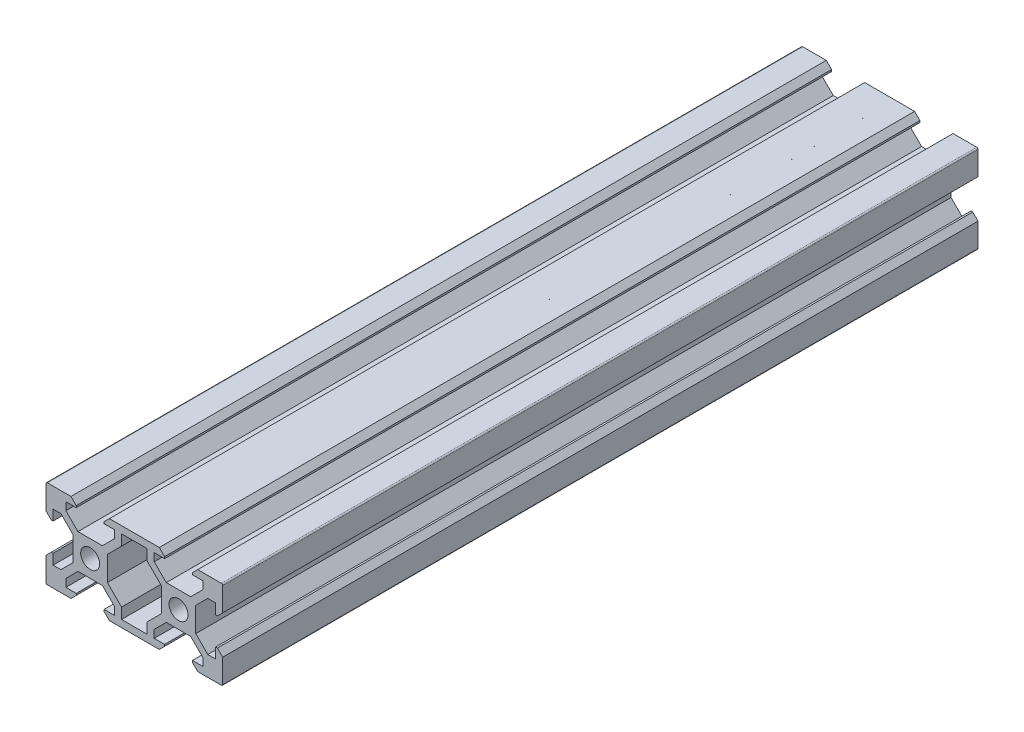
ISO-10303-21;
HEADER;
FILE_DESCRIPTION(('STEP AP214'),'2;1');
FILE_NAME('part.step','',(''),(''),'','','');
FILE_SCHEMA(('AUTOMOTIVE_DESIGN { 1 0 10303 214 1 1 1 1 }'));
ENDSEC;
DATA;
#1=APPLICATION_CONTEXT('core data for automotive mechanical design processes');
#2=APPLICATION_PROTOCOL_DEFINITION('international standard','automotive_design',2000,#1);
#3=PRODUCT_CONTEXT('',#1,'mechanical');
#4=PRODUCT('Part','Part','',(#3));
#5=PRODUCT_RELATED_PRODUCT_CATEGORY('part','',(#4));
#6=PRODUCT_DEFINITION_FORMATION('','',#4);
#7=PRODUCT_DEFINITION_CONTEXT('part definition',#1,'design');
#8=PRODUCT_DEFINITION('design','',#6,#7);
#9=PRODUCT_DEFINITION_SHAPE('','',#8);
#10=(LENGTH_UNIT() NAMED_UNIT(*) SI_UNIT(.MILLI.,.METRE.));
#11=(NAMED_UNIT(*) PLANE_ANGLE_UNIT() SI_UNIT($,.RADIAN.));
#12=(NAMED_UNIT(*) SI_UNIT($,.STERADIAN.) SOLID_ANGLE_UNIT());
#13=UNCERTAINTY_MEASURE_WITH_UNIT(LENGTH_MEASURE(1.E-05),#10,'distance_accuracy_value','');
#14=(GEOMETRIC_REPRESENTATION_CONTEXT(3) GLOBAL_UNCERTAINTY_ASSIGNED_CONTEXT((#13)) GLOBAL_UNIT_ASSIGNED_CONTEXT((#10,
#11,#12)) REPRESENTATION_CONTEXT('',''));
#15=CARTESIAN_POINT('',(0.,0.,0.));
#16=DIRECTION('',(0.,0.,1.));
#17=DIRECTION('',(1.,0.,0.));
#18=AXIS2_PLACEMENT_3D('',#15,#16,#17);
#19=CARTESIAN_POINT('',(155.860849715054,174.589777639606,41.));
#20=DIRECTION('',(0.,0.,1.));
#21=DIRECTION('',(1.,0.,0.));
#22=AXIS2_PLACEMENT_3D('',#19,#20,#21);
#23=PLANE('',#22);
#24=CARTESIAN_POINT('',(146.160849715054,184.289777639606,41.));
#25=DIRECTION('',(0.,0.,1.));
#26=DIRECTION('',(1.,0.,0.));
#27=AXIS2_PLACEMENT_3D('',#24,#25,#26);
#28=CIRCLE('',#27,2.15000000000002);
#29=CARTESIAN_POINT('',(148.310849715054,184.289777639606,41.));
#30=VERTEX_POINT('',#29);
#31=EDGE_CURVE('E2918',#30,#30,#28,.T.);
#32=ORIENTED_EDGE('',*,*,#31,.F.);
#33=EDGE_LOOP('',(#32));
#34=FACE_BOUND('',#33,.T.);
#35=DIRECTION('',(0.,-1.,0.));
#36=VECTOR('',#35,1.);
#37=CARTESIAN_POINT('',(129.310849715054,175.889777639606,41.));
#38=LINE('',#37,#36);
#39=CARTESIAN_POINT('',(129.310849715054,175.889777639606,41.));
#40=VERTEX_POINT('',#39);
#41=CARTESIAN_POINT('',(129.310849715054,175.489777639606,41.));
#42=VERTEX_POINT('',#41);
#43=EDGE_CURVE('E2963',#40,#42,#38,.T.);
#44=ORIENTED_EDGE('',*,*,#43,.T.);
#45=DIRECTION('',(0.707106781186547,-0.707106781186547,0.));
#46=VECTOR('',#45,1.);
#47=CARTESIAN_POINT('',(129.310849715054,175.489777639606,41.));
#48=LINE('',#47,#46);
#49=CARTESIAN_POINT('',(130.510849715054,174.289777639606,41.));
#50=VERTEX_POINT('',#49);
#51=EDGE_CURVE('E2965',#42,#50,#48,.T.);
#52=ORIENTED_EDGE('',*,*,#51,.T.);
#53=DIRECTION('',(1.,0.,0.));
#54=VECTOR('',#53,1.);
#55=CARTESIAN_POINT('',(130.510849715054,174.289777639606,41.));
#56=LINE('',#55,#54);
#57=CARTESIAN_POINT('',(141.810849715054,174.289777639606,41.));
#58=VERTEX_POINT('',#57);
#59=EDGE_CURVE('E2967',#50,#58,#56,.T.);
#60=ORIENTED_EDGE('',*,*,#59,.T.);
#61=DIRECTION('',(0.707106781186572,0.707106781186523,0.));
#62=VECTOR('',#61,1.);
#63=CARTESIAN_POINT('',(141.810849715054,174.289777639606,41.));
#64=LINE('',#63,#62);
#65=CARTESIAN_POINT('',(143.010849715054,175.489777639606,41.));
#66=VERTEX_POINT('',#65);
#67=EDGE_CURVE('E2969',#58,#66,#64,.T.);
#68=ORIENTED_EDGE('',*,*,#67,.T.);
#69=DIRECTION('',(0.,1.,0.));
#70=VECTOR('',#69,1.);
#71=CARTESIAN_POINT('',(143.010849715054,175.489777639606,41.));
#72=LINE('',#71,#70);
#73=CARTESIAN_POINT('',(143.010849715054,175.889777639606,41.));
#74=VERTEX_POINT('',#73);
#75=EDGE_CURVE('E2971',#66,#74,#72,.T.);
#76=ORIENTED_EDGE('',*,*,#75,.T.);
#77=DIRECTION('',(-1.,0.,0.));
#78=VECTOR('',#77,1.);
#79=CARTESIAN_POINT('',(143.010849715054,175.889777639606,41.));
#80=LINE('',#79,#78);
#81=CARTESIAN_POINT('',(140.660849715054,175.889777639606,41.));
#82=VERTEX_POINT('',#81);
#83=EDGE_CURVE('E2973',#74,#82,#80,.T.);
#84=ORIENTED_EDGE('',*,*,#83,.T.);
#85=DIRECTION('',(0.,1.,0.));
#86=VECTOR('',#85,1.);
#87=CARTESIAN_POINT('',(140.660849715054,175.889777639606,41.));
#88=LINE('',#87,#86);
#89=CARTESIAN_POINT('',(140.660849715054,177.657206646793,41.));
#90=VERTEX_POINT('',#89);
#91=EDGE_CURVE('E2975',#82,#90,#88,.T.);
#92=ORIENTED_EDGE('',*,*,#91,.T.);
#93=DIRECTION('',(0.707106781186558,0.707106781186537,0.));
#94=VECTOR('',#93,1.);
#95=CARTESIAN_POINT('',(140.660849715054,177.657206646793,41.));
#96=LINE('',#95,#94);
#97=CARTESIAN_POINT('',(143.393420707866,180.389777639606,41.));
#98=VERTEX_POINT('',#97);
#99=EDGE_CURVE('E2977',#90,#98,#96,.T.);
#100=ORIENTED_EDGE('',*,*,#99,.T.);
#101=DIRECTION('',(1.,0.,0.));
#102=VECTOR('',#101,1.);
#103=CARTESIAN_POINT('',(143.393420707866,180.389777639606,41.));
#104=LINE('',#103,#102);
#105=CARTESIAN_POINT('',(148.928278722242,180.389777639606,41.));
#106=VERTEX_POINT('',#105);
#107=EDGE_CURVE('E2979',#98,#106,#104,.T.);
#108=ORIENTED_EDGE('',*,*,#107,.T.);
#109=DIRECTION('',(0.707106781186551,-0.707106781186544,0.));
#110=VECTOR('',#109,1.);
#111=CARTESIAN_POINT('',(148.928278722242,180.389777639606,41.));
#112=LINE('',#111,#110);
#113=CARTESIAN_POINT('',(151.660849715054,177.657206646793,41.));
#114=VERTEX_POINT('',#113);
#115=EDGE_CURVE('E2981',#106,#114,#112,.T.);
#116=ORIENTED_EDGE('',*,*,#115,.T.);
#117=DIRECTION('',(0.,-1.,0.));
#118=VECTOR('',#117,1.);
#119=CARTESIAN_POINT('',(151.660849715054,177.657206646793,41.));
#120=LINE('',#119,#118);
#121=CARTESIAN_POINT('',(151.660849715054,175.889777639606,41.));
#122=VERTEX_POINT('',#121);
#123=EDGE_CURVE('E2983',#114,#122,#120,.T.);
#124=ORIENTED_EDGE('',*,*,#123,.T.);
#125=DIRECTION('',(-1.,0.,0.));
#126=VECTOR('',#125,1.);
#127=CARTESIAN_POINT('',(151.660849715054,175.889777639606,41.));
#128=LINE('',#127,#126);
#129=CARTESIAN_POINT('',(149.310849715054,175.889777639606,41.));
#130=VERTEX_POINT('',#129);
#131=EDGE_CURVE('E2985',#122,#130,#128,.T.);
#132=ORIENTED_EDGE('',*,*,#131,.T.);
#133=DIRECTION('',(0.,-1.,0.));
#134=VECTOR('',#133,1.);
#135=CARTESIAN_POINT('',(149.310849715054,175.889777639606,41.));
#136=LINE('',#135,#134);
#137=CARTESIAN_POINT('',(149.310849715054,175.489777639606,41.));
#138=VERTEX_POINT('',#137);
#139=EDGE_CURVE('E2987',#130,#138,#136,.T.);
#140=ORIENTED_EDGE('',*,*,#139,.T.);
#141=DIRECTION('',(0.707106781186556,-0.707106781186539,0.));
#142=VECTOR('',#141,1.);
#143=CARTESIAN_POINT('',(149.310849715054,175.489777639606,41.));
#144=LINE('',#143,#142);
#145=CARTESIAN_POINT('',(150.510849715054,174.289777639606,41.));
#146=VERTEX_POINT('',#145);
#147=EDGE_CURVE('E2989',#138,#146,#144,.T.);
#148=ORIENTED_EDGE('',*,*,#147,.T.);
#149=DIRECTION('',(1.,0.,0.));
#150=VECTOR('',#149,1.);
#151=CARTESIAN_POINT('',(150.510849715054,174.289777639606,41.));
#152=LINE('',#151,#150);
#153=CARTESIAN_POINT('',(155.860849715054,174.289777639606,41.));
#154=VERTEX_POINT('',#153);
#155=EDGE_CURVE('E2991',#146,#154,#152,.T.);
#156=ORIENTED_EDGE('',*,*,#155,.T.);
#157=CARTESIAN_POINT('',(155.860849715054,174.589777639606,41.));
#158=DIRECTION('',(0.,0.,1.));
#159=DIRECTION('',(1.,0.,0.));
#160=AXIS2_PLACEMENT_3D('',#157,#158,#159);
#161=CIRCLE('',#160,0.299999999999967);
#162=CARTESIAN_POINT('',(156.160849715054,174.589777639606,41.));
#163=VERTEX_POINT('',#162);
#164=EDGE_CURVE('E2993',#154,#163,#161,.T.);
#165=ORIENTED_EDGE('',*,*,#164,.T.);
#166=DIRECTION('',(0.,1.,0.));
#167=VECTOR('',#166,1.);
#168=CARTESIAN_POINT('',(156.160849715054,174.589777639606,41.));
#169=LINE('',#168,#167);
#170=CARTESIAN_POINT('',(156.160849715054,179.939777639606,41.));
#171=VERTEX_POINT('',#170);
#172=EDGE_CURVE('E2995',#163,#171,#169,.T.);
#173=ORIENTED_EDGE('',*,*,#172,.T.);
#174=DIRECTION('',(-0.707106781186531,0.707106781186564,0.));
#175=VECTOR('',#174,1.);
#176=CARTESIAN_POINT('',(156.160849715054,179.939777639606,41.));
#177=LINE('',#176,#175);
#178=CARTESIAN_POINT('',(154.960849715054,181.139777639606,41.));
#179=VERTEX_POINT('',#178);
#180=EDGE_CURVE('E2997',#171,#179,#177,.T.);
#181=ORIENTED_EDGE('',*,*,#180,.T.);
#182=DIRECTION('',(-1.,0.,0.));
#183=VECTOR('',#182,1.);
#184=CARTESIAN_POINT('',(154.960849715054,181.139777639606,41.));
#185=LINE('',#184,#183);
#186=CARTESIAN_POINT('',(154.560849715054,181.139777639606,41.));
#187=VERTEX_POINT('',#186);
#188=EDGE_CURVE('E2999',#179,#187,#185,.T.);
#189=ORIENTED_EDGE('',*,*,#188,.T.);
#190=DIRECTION('',(0.,-1.,0.));
#191=VECTOR('',#190,1.);
#192=CARTESIAN_POINT('',(154.560849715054,181.139777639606,41.));
#193=LINE('',#192,#191);
#194=CARTESIAN_POINT('',(154.560849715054,178.789777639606,41.));
#195=VERTEX_POINT('',#194);
#196=EDGE_CURVE('E3001',#187,#195,#193,.T.);
#197=ORIENTED_EDGE('',*,*,#196,.T.);
#198=DIRECTION('',(-1.,0.,0.));
#199=VECTOR('',#198,1.);
#200=CARTESIAN_POINT('',(154.560849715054,178.789777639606,41.));
#201=LINE('',#200,#199);
#202=CARTESIAN_POINT('',(152.793249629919,178.789777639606,41.));
#203=VERTEX_POINT('',#202);
#204=EDGE_CURVE('E3003',#195,#203,#201,.T.);
#205=ORIENTED_EDGE('',*,*,#204,.T.);
#206=DIRECTION('',(-0.707190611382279,0.707022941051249,0.));
#207=VECTOR('',#206,1.);
#208=CARTESIAN_POINT('',(152.793249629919,178.789777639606,41.));
#209=LINE('',#208,#207);
#210=CARTESIAN_POINT('',(150.05964957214,181.522729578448,41.));
#211=VERTEX_POINT('',#210);
#212=EDGE_CURVE('E3005',#203,#211,#209,.T.);
#213=ORIENTED_EDGE('',*,*,#212,.T.);
#214=DIRECTION('',(0.,1.,0.));
#215=VECTOR('',#214,1.);
#216=CARTESIAN_POINT('',(150.05964957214,181.522729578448,41.));
#217=LINE('',#216,#215);
#218=CARTESIAN_POINT('',(150.05964957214,187.056006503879,41.));
#219=VERTEX_POINT('',#218);
#220=EDGE_CURVE('E3007',#211,#219,#217,.T.);
#221=ORIENTED_EDGE('',*,*,#220,.T.);
#222=DIRECTION('',(0.707106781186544,0.707106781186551,0.));
#223=VECTOR('',#222,1.);
#224=CARTESIAN_POINT('',(150.05964957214,187.056006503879,41.));
#225=LINE('',#224,#223);
#226=CARTESIAN_POINT('',(152.793420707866,189.789777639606,41.));
#227=VERTEX_POINT('',#226);
#228=EDGE_CURVE('E3009',#219,#227,#225,.T.);
#229=ORIENTED_EDGE('',*,*,#228,.T.);
#230=DIRECTION('',(1.,0.,0.));
#231=VECTOR('',#230,1.);
#232=CARTESIAN_POINT('',(152.793420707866,189.789777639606,41.));
#233=LINE('',#232,#231);
#234=CARTESIAN_POINT('',(154.560849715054,189.789777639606,41.));
#235=VERTEX_POINT('',#234);
#236=EDGE_CURVE('E3011',#227,#235,#233,.T.);
#237=ORIENTED_EDGE('',*,*,#236,.T.);
#238=DIRECTION('',(0.,-1.,0.));
#239=VECTOR('',#238,1.);
#240=CARTESIAN_POINT('',(154.560849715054,189.789777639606,41.));
#241=LINE('',#240,#239);
#242=CARTESIAN_POINT('',(154.560849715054,187.439777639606,41.));
#243=VERTEX_POINT('',#242);
#244=EDGE_CURVE('E3013',#235,#243,#241,.T.);
#245=ORIENTED_EDGE('',*,*,#244,.T.);
#246=DIRECTION('',(1.,0.,0.));
#247=VECTOR('',#246,1.);
#248=CARTESIAN_POINT('',(154.560849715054,187.439777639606,41.));
#249=LINE('',#248,#247);
#250=CARTESIAN_POINT('',(154.960849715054,187.439777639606,41.));
#251=VERTEX_POINT('',#250);
#252=EDGE_CURVE('E3015',#243,#251,#249,.T.);
#253=ORIENTED_EDGE('',*,*,#252,.T.);
#254=DIRECTION('',(0.707106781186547,0.707106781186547,0.));
#255=VECTOR('',#254,1.);
#256=CARTESIAN_POINT('',(154.960849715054,187.439777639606,41.));
#257=LINE('',#256,#255);
#258=CARTESIAN_POINT('',(156.160849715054,188.639777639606,41.));
#259=VERTEX_POINT('',#258);
#260=EDGE_CURVE('E3017',#251,#259,#257,.T.);
#261=ORIENTED_EDGE('',*,*,#260,.T.);
#262=DIRECTION('',(0.,1.,0.));
#263=VECTOR('',#262,1.);
#264=CARTESIAN_POINT('',(156.160849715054,188.639777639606,41.));
#265=LINE('',#264,#263);
#266=CARTESIAN_POINT('',(156.160849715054,193.989777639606,41.));
#267=VERTEX_POINT('',#266);
#268=EDGE_CURVE('E3019',#259,#267,#265,.T.);
#269=ORIENTED_EDGE('',*,*,#268,.T.);
#270=CARTESIAN_POINT('',(155.860849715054,193.989777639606,41.));
#271=DIRECTION('',(0.,0.,1.));
#272=DIRECTION('',(1.,0.,0.));
#273=AXIS2_PLACEMENT_3D('',#270,#271,#272);
#274=CIRCLE('',#273,0.299999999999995);
#275=CARTESIAN_POINT('',(155.860849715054,194.289777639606,41.));
#276=VERTEX_POINT('',#275);
#277=EDGE_CURVE('E3021',#267,#276,#274,.T.);
#278=ORIENTED_EDGE('',*,*,#277,.T.);
#279=DIRECTION('',(-1.,0.,0.));
#280=VECTOR('',#279,1.);
#281=CARTESIAN_POINT('',(155.860849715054,194.289777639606,41.));
#282=LINE('',#281,#280);
#283=CARTESIAN_POINT('',(150.510849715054,194.289777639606,41.));
#284=VERTEX_POINT('',#283);
#285=EDGE_CURVE('E3023',#276,#284,#282,.T.);
#286=ORIENTED_EDGE('',*,*,#285,.T.);
#287=DIRECTION('',(-0.707106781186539,-0.707106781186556,0.));
#288=VECTOR('',#287,1.);
#289=CARTESIAN_POINT('',(150.510849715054,194.289777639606,41.));
#290=LINE('',#289,#288);
#291=CARTESIAN_POINT('',(149.310849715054,193.089777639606,41.));
#292=VERTEX_POINT('',#291);
#293=EDGE_CURVE('E3025',#284,#292,#290,.T.);
#294=ORIENTED_EDGE('',*,*,#293,.T.);
#295=DIRECTION('',(0.,-1.,0.));
#296=VECTOR('',#295,1.);
#297=CARTESIAN_POINT('',(149.310849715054,193.089777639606,41.));
#298=LINE('',#297,#296);
#299=CARTESIAN_POINT('',(149.310849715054,192.689777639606,41.));
#300=VERTEX_POINT('',#299);
#301=EDGE_CURVE('E3027',#292,#300,#298,.T.);
#302=ORIENTED_EDGE('',*,*,#301,.T.);
#303=DIRECTION('',(1.,0.,0.));
#304=VECTOR('',#303,1.);
#305=CARTESIAN_POINT('',(149.310849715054,192.689777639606,41.));
#306=LINE('',#305,#304);
#307=CARTESIAN_POINT('',(151.660849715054,192.689777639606,41.));
#308=VERTEX_POINT('',#307);
#309=EDGE_CURVE('E3029',#300,#308,#306,.T.);
#310=ORIENTED_EDGE('',*,*,#309,.T.);
#311=DIRECTION('',(0.,-1.,0.));
#312=VECTOR('',#311,1.);
#313=CARTESIAN_POINT('',(151.660849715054,192.689777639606,41.));
#314=LINE('',#313,#312);
#315=CARTESIAN_POINT('',(151.660849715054,190.928228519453,41.));
#316=VERTEX_POINT('',#315);
#317=EDGE_CURVE('E3031',#308,#316,#314,.T.);
#318=ORIENTED_EDGE('',*,*,#317,.T.);
#319=DIRECTION('',(-0.706885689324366,-0.707327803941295,0.));
#320=VECTOR('',#319,1.);
#321=CARTESIAN_POINT('',(151.660849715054,190.928228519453,41.));
#322=LINE('',#321,#320);
#323=CARTESIAN_POINT('',(148.924110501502,188.189777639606,41.));
#324=VERTEX_POINT('',#323);
#325=EDGE_CURVE('E3033',#316,#324,#322,.T.);
#326=ORIENTED_EDGE('',*,*,#325,.T.);
#327=DIRECTION('',(-1.,0.,0.));
#328=VECTOR('',#327,1.);
#329=CARTESIAN_POINT('',(148.924110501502,188.189777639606,41.));
#330=LINE('',#329,#328);
#331=CARTESIAN_POINT('',(143.391020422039,188.189777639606,41.));
#332=VERTEX_POINT('',#331);
#333=EDGE_CURVE('E3035',#324,#332,#330,.T.);
#334=ORIENTED_EDGE('',*,*,#333,.T.);
#335=DIRECTION('',(-0.707190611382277,0.707022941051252,0.));
#336=VECTOR('',#335,1.);
#337=CARTESIAN_POINT('',(143.391020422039,188.189777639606,41.));
#338=LINE('',#337,#336);
#339=CARTESIAN_POINT('',(140.660849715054,190.919301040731,41.));
#340=VERTEX_POINT('',#339);
#341=EDGE_CURVE('E3037',#332,#340,#338,.T.);
#342=ORIENTED_EDGE('',*,*,#341,.T.);
#343=DIRECTION('',(0.,1.,0.));
#344=VECTOR('',#343,1.);
#345=CARTESIAN_POINT('',(140.660849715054,190.919301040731,41.));
#346=LINE('',#345,#344);
#347=CARTESIAN_POINT('',(140.660849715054,192.689777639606,41.));
#348=VERTEX_POINT('',#347);
#349=EDGE_CURVE('E3039',#340,#348,#346,.T.);
#350=ORIENTED_EDGE('',*,*,#349,.T.);
#351=DIRECTION('',(1.,0.,0.));
#352=VECTOR('',#351,1.);
#353=CARTESIAN_POINT('',(140.660849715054,192.689777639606,41.));
#354=LINE('',#353,#352);
#355=CARTESIAN_POINT('',(143.010849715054,192.689777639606,41.));
#356=VERTEX_POINT('',#355);
#357=EDGE_CURVE('E3041',#348,#356,#354,.T.);
#358=ORIENTED_EDGE('',*,*,#357,.T.);
#359=DIRECTION('',(0.,1.,0.));
#360=VECTOR('',#359,1.);
#361=CARTESIAN_POINT('',(143.010849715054,192.689777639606,41.));
#362=LINE('',#361,#360);
#363=CARTESIAN_POINT('',(143.010849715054,193.089777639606,41.));
#364=VERTEX_POINT('',#363);
#365=EDGE_CURVE('E3043',#356,#364,#362,.T.);
#366=ORIENTED_EDGE('',*,*,#365,.T.);
#367=DIRECTION('',(-0.707106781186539,0.707106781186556,0.));
#368=VECTOR('',#367,1.);
#369=CARTESIAN_POINT('',(143.010849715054,193.089777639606,41.));
#370=LINE('',#369,#368);
#371=CARTESIAN_POINT('',(141.810849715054,194.289777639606,41.));
#372=VERTEX_POINT('',#371);
#373=EDGE_CURVE('E3045',#364,#372,#370,.T.);
#374=ORIENTED_EDGE('',*,*,#373,.T.);
#375=DIRECTION('',(-1.,0.,0.));
#376=VECTOR('',#375,1.);
#377=CARTESIAN_POINT('',(141.810849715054,194.289777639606,41.));
#378=LINE('',#377,#376);
#379=CARTESIAN_POINT('',(130.510849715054,194.289777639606,41.));
#380=VERTEX_POINT('',#379);
#381=EDGE_CURVE('E3047',#372,#380,#378,.T.);
#382=ORIENTED_EDGE('',*,*,#381,.T.);
#383=DIRECTION('',(-0.707106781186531,-0.707106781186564,0.));
#384=VECTOR('',#383,1.);
#385=CARTESIAN_POINT('',(130.510849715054,194.289777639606,41.));
#386=LINE('',#385,#384);
#387=CARTESIAN_POINT('',(129.310849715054,193.089777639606,41.));
#388=VERTEX_POINT('',#387);
#389=EDGE_CURVE('E3049',#380,#388,#386,.T.);
#390=ORIENTED_EDGE('',*,*,#389,.T.);
#391=DIRECTION('',(0.,-1.,0.));
#392=VECTOR('',#391,1.);
#393=CARTESIAN_POINT('',(129.310849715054,193.089777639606,41.));
#394=LINE('',#393,#392);
#395=CARTESIAN_POINT('',(129.310849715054,192.689777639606,41.));
#396=VERTEX_POINT('',#395);
#397=EDGE_CURVE('E3051',#388,#396,#394,.T.);
#398=ORIENTED_EDGE('',*,*,#397,.T.);
#399=DIRECTION('',(1.,0.,0.));
#400=VECTOR('',#399,1.);
#401=CARTESIAN_POINT('',(129.310849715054,192.689777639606,41.));
#402=LINE('',#401,#400);
#403=CARTESIAN_POINT('',(131.660849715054,192.689777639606,41.));
#404=VERTEX_POINT('',#403);
#405=EDGE_CURVE('E3053',#396,#404,#402,.T.);
#406=ORIENTED_EDGE('',*,*,#405,.T.);
#407=DIRECTION('',(0.,-1.,0.));
#408=VECTOR('',#407,1.);
#409=CARTESIAN_POINT('',(131.660849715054,192.689777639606,41.));
#410=LINE('',#409,#408);
#411=CARTESIAN_POINT('',(131.660849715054,190.922348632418,41.));
#412=VERTEX_POINT('',#411);
#413=EDGE_CURVE('E3055',#404,#412,#410,.T.);
#414=ORIENTED_EDGE('',*,*,#413,.T.);
#415=DIRECTION('',(-0.707106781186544,-0.707106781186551,0.));
#416=VECTOR('',#415,1.);
#417=CARTESIAN_POINT('',(131.660849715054,190.922348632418,41.));
#418=LINE('',#417,#416);
#419=CARTESIAN_POINT('',(128.928461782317,188.189960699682,41.));
#420=VERTEX_POINT('',#419);
#421=EDGE_CURVE('E3057',#412,#420,#418,.T.);
#422=ORIENTED_EDGE('',*,*,#421,.T.);
#423=DIRECTION('',(-1.,0.,0.));
#424=VECTOR('',#423,1.);
#425=CARTESIAN_POINT('',(128.928461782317,188.189960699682,41.));
#426=LINE('',#425,#424);
#427=CARTESIAN_POINT('',(123.393237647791,188.189960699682,41.));
#428=VERTEX_POINT('',#427);
#429=EDGE_CURVE('E3059',#420,#428,#426,.T.);
#430=ORIENTED_EDGE('',*,*,#429,.T.);
#431=DIRECTION('',(-0.707106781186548,0.707106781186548,0.));
#432=VECTOR('',#431,1.);
#433=CARTESIAN_POINT('',(123.393237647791,188.189960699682,41.));
#434=LINE('',#433,#432);
#435=CARTESIAN_POINT('',(120.660849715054,190.922348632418,41.));
#436=VERTEX_POINT('',#435);
#437=EDGE_CURVE('E3061',#428,#436,#434,.T.);
#438=ORIENTED_EDGE('',*,*,#437,.T.);
#439=DIRECTION('',(0.,1.,0.));
#440=VECTOR('',#439,1.);
#441=CARTESIAN_POINT('',(120.660849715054,190.922348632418,41.));
#442=LINE('',#441,#440);
#443=CARTESIAN_POINT('',(120.660849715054,192.689777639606,41.));
#444=VERTEX_POINT('',#443);
#445=EDGE_CURVE('E3063',#436,#444,#442,.T.);
#446=ORIENTED_EDGE('',*,*,#445,.T.);
#447=DIRECTION('',(1.,0.,0.));
#448=VECTOR('',#447,1.);
#449=CARTESIAN_POINT('',(120.660849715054,192.689777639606,41.));
#450=LINE('',#449,#448);
#451=CARTESIAN_POINT('',(123.010849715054,192.689777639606,41.));
#452=VERTEX_POINT('',#451);
#453=EDGE_CURVE('E3065',#444,#452,#450,.T.);
#454=ORIENTED_EDGE('',*,*,#453,.T.);
#455=DIRECTION('',(0.,1.,0.));
#456=VECTOR('',#455,1.);
#457=CARTESIAN_POINT('',(123.010849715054,192.689777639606,41.));
#458=LINE('',#457,#456);
#459=CARTESIAN_POINT('',(123.010849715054,193.089777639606,41.));
#460=VERTEX_POINT('',#459);
#461=EDGE_CURVE('E3067',#452,#460,#458,.T.);
#462=ORIENTED_EDGE('',*,*,#461,.T.);
#463=DIRECTION('',(-0.707106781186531,0.707106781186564,0.));
#464=VECTOR('',#463,1.);
#465=CARTESIAN_POINT('',(123.010849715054,193.089777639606,41.));
#466=LINE('',#465,#464);
#467=CARTESIAN_POINT('',(121.810849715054,194.289777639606,41.));
#468=VERTEX_POINT('',#467);
#469=EDGE_CURVE('E3069',#460,#468,#466,.T.);
#470=ORIENTED_EDGE('',*,*,#469,.T.);
#471=DIRECTION('',(-1.,0.,0.));
#472=VECTOR('',#471,1.);
#473=CARTESIAN_POINT('',(121.810849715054,194.289777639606,41.));
#474=LINE('',#473,#472);
#475=CARTESIAN_POINT('',(116.462049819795,194.289777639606,41.));
#476=VERTEX_POINT('',#475);
#477=EDGE_CURVE('E3071',#468,#476,#474,.T.);
#478=ORIENTED_EDGE('',*,*,#477,.T.);
#479=CARTESIAN_POINT('',(116.462049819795,193.989777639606,41.));
#480=DIRECTION('',(0.,0.,1.));
#481=DIRECTION('',(1.,0.,0.));
#482=AXIS2_PLACEMENT_3D('',#479,#480,#481);
#483=CIRCLE('',#482,0.300000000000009);
#484=CARTESIAN_POINT('',(116.162049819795,193.989777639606,41.));
#485=VERTEX_POINT('',#484);
#486=EDGE_CURVE('E3073',#476,#485,#483,.T.);
#487=ORIENTED_EDGE('',*,*,#486,.T.);
#488=DIRECTION('',(0.,-1.,0.));
#489=VECTOR('',#488,1.);
#490=CARTESIAN_POINT('',(116.162049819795,193.989777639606,41.));
#491=LINE('',#490,#489);
#492=CARTESIAN_POINT('',(116.162049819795,188.639777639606,41.));
#493=VERTEX_POINT('',#492);
#494=EDGE_CURVE('E3075',#485,#493,#491,.T.);
#495=ORIENTED_EDGE('',*,*,#494,.T.);
#496=DIRECTION('',(0.707106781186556,-0.707106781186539,0.));
#497=VECTOR('',#496,1.);
#498=CARTESIAN_POINT('',(116.162049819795,188.639777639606,41.));
#499=LINE('',#498,#497);
#500=CARTESIAN_POINT('',(117.362049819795,187.439777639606,41.));
#501=VERTEX_POINT('',#500);
#502=EDGE_CURVE('E3077',#493,#501,#499,.T.);
#503=ORIENTED_EDGE('',*,*,#502,.T.);
#504=DIRECTION('',(1.,0.,0.));
#505=VECTOR('',#504,1.);
#506=CARTESIAN_POINT('',(117.362049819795,187.439777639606,41.));
#507=LINE('',#506,#505);
#508=CARTESIAN_POINT('',(117.762049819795,187.439777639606,41.));
#509=VERTEX_POINT('',#508);
#510=EDGE_CURVE('E3079',#501,#509,#507,.T.);
#511=ORIENTED_EDGE('',*,*,#510,.T.);
#512=DIRECTION('',(0.,1.,0.));
#513=VECTOR('',#512,1.);
#514=CARTESIAN_POINT('',(117.762049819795,187.439777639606,41.));
#515=LINE('',#514,#513);
#516=CARTESIAN_POINT('',(117.762049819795,189.789777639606,41.));
#517=VERTEX_POINT('',#516);
#518=EDGE_CURVE('E3081',#509,#517,#515,.T.);
#519=ORIENTED_EDGE('',*,*,#518,.T.);
#520=DIRECTION('',(1.,0.,0.));
#521=VECTOR('',#520,1.);
#522=CARTESIAN_POINT('',(117.762049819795,189.789777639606,41.));
#523=LINE('',#522,#521);
#524=CARTESIAN_POINT('',(119.531155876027,189.789777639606,41.));
#525=VERTEX_POINT('',#524);
#526=EDGE_CURVE('E3083',#517,#525,#523,.T.);
#527=ORIENTED_EDGE('',*,*,#526,.T.);
#528=DIRECTION('',(0.707144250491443,-0.707069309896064,0.));
#529=VECTOR('',#528,1.);
#530=CARTESIAN_POINT('',(119.531155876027,189.789777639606,41.));
#531=LINE('',#530,#529);
#532=CARTESIAN_POINT('',(122.260849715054,187.06037308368,41.));
#533=VERTEX_POINT('',#532);
#534=EDGE_CURVE('E3085',#525,#533,#531,.T.);
#535=ORIENTED_EDGE('',*,*,#534,.T.);
#536=DIRECTION('',(0.,-1.,0.));
#537=VECTOR('',#536,1.);
#538=CARTESIAN_POINT('',(122.260849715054,187.06037308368,41.));
#539=LINE('',#538,#537);
#540=CARTESIAN_POINT('',(122.260849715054,181.522348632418,41.));
#541=VERTEX_POINT('',#540);
#542=EDGE_CURVE('E3087',#533,#541,#539,.T.);
#543=ORIENTED_EDGE('',*,*,#542,.T.);
#544=DIRECTION('',(-0.707106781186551,-0.707106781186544,0.));
#545=VECTOR('',#544,1.);
#546=CARTESIAN_POINT('',(122.260849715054,181.522348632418,41.));
#547=LINE('',#546,#545);
#548=CARTESIAN_POINT('',(119.528278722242,178.789777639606,41.));
#549=VERTEX_POINT('',#548);
#550=EDGE_CURVE('E3089',#541,#549,#547,.T.);
#551=ORIENTED_EDGE('',*,*,#550,.T.);
#552=DIRECTION('',(-1.,0.,0.));
#553=VECTOR('',#552,1.);
#554=CARTESIAN_POINT('',(119.528278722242,178.789777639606,41.));
#555=LINE('',#554,#553);
#556=CARTESIAN_POINT('',(117.762049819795,178.789777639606,41.));
#557=VERTEX_POINT('',#556);
#558=EDGE_CURVE('E3091',#549,#557,#555,.T.);
#559=ORIENTED_EDGE('',*,*,#558,.T.);
#560=DIRECTION('',(0.,1.,0.));
#561=VECTOR('',#560,1.);
#562=CARTESIAN_POINT('',(117.762049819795,178.789777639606,41.));
#563=LINE('',#562,#561);
#564=CARTESIAN_POINT('',(117.762049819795,181.139777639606,41.));
#565=VERTEX_POINT('',#564);
#566=EDGE_CURVE('E3093',#557,#565,#563,.T.);
#567=ORIENTED_EDGE('',*,*,#566,.T.);
#568=DIRECTION('',(-1.,0.,0.));
#569=VECTOR('',#568,1.);
#570=CARTESIAN_POINT('',(117.762049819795,181.139777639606,41.));
#571=LINE('',#570,#569);
#572=CARTESIAN_POINT('',(117.362049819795,181.139777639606,41.));
#573=VERTEX_POINT('',#572);
#574=EDGE_CURVE('E3095',#565,#573,#571,.T.);
#575=ORIENTED_EDGE('',*,*,#574,.T.);
#576=DIRECTION('',(-0.707106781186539,-0.707106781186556,0.));
#577=VECTOR('',#576,1.);
#578=CARTESIAN_POINT('',(117.362049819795,181.139777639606,41.));
#579=LINE('',#578,#577);
#580=CARTESIAN_POINT('',(116.162049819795,179.939777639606,41.));
#581=VERTEX_POINT('',#580);
#582=EDGE_CURVE('E3097',#573,#581,#579,.T.);
#583=ORIENTED_EDGE('',*,*,#582,.T.);
#584=DIRECTION('',(0.,-1.,0.));
#585=VECTOR('',#584,1.);
#586=CARTESIAN_POINT('',(116.162049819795,179.939777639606,41.));
#587=LINE('',#586,#585);
#588=CARTESIAN_POINT('',(116.162049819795,174.589777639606,41.));
#589=VERTEX_POINT('',#588);
#590=EDGE_CURVE('E3099',#581,#589,#587,.T.);
#591=ORIENTED_EDGE('',*,*,#590,.T.);
#592=CARTESIAN_POINT('',(116.462049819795,174.589777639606,41.));
#593=DIRECTION('',(0.,0.,1.));
#594=DIRECTION('',(1.,0.,0.));
#595=AXIS2_PLACEMENT_3D('',#592,#593,#594);
#596=CIRCLE('',#595,0.300000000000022);
#597=CARTESIAN_POINT('',(116.462049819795,174.289777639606,41.));
#598=VERTEX_POINT('',#597);
#599=EDGE_CURVE('E3101',#589,#598,#596,.T.);
#600=ORIENTED_EDGE('',*,*,#599,.T.);
#601=DIRECTION('',(1.,0.,0.));
#602=VECTOR('',#601,1.);
#603=CARTESIAN_POINT('',(116.462049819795,174.289777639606,41.));
#604=LINE('',#603,#602);
#605=CARTESIAN_POINT('',(121.810849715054,174.289777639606,41.));
#606=VERTEX_POINT('',#605);
#607=EDGE_CURVE('E3103',#598,#606,#604,.T.);
#608=ORIENTED_EDGE('',*,*,#607,.T.);
#609=DIRECTION('',(0.707106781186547,0.707106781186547,0.));
#610=VECTOR('',#609,1.);
#611=CARTESIAN_POINT('',(121.810849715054,174.289777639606,41.));
#612=LINE('',#611,#610);
#613=CARTESIAN_POINT('',(123.010849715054,175.489777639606,41.));
#614=VERTEX_POINT('',#613);
#615=EDGE_CURVE('E3105',#606,#614,#612,.T.);
#616=ORIENTED_EDGE('',*,*,#615,.T.);
#617=DIRECTION('',(0.,1.,0.));
#618=VECTOR('',#617,1.);
#619=CARTESIAN_POINT('',(123.010849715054,175.489777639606,41.));
#620=LINE('',#619,#618);
#621=CARTESIAN_POINT('',(123.010849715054,175.889777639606,41.));
#622=VERTEX_POINT('',#621);
#623=EDGE_CURVE('E3107',#614,#622,#620,.T.);
#624=ORIENTED_EDGE('',*,*,#623,.T.);
#625=DIRECTION('',(-1.,0.,0.));
#626=VECTOR('',#625,1.);
#627=CARTESIAN_POINT('',(123.010849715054,175.889777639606,41.));
#628=LINE('',#627,#626);
#629=CARTESIAN_POINT('',(120.660849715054,175.889777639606,41.));
#630=VERTEX_POINT('',#629);
#631=EDGE_CURVE('E3109',#622,#630,#628,.T.);
#632=ORIENTED_EDGE('',*,*,#631,.T.);
#633=DIRECTION('',(0.,1.,0.));
#634=VECTOR('',#633,1.);
#635=CARTESIAN_POINT('',(120.660849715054,175.889777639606,41.));
#636=LINE('',#635,#634);
#637=CARTESIAN_POINT('',(120.660849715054,177.657854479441,41.));
#638=VERTEX_POINT('',#637);
#639=EDGE_CURVE('E3111',#630,#638,#636,.T.);
#640=ORIENTED_EDGE('',*,*,#639,.T.);
#641=DIRECTION('',(0.707038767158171,0.707174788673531,0.));
#642=VECTOR('',#641,1.);
#643=CARTESIAN_POINT('',(120.660849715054,177.657854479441,41.));
#644=LINE('',#643,#642);
#645=CARTESIAN_POINT('',(123.392430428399,180.389960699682,41.));
#646=VERTEX_POINT('',#645);
#647=EDGE_CURVE('E3113',#638,#646,#644,.T.);
#648=ORIENTED_EDGE('',*,*,#647,.T.);
#649=DIRECTION('',(1.,0.,0.));
#650=VECTOR('',#649,1.);
#651=CARTESIAN_POINT('',(123.392430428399,180.389960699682,41.));
#652=LINE('',#651,#650);
#653=CARTESIAN_POINT('',(128.931969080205,180.389960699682,41.));
#654=VERTEX_POINT('',#653);
#655=EDGE_CURVE('E3115',#646,#654,#652,.T.);
#656=ORIENTED_EDGE('',*,*,#655,.T.);
#657=DIRECTION('',(0.707144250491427,-0.707069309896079,0.));
#658=VECTOR('',#657,1.);
#659=CARTESIAN_POINT('',(128.931969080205,180.389960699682,41.));
#660=LINE('',#659,#658);
#661=CARTESIAN_POINT('',(131.660849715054,177.661369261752,41.));
#662=VERTEX_POINT('',#661);
#663=EDGE_CURVE('E3117',#654,#662,#660,.T.);
#664=ORIENTED_EDGE('',*,*,#663,.T.);
#665=DIRECTION('',(0.,-1.,0.));
#666=VECTOR('',#665,1.);
#667=CARTESIAN_POINT('',(131.660849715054,177.661369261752,41.));
#668=LINE('',#667,#666);
#669=CARTESIAN_POINT('',(131.660849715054,175.889777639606,41.));
#670=VERTEX_POINT('',#669);
#671=EDGE_CURVE('E3119',#662,#670,#668,.T.);
#672=ORIENTED_EDGE('',*,*,#671,.T.);
#673=DIRECTION('',(-1.,0.,0.));
#674=VECTOR('',#673,1.);
#675=CARTESIAN_POINT('',(131.660849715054,175.889777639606,41.));
#676=LINE('',#675,#674);
#677=EDGE_CURVE('E2068',#670,#40,#676,.T.);
#678=ORIENTED_EDGE('',*,*,#677,.T.);
#679=EDGE_LOOP('',(#44,#52,#60,#68,#76,#84,#92,#100,#108,#116,#124,#132,#140,#148,#156,#165,
#173,#181,#189,#197,#205,#213,#221,#229,#237,#245,#253,#261,#269,#278,#286,#294,#302,#310,#318,
#326,#334,#342,#350,#358,#366,#374,#382,#390,#398,#406,#414,#422,#430,#438,#446,#454,#462,#470,
#478,#487,#495,#503,#511,#519,#527,#535,#543,#551,#559,#567,#575,#583,#591,#600,#608,#616,#624,
#632,#640,#648,#656,#664,#672,#678));
#680=FACE_BOUND('',#679,.T.);
#681=DIRECTION('',(0.,1.,0.));
#682=VECTOR('',#681,1.);
#683=CARTESIAN_POINT('',(142.25964957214,181.521148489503,41.));
#684=LINE('',#683,#682);
#685=CARTESIAN_POINT('',(142.25964957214,181.521148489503,41.));
#686=VERTEX_POINT('',#685);
#687=CARTESIAN_POINT('',(142.25964957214,187.058406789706,41.));
#688=VERTEX_POINT('',#687);
#689=EDGE_CURVE('E2923',#686,#688,#684,.T.);
#690=ORIENTED_EDGE('',*,*,#689,.F.);
#691=DIRECTION('',(0.707106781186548,0.707106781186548,0.));
#692=VECTOR('',#691,1.);
#693=CARTESIAN_POINT('',(139.060849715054,178.322348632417,41.));
#694=LINE('',#693,#692);
#695=CARTESIAN_POINT('',(139.060849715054,178.322348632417,41.));
#696=VERTEX_POINT('',#695);
#697=EDGE_CURVE('E2921',#696,#686,#694,.T.);
#698=ORIENTED_EDGE('',*,*,#697,.F.);
#699=DIRECTION('',(0.,1.,0.));
#700=VECTOR('',#699,1.);
#701=CARTESIAN_POINT('',(139.060849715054,175.889777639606,41.));
#702=LINE('',#701,#700);
#703=CARTESIAN_POINT('',(139.060849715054,175.889777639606,41.));
#704=VERTEX_POINT('',#703);
#705=EDGE_CURVE('E2942',#704,#696,#702,.T.);
#706=ORIENTED_EDGE('',*,*,#705,.F.);
#707=DIRECTION('',(1.,0.,0.));
#708=VECTOR('',#707,1.);
#709=CARTESIAN_POINT('',(133.260849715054,175.889777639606,41.));
#710=LINE('',#709,#708);
#711=CARTESIAN_POINT('',(133.260849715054,175.889777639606,41.));
#712=VERTEX_POINT('',#711);
#713=EDGE_CURVE('E2940',#712,#704,#710,.T.);
#714=ORIENTED_EDGE('',*,*,#713,.F.);
#715=DIRECTION('',(0.,-1.,0.));
#716=VECTOR('',#715,1.);
#717=CARTESIAN_POINT('',(133.260849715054,178.322348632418,41.));
#718=LINE('',#717,#716);
#719=CARTESIAN_POINT('',(133.260849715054,178.322348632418,41.));
#720=VERTEX_POINT('',#719);
#721=EDGE_CURVE('E2938',#720,#712,#718,.T.);
#722=ORIENTED_EDGE('',*,*,#721,.F.);
#723=DIRECTION('',(0.707106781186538,-0.707106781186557,0.));
#724=VECTOR('',#723,1.);
#725=CARTESIAN_POINT('',(130.060849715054,181.522348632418,41.));
#726=LINE('',#725,#724);
#727=CARTESIAN_POINT('',(130.060849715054,181.522348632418,41.));
#728=VERTEX_POINT('',#727);
#729=EDGE_CURVE('E2936',#728,#720,#726,.T.);
#730=ORIENTED_EDGE('',*,*,#729,.F.);
#731=DIRECTION('',(0.,-1.,0.));
#732=VECTOR('',#731,1.);
#733=CARTESIAN_POINT('',(130.060849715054,187.059662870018,41.));
#734=LINE('',#733,#732);
#735=CARTESIAN_POINT('',(130.060849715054,187.059662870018,41.));
#736=VERTEX_POINT('',#735);
#737=EDGE_CURVE('E2934',#736,#728,#734,.T.);
#738=ORIENTED_EDGE('',*,*,#737,.F.);
#739=DIRECTION('',(-0.707038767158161,-0.707174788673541,0.));
#740=VECTOR('',#739,1.);
#741=CARTESIAN_POINT('',(133.260849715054,190.260278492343,41.));
#742=LINE('',#741,#740);
#743=CARTESIAN_POINT('',(133.260849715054,190.260278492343,41.));
#744=VERTEX_POINT('',#743);
#745=EDGE_CURVE('E2932',#744,#736,#742,.T.);
#746=ORIENTED_EDGE('',*,*,#745,.F.);
#747=DIRECTION('',(0.,-1.,0.));
#748=VECTOR('',#747,1.);
#749=CARTESIAN_POINT('',(133.260849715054,192.689777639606,41.));
#750=LINE('',#749,#748);
#751=CARTESIAN_POINT('',(133.260849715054,192.689777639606,41.));
#752=VERTEX_POINT('',#751);
#753=EDGE_CURVE('E2621',#752,#744,#750,.T.);
#754=ORIENTED_EDGE('',*,*,#753,.F.);
#755=DIRECTION('',(-1.,0.,0.));
#756=VECTOR('',#755,1.);
#757=CARTESIAN_POINT('',(139.060849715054,192.689777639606,41.));
#758=LINE('',#757,#756);
#759=CARTESIAN_POINT('',(139.060849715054,192.689777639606,41.));
#760=VERTEX_POINT('',#759);
#761=EDGE_CURVE('E2929',#760,#752,#758,.T.);
#762=ORIENTED_EDGE('',*,*,#761,.F.);
#763=DIRECTION('',(0.,1.,0.));
#764=VECTOR('',#763,1.);
#765=CARTESIAN_POINT('',(139.060849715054,190.257206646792,41.));
#766=LINE('',#765,#764);
#767=CARTESIAN_POINT('',(139.060849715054,190.257206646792,41.));
#768=VERTEX_POINT('',#767);
#769=EDGE_CURVE('E2927',#768,#760,#766,.T.);
#770=ORIENTED_EDGE('',*,*,#769,.F.);
#771=DIRECTION('',(-0.707106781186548,0.707106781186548,0.));
#772=VECTOR('',#771,1.);
#773=CARTESIAN_POINT('',(142.25964957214,187.058406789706,41.));
#774=LINE('',#773,#772);
#775=EDGE_CURVE('E2925',#688,#768,#774,.T.);
#776=ORIENTED_EDGE('',*,*,#775,.F.);
#777=EDGE_LOOP('',(#690,#698,#706,#714,#722,#730,#738,#746,#754,#762,#770,#776));
#778=FACE_BOUND('',#777,.T.);
#779=CARTESIAN_POINT('',(126.164133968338,184.289960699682,41.));
#780=DIRECTION('',(0.,0.,1.));
#781=DIRECTION('',(1.,0.,0.));
#782=AXIS2_PLACEMENT_3D('',#779,#780,#781);
#783=CIRCLE('',#782,2.15000000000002);
#784=CARTESIAN_POINT('',(128.314133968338,184.289960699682,41.));
#785=VERTEX_POINT('',#784);
#786=EDGE_CURVE('E2915',#785,#785,#783,.T.);
#787=ORIENTED_EDGE('',*,*,#786,.F.);
#788=EDGE_LOOP('',(#787));
#789=FACE_BOUND('',#788,.T.);
#790=ADVANCED_FACE('F2045',(#34,#680,#778,#789),#23,.T.);
#791=CARTESIAN_POINT('',(129.310849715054,175.889777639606,41.));
#792=DIRECTION('',(1.,0.,0.));
#793=DIRECTION('',(0.,0.,-1.));
#794=AXIS2_PLACEMENT_3D('',#791,#792,#793);
#795=PLANE('',#794);
#796=DIRECTION('',(0.,0.,-1.));
#797=VECTOR('',#796,1.);
#798=CARTESIAN_POINT('',(129.310849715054,175.889777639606,41.));
#799=LINE('',#798,#797);
#800=CARTESIAN_POINT('',(129.310849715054,175.889777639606,-130.));
#801=VERTEX_POINT('',#800);
#802=EDGE_CURVE('E3122',#40,#801,#799,.T.);
#803=ORIENTED_EDGE('',*,*,#802,.T.);
#804=DIRECTION('',(0.,1.,0.));
#805=VECTOR('',#804,1.);
#806=CARTESIAN_POINT('',(129.310849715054,0.,-130.));
#807=LINE('',#806,#805);
#808=CARTESIAN_POINT('',(129.310849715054,175.489777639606,-130.));
#809=VERTEX_POINT('',#808);
#810=EDGE_CURVE('E2723',#809,#801,#807,.T.);
#811=ORIENTED_EDGE('',*,*,#810,.F.);
#812=DIRECTION('',(0.,0.,-1.));
#813=VECTOR('',#812,1.);
#814=CARTESIAN_POINT('',(129.310849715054,175.489777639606,41.));
#815=LINE('',#814,#813);
#816=EDGE_CURVE('E12',#42,#809,#815,.T.);
#817=ORIENTED_EDGE('',*,*,#816,.F.);
#818=ORIENTED_EDGE('',*,*,#43,.F.);
#819=EDGE_LOOP('',(#803,#811,#817,#818));
#820=FACE_BOUND('',#819,.T.);
#821=ADVANCED_FACE('F2047',(#820),#795,.F.);
#822=CARTESIAN_POINT('',(129.310849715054,175.489777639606,41.));
#823=DIRECTION('',(0.707106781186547,0.707106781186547,0.));
#824=DIRECTION('',(-0.707106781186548,0.707106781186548,0.));
#825=AXIS2_PLACEMENT_3D('',#822,#823,#824);
#826=PLANE('',#825);
#827=ORIENTED_EDGE('',*,*,#816,.T.);
#828=DIRECTION('',(-0.707106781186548,0.707106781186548,0.));
#829=VECTOR('',#828,1.);
#830=CARTESIAN_POINT('',(152.40031367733,152.40031367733,-130.));
#831=LINE('',#830,#829);
#832=CARTESIAN_POINT('',(130.510849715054,174.289777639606,-130.));
#833=VERTEX_POINT('',#832);
#834=EDGE_CURVE('E2720',#833,#809,#831,.T.);
#835=ORIENTED_EDGE('',*,*,#834,.F.);
#836=DIRECTION('',(0.,0.,-1.));
#837=VECTOR('',#836,1.);
#838=CARTESIAN_POINT('',(130.510849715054,174.289777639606,41.));
#839=LINE('',#838,#837);
#840=EDGE_CURVE('E2053',#50,#833,#839,.T.);
#841=ORIENTED_EDGE('',*,*,#840,.F.);
#842=ORIENTED_EDGE('',*,*,#51,.F.);
#843=EDGE_LOOP('',(#827,#835,#841,#842));
#844=FACE_BOUND('',#843,.T.);
#845=ADVANCED_FACE('F3288',(#844),#826,.F.);
#846=CARTESIAN_POINT('',(130.510849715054,174.289777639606,41.));
#847=DIRECTION('',(0.,1.,0.));
#848=DIRECTION('',(-1.,0.,0.));
#849=AXIS2_PLACEMENT_3D('',#846,#847,#848);
#850=PLANE('',#849);
#851=ORIENTED_EDGE('',*,*,#840,.T.);
#852=DIRECTION('',(-1.,0.,0.));
#853=VECTOR('',#852,1.);
#854=CARTESIAN_POINT('',(-8.56197009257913E-13,174.289777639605,-130.));
#855=LINE('',#854,#853);
#856=CARTESIAN_POINT('',(141.810849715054,174.289777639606,-130.));
#857=VERTEX_POINT('',#856);
#858=EDGE_CURVE('E2717',#857,#833,#855,.T.);
#859=ORIENTED_EDGE('',*,*,#858,.F.);
#860=DIRECTION('',(0.,0.,-1.));
#861=VECTOR('',#860,1.);
#862=CARTESIAN_POINT('',(141.810849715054,174.289777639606,41.));
#863=LINE('',#862,#861);
#864=EDGE_CURVE('E3276',#58,#857,#863,.T.);
#865=ORIENTED_EDGE('',*,*,#864,.F.);
#866=ORIENTED_EDGE('',*,*,#59,.F.);
#867=EDGE_LOOP('',(#851,#859,#865,#866));
#868=FACE_BOUND('',#867,.T.);
#869=ADVANCED_FACE('F3281',(#868),#850,.F.);
#870=CARTESIAN_POINT('',(141.810849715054,174.289777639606,41.));
#871=DIRECTION('',(-0.707106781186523,0.707106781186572,0.));
#872=DIRECTION('',(-0.707106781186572,-0.707106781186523,0.));
#873=AXIS2_PLACEMENT_3D('',#870,#871,#872);
#874=PLANE('',#873);
#875=ORIENTED_EDGE('',*,*,#864,.T.);
#876=DIRECTION('',(-0.707106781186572,-0.707106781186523,0.));
#877=VECTOR('',#876,1.);
#878=CARTESIAN_POINT('',(-16.2394639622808,16.2394639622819,-130.));
#879=LINE('',#878,#877);
#880=CARTESIAN_POINT('',(143.010849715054,175.489777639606,-130.));
#881=VERTEX_POINT('',#880);
#882=EDGE_CURVE('E2714',#881,#857,#879,.T.);
#883=ORIENTED_EDGE('',*,*,#882,.F.);
#884=DIRECTION('',(0.,0.,-1.));
#885=VECTOR('',#884,1.);
#886=CARTESIAN_POINT('',(143.010849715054,175.489777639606,41.));
#887=LINE('',#886,#885);
#888=EDGE_CURVE('E3274',#66,#881,#887,.T.);
#889=ORIENTED_EDGE('',*,*,#888,.F.);
#890=ORIENTED_EDGE('',*,*,#67,.F.);
#891=EDGE_LOOP('',(#875,#883,#889,#890));
#892=FACE_BOUND('',#891,.T.);
#893=ADVANCED_FACE('F3672',(#892),#874,.F.);
#894=CARTESIAN_POINT('',(143.010849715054,175.489777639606,41.));
#895=DIRECTION('',(-1.,0.,0.));
#896=DIRECTION('',(0.,0.,1.));
#897=AXIS2_PLACEMENT_3D('',#894,#895,#896);
#898=PLANE('',#897);
#899=ORIENTED_EDGE('',*,*,#888,.T.);
#900=DIRECTION('',(0.,-1.,0.));
#901=VECTOR('',#900,1.);
#902=CARTESIAN_POINT('',(143.010849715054,0.,-130.));
#903=LINE('',#902,#901);
#904=CARTESIAN_POINT('',(143.010849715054,175.889777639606,-130.));
#905=VERTEX_POINT('',#904);
#906=EDGE_CURVE('E2711',#905,#881,#903,.T.);
#907=ORIENTED_EDGE('',*,*,#906,.F.);
#908=DIRECTION('',(0.,0.,-1.));
#909=VECTOR('',#908,1.);
#910=CARTESIAN_POINT('',(143.010849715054,175.889777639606,41.));
#911=LINE('',#910,#909);
#912=EDGE_CURVE('E3272',#74,#905,#911,.T.);
#913=ORIENTED_EDGE('',*,*,#912,.F.);
#914=ORIENTED_EDGE('',*,*,#75,.F.);
#915=EDGE_LOOP('',(#899,#907,#913,#914));
#916=FACE_BOUND('',#915,.T.);
#917=ADVANCED_FACE('F3667',(#916),#898,.F.);
#918=CARTESIAN_POINT('',(143.010849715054,175.889777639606,41.));
#919=DIRECTION('',(0.,-1.,0.));
#920=DIRECTION('',(0.,0.,-1.));
#921=AXIS2_PLACEMENT_3D('',#918,#919,#920);
#922=PLANE('',#921);
#923=ORIENTED_EDGE('',*,*,#912,.T.);
#924=DIRECTION('',(1.,0.,0.));
#925=VECTOR('',#924,1.);
#926=CARTESIAN_POINT('',(0.,175.889777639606,-130.));
#927=LINE('',#926,#925);
#928=CARTESIAN_POINT('',(140.660849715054,175.889777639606,-130.));
#929=VERTEX_POINT('',#928);
#930=EDGE_CURVE('E2708',#929,#905,#927,.T.);
#931=ORIENTED_EDGE('',*,*,#930,.F.);
#932=DIRECTION('',(0.,0.,-1.));
#933=VECTOR('',#932,1.);
#934=CARTESIAN_POINT('',(140.660849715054,175.889777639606,41.));
#935=LINE('',#934,#933);
#936=EDGE_CURVE('E3270',#82,#929,#935,.T.);
#937=ORIENTED_EDGE('',*,*,#936,.F.);
#938=ORIENTED_EDGE('',*,*,#83,.F.);
#939=EDGE_LOOP('',(#923,#931,#937,#938));
#940=FACE_BOUND('',#939,.T.);
#941=ADVANCED_FACE('F3663',(#940),#922,.F.);
#942=CARTESIAN_POINT('',(140.660849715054,175.889777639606,41.));
#943=DIRECTION('',(-1.,0.,0.));
#944=DIRECTION('',(0.,0.,1.));
#945=AXIS2_PLACEMENT_3D('',#942,#943,#944);
#946=PLANE('',#945);
#947=ORIENTED_EDGE('',*,*,#936,.T.);
#948=DIRECTION('',(0.,-1.,0.));
#949=VECTOR('',#948,1.);
#950=CARTESIAN_POINT('',(140.660849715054,0.,-130.));
#951=LINE('',#950,#949);
#952=CARTESIAN_POINT('',(140.660849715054,177.657206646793,-130.));
#953=VERTEX_POINT('',#952);
#954=EDGE_CURVE('E2705',#953,#929,#951,.T.);
#955=ORIENTED_EDGE('',*,*,#954,.F.);
#956=DIRECTION('',(0.,0.,-1.));
#957=VECTOR('',#956,1.);
#958=CARTESIAN_POINT('',(140.660849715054,177.657206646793,41.));
#959=LINE('',#958,#957);
#960=EDGE_CURVE('E3268',#90,#953,#959,.T.);
#961=ORIENTED_EDGE('',*,*,#960,.F.);
#962=ORIENTED_EDGE('',*,*,#91,.F.);
#963=EDGE_LOOP('',(#947,#955,#961,#962));
#964=FACE_BOUND('',#963,.T.);
#965=ADVANCED_FACE('F3658',(#964),#946,.F.);
#966=CARTESIAN_POINT('',(140.660849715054,177.657206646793,41.));
#967=DIRECTION('',(-0.707106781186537,0.707106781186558,0.));
#968=DIRECTION('',(-0.707106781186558,-0.707106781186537,0.));
#969=AXIS2_PLACEMENT_3D('',#966,#967,#968);
#970=PLANE('',#969);
#971=ORIENTED_EDGE('',*,*,#960,.T.);
#972=DIRECTION('',(-0.707106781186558,-0.707106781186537,0.));
#973=VECTOR('',#972,1.);
#974=CARTESIAN_POINT('',(-18.4981784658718,18.4981784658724,-130.));
#975=LINE('',#974,#973);
#976=CARTESIAN_POINT('',(143.393420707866,180.389777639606,-130.));
#977=VERTEX_POINT('',#976);
#978=EDGE_CURVE('E2702',#977,#953,#975,.T.);
#979=ORIENTED_EDGE('',*,*,#978,.F.);
#980=DIRECTION('',(0.,0.,-1.));
#981=VECTOR('',#980,1.);
#982=CARTESIAN_POINT('',(143.393420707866,180.389777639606,41.));
#983=LINE('',#982,#981);
#984=EDGE_CURVE('E3266',#98,#977,#983,.T.);
#985=ORIENTED_EDGE('',*,*,#984,.F.);
#986=ORIENTED_EDGE('',*,*,#99,.F.);
#987=EDGE_LOOP('',(#971,#979,#985,#986));
#988=FACE_BOUND('',#987,.T.);
#989=ADVANCED_FACE('F3653',(#988),#970,.F.);
#990=CARTESIAN_POINT('',(143.393420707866,180.389777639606,41.));
#991=DIRECTION('',(0.,1.,0.));
#992=DIRECTION('',(0.,0.,1.));
#993=AXIS2_PLACEMENT_3D('',#990,#991,#992);
#994=PLANE('',#993);
#995=ORIENTED_EDGE('',*,*,#984,.T.);
#996=DIRECTION('',(-1.,0.,0.));
#997=VECTOR('',#996,1.);
#998=CARTESIAN_POINT('',(0.,180.389777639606,-130.));
#999=LINE('',#998,#997);
#1000=CARTESIAN_POINT('',(148.928278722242,180.389777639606,-130.));
#1001=VERTEX_POINT('',#1000);
#1002=EDGE_CURVE('E2699',#1001,#977,#999,.T.);
#1003=ORIENTED_EDGE('',*,*,#1002,.F.);
#1004=DIRECTION('',(0.,0.,-1.));
#1005=VECTOR('',#1004,1.);
#1006=CARTESIAN_POINT('',(148.928278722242,180.389777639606,41.));
#1007=LINE('',#1006,#1005);
#1008=EDGE_CURVE('E3264',#106,#1001,#1007,.T.);
#1009=ORIENTED_EDGE('',*,*,#1008,.F.);
#1010=ORIENTED_EDGE('',*,*,#107,.F.);
#1011=EDGE_LOOP('',(#995,#1003,#1009,#1010));
#1012=FACE_BOUND('',#1011,.T.);
#1013=ADVANCED_FACE('F3648',(#1012),#994,.F.);
#1014=CARTESIAN_POINT('',(148.928278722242,180.389777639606,41.));
#1015=DIRECTION('',(0.707106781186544,0.707106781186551,0.));
#1016=DIRECTION('',(-0.707106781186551,0.707106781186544,0.));
#1017=AXIS2_PLACEMENT_3D('',#1014,#1015,#1016);
#1018=PLANE('',#1017);
#1019=ORIENTED_EDGE('',*,*,#1008,.T.);
#1020=DIRECTION('',(-0.707106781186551,0.707106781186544,0.));
#1021=VECTOR('',#1020,1.);
#1022=CARTESIAN_POINT('',(164.659028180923,164.659028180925,-130.));
#1023=LINE('',#1022,#1021);
#1024=CARTESIAN_POINT('',(151.660849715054,177.657206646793,-130.));
#1025=VERTEX_POINT('',#1024);
#1026=EDGE_CURVE('E2696',#1025,#1001,#1023,.T.);
#1027=ORIENTED_EDGE('',*,*,#1026,.F.);
#1028=DIRECTION('',(0.,0.,-1.));
#1029=VECTOR('',#1028,1.);
#1030=CARTESIAN_POINT('',(151.660849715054,177.657206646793,41.));
#1031=LINE('',#1030,#1029);
#1032=EDGE_CURVE('E3262',#114,#1025,#1031,.T.);
#1033=ORIENTED_EDGE('',*,*,#1032,.F.);
#1034=ORIENTED_EDGE('',*,*,#115,.F.);
#1035=EDGE_LOOP('',(#1019,#1027,#1033,#1034));
#1036=FACE_BOUND('',#1035,.T.);
#1037=ADVANCED_FACE('F3643',(#1036),#1018,.F.);
#1038=CARTESIAN_POINT('',(151.660849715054,177.657206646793,41.));
#1039=DIRECTION('',(1.,0.,0.));
#1040=DIRECTION('',(0.,0.,-1.));
#1041=AXIS2_PLACEMENT_3D('',#1038,#1039,#1040);
#1042=PLANE('',#1041);
#1043=ORIENTED_EDGE('',*,*,#1032,.T.);
#1044=DIRECTION('',(0.,1.,0.));
#1045=VECTOR('',#1044,1.);
#1046=CARTESIAN_POINT('',(151.660849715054,0.,-130.));
#1047=LINE('',#1046,#1045);
#1048=CARTESIAN_POINT('',(151.660849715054,175.889777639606,-130.));
#1049=VERTEX_POINT('',#1048);
#1050=EDGE_CURVE('E2693',#1049,#1025,#1047,.T.);
#1051=ORIENTED_EDGE('',*,*,#1050,.F.);
#1052=DIRECTION('',(0.,0.,-1.));
#1053=VECTOR('',#1052,1.);
#1054=CARTESIAN_POINT('',(151.660849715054,175.889777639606,41.));
#1055=LINE('',#1054,#1053);
#1056=EDGE_CURVE('E3260',#122,#1049,#1055,.T.);
#1057=ORIENTED_EDGE('',*,*,#1056,.F.);
#1058=ORIENTED_EDGE('',*,*,#123,.F.);
#1059=EDGE_LOOP('',(#1043,#1051,#1057,#1058));
#1060=FACE_BOUND('',#1059,.T.);
#1061=ADVANCED_FACE('F3638',(#1060),#1042,.F.);
#1062=CARTESIAN_POINT('',(151.660849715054,175.889777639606,41.));
#1063=DIRECTION('',(0.,-1.,0.));
#1064=DIRECTION('',(0.,0.,-1.));
#1065=AXIS2_PLACEMENT_3D('',#1062,#1063,#1064);
#1066=PLANE('',#1065);
#1067=ORIENTED_EDGE('',*,*,#1056,.T.);
#1068=DIRECTION('',(1.,0.,0.));
#1069=VECTOR('',#1068,1.);
#1070=CARTESIAN_POINT('',(0.,175.889777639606,-130.));
#1071=LINE('',#1070,#1069);
#1072=CARTESIAN_POINT('',(149.310849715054,175.889777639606,-130.));
#1073=VERTEX_POINT('',#1072);
#1074=EDGE_CURVE('E2690',#1073,#1049,#1071,.T.);
#1075=ORIENTED_EDGE('',*,*,#1074,.F.);
#1076=DIRECTION('',(0.,0.,-1.));
#1077=VECTOR('',#1076,1.);
#1078=CARTESIAN_POINT('',(149.310849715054,175.889777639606,41.));
#1079=LINE('',#1078,#1077);
#1080=EDGE_CURVE('E3258',#130,#1073,#1079,.T.);
#1081=ORIENTED_EDGE('',*,*,#1080,.F.);
#1082=ORIENTED_EDGE('',*,*,#131,.F.);
#1083=EDGE_LOOP('',(#1067,#1075,#1081,#1082));
#1084=FACE_BOUND('',#1083,.T.);
#1085=ADVANCED_FACE('F3633',(#1084),#1066,.F.);
#1086=CARTESIAN_POINT('',(149.310849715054,175.889777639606,41.));
#1087=DIRECTION('',(1.,0.,0.));
#1088=DIRECTION('',(0.,0.,-1.));
#1089=AXIS2_PLACEMENT_3D('',#1086,#1087,#1088);
#1090=PLANE('',#1089);
#1091=ORIENTED_EDGE('',*,*,#1080,.T.);
#1092=DIRECTION('',(0.,1.,0.));
#1093=VECTOR('',#1092,1.);
#1094=CARTESIAN_POINT('',(149.310849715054,0.,-130.));
#1095=LINE('',#1094,#1093);
#1096=CARTESIAN_POINT('',(149.310849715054,175.489777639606,-130.));
#1097=VERTEX_POINT('',#1096);
#1098=EDGE_CURVE('E2687',#1097,#1073,#1095,.T.);
#1099=ORIENTED_EDGE('',*,*,#1098,.F.);
#1100=DIRECTION('',(0.,0.,-1.));
#1101=VECTOR('',#1100,1.);
#1102=CARTESIAN_POINT('',(149.310849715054,175.489777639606,41.));
#1103=LINE('',#1102,#1101);
#1104=EDGE_CURVE('E3256',#138,#1097,#1103,.T.);
#1105=ORIENTED_EDGE('',*,*,#1104,.F.);
#1106=ORIENTED_EDGE('',*,*,#139,.F.);
#1107=EDGE_LOOP('',(#1091,#1099,#1105,#1106));
#1108=FACE_BOUND('',#1107,.T.);
#1109=ADVANCED_FACE('F3628',(#1108),#1090,.F.);
#1110=CARTESIAN_POINT('',(149.310849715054,175.489777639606,41.));
#1111=DIRECTION('',(0.707106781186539,0.707106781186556,0.));
#1112=DIRECTION('',(-0.707106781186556,0.707106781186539,0.));
#1113=AXIS2_PLACEMENT_3D('',#1110,#1111,#1112);
#1114=PLANE('',#1113);
#1115=ORIENTED_EDGE('',*,*,#1104,.T.);
#1116=DIRECTION('',(-0.707106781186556,0.707106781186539,0.));
#1117=VECTOR('',#1116,1.);
#1118=CARTESIAN_POINT('',(162.400313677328,162.400313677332,-130.));
#1119=LINE('',#1118,#1117);
#1120=CARTESIAN_POINT('',(150.510849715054,174.289777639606,-130.));
#1121=VERTEX_POINT('',#1120);
#1122=EDGE_CURVE('E2684',#1121,#1097,#1119,.T.);
#1123=ORIENTED_EDGE('',*,*,#1122,.F.);
#1124=DIRECTION('',(0.,0.,-1.));
#1125=VECTOR('',#1124,1.);
#1126=CARTESIAN_POINT('',(150.510849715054,174.289777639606,41.));
#1127=LINE('',#1126,#1125);
#1128=EDGE_CURVE('E3254',#146,#1121,#1127,.T.);
#1129=ORIENTED_EDGE('',*,*,#1128,.F.);
#1130=ORIENTED_EDGE('',*,*,#147,.F.);
#1131=EDGE_LOOP('',(#1115,#1123,#1129,#1130));
#1132=FACE_BOUND('',#1131,.T.);
#1133=ADVANCED_FACE('F3623',(#1132),#1114,.F.);
#1134=CARTESIAN_POINT('',(150.510849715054,174.289777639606,41.));
#1135=DIRECTION('',(0.,1.,0.));
#1136=DIRECTION('',(-1.,0.,0.));
#1137=AXIS2_PLACEMENT_3D('',#1134,#1135,#1136);
#1138=PLANE('',#1137);
#1139=ORIENTED_EDGE('',*,*,#1128,.T.);
#1140=DIRECTION('',(-1.,0.,0.));
#1141=VECTOR('',#1140,1.);
#1142=CARTESIAN_POINT('',(-1.80841611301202E-12,174.289777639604,-130.));
#1143=LINE('',#1142,#1141);
#1144=CARTESIAN_POINT('',(155.860849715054,174.289777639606,-130.));
#1145=VERTEX_POINT('',#1144);
#1146=EDGE_CURVE('E2681',#1145,#1121,#1143,.T.);
#1147=ORIENTED_EDGE('',*,*,#1146,.F.);
#1148=DIRECTION('',(0.,0.,-1.));
#1149=VECTOR('',#1148,1.);
#1150=CARTESIAN_POINT('',(155.860849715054,174.289777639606,41.));
#1151=LINE('',#1150,#1149);
#1152=EDGE_CURVE('E3252',#154,#1145,#1151,.T.);
#1153=ORIENTED_EDGE('',*,*,#1152,.F.);
#1154=ORIENTED_EDGE('',*,*,#155,.F.);
#1155=EDGE_LOOP('',(#1139,#1147,#1153,#1154));
#1156=FACE_BOUND('',#1155,.T.);
#1157=ADVANCED_FACE('F3617',(#1156),#1138,.F.);
#1158=CARTESIAN_POINT('',(155.860849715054,174.589777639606,41.));
#1159=DIRECTION('',(0.,0.,-1.));
#1160=DIRECTION('',(-1.,0.,0.));
#1161=AXIS2_PLACEMENT_3D('',#1158,#1159,#1160);
#1162=CYLINDRICAL_SURFACE('',#1161,0.299999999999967);
#1163=ORIENTED_EDGE('',*,*,#1152,.T.);
#1164=CARTESIAN_POINT('',(155.860849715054,174.589777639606,-130.));
#1165=DIRECTION('',(0.,0.,-1.));
#1166=DIRECTION('',(-1.,0.,0.));
#1167=AXIS2_PLACEMENT_3D('',#1164,#1165,#1166);
#1168=CIRCLE('',#1167,0.299999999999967);
#1169=CARTESIAN_POINT('',(156.160849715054,174.589777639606,-130.));
#1170=VERTEX_POINT('',#1169);
#1171=EDGE_CURVE('E2678',#1170,#1145,#1168,.T.);
#1172=ORIENTED_EDGE('',*,*,#1171,.F.);
#1173=DIRECTION('',(0.,0.,-1.));
#1174=VECTOR('',#1173,1.);
#1175=CARTESIAN_POINT('',(156.160849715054,174.589777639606,41.));
#1176=LINE('',#1175,#1174);
#1177=EDGE_CURVE('E3250',#163,#1170,#1176,.T.);
#1178=ORIENTED_EDGE('',*,*,#1177,.F.);
#1179=ORIENTED_EDGE('',*,*,#164,.F.);
#1180=EDGE_LOOP('',(#1163,#1172,#1178,#1179));
#1181=FACE_BOUND('',#1180,.T.);
#1182=ADVANCED_FACE('F3674',(#1181),#1162,.T.);
#1183=CARTESIAN_POINT('',(156.160849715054,174.589777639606,41.));
#1184=DIRECTION('',(-1.,0.,0.));
#1185=DIRECTION('',(0.,0.,1.));
#1186=AXIS2_PLACEMENT_3D('',#1183,#1184,#1185);
#1187=PLANE('',#1186);
#1188=ORIENTED_EDGE('',*,*,#1177,.T.);
#1189=DIRECTION('',(0.,-1.,0.));
#1190=VECTOR('',#1189,1.);
#1191=CARTESIAN_POINT('',(156.160849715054,0.,-130.));
#1192=LINE('',#1191,#1190);
#1193=CARTESIAN_POINT('',(156.160849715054,179.939777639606,-130.));
#1194=VERTEX_POINT('',#1193);
#1195=EDGE_CURVE('E2675',#1194,#1170,#1192,.T.);
#1196=ORIENTED_EDGE('',*,*,#1195,.F.);
#1197=DIRECTION('',(0.,0.,-1.));
#1198=VECTOR('',#1197,1.);
#1199=CARTESIAN_POINT('',(156.160849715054,179.939777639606,41.));
#1200=LINE('',#1199,#1198);
#1201=EDGE_CURVE('E3248',#171,#1194,#1200,.T.);
#1202=ORIENTED_EDGE('',*,*,#1201,.F.);
#1203=ORIENTED_EDGE('',*,*,#172,.F.);
#1204=EDGE_LOOP('',(#1188,#1196,#1202,#1203));
#1205=FACE_BOUND('',#1204,.T.);
#1206=ADVANCED_FACE('F3609',(#1205),#1187,.F.);
#1207=CARTESIAN_POINT('',(156.160849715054,179.939777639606,41.));
#1208=DIRECTION('',(-0.707106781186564,-0.707106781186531,0.));
#1209=DIRECTION('',(0.707106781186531,-0.707106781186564,0.));
#1210=AXIS2_PLACEMENT_3D('',#1207,#1208,#1209);
#1211=PLANE('',#1210);
#1212=ORIENTED_EDGE('',*,*,#1201,.T.);
#1213=DIRECTION('',(0.707106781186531,-0.707106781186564,0.));
#1214=VECTOR('',#1213,1.);
#1215=CARTESIAN_POINT('',(168.050313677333,168.050313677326,-130.));
#1216=LINE('',#1215,#1214);
#1217=CARTESIAN_POINT('',(154.960849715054,181.139777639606,-130.));
#1218=VERTEX_POINT('',#1217);
#1219=EDGE_CURVE('E2912',#1218,#1194,#1216,.T.);
#1220=ORIENTED_EDGE('',*,*,#1219,.F.);
#1221=DIRECTION('',(0.,0.,-1.));
#1222=VECTOR('',#1221,1.);
#1223=CARTESIAN_POINT('',(154.960849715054,181.139777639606,41.));
#1224=LINE('',#1223,#1222);
#1225=EDGE_CURVE('E3246',#179,#1218,#1224,.T.);
#1226=ORIENTED_EDGE('',*,*,#1225,.F.);
#1227=ORIENTED_EDGE('',*,*,#180,.F.);
#1228=EDGE_LOOP('',(#1212,#1220,#1226,#1227));
#1229=FACE_BOUND('',#1228,.T.);
#1230=ADVANCED_FACE('F3604',(#1229),#1211,.F.);
#1231=CARTESIAN_POINT('',(154.960849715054,181.139777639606,41.));
#1232=DIRECTION('',(0.,-1.,0.));
#1233=DIRECTION('',(0.,0.,-1.));
#1234=AXIS2_PLACEMENT_3D('',#1231,#1232,#1233);
#1235=PLANE('',#1234);
#1236=ORIENTED_EDGE('',*,*,#1225,.T.);
#1237=DIRECTION('',(1.,0.,0.));
#1238=VECTOR('',#1237,1.);
#1239=CARTESIAN_POINT('',(0.,181.139777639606,-130.));
#1240=LINE('',#1239,#1238);
#1241=CARTESIAN_POINT('',(154.560849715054,181.139777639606,-130.));
#1242=VERTEX_POINT('',#1241);
#1243=EDGE_CURVE('E2909',#1242,#1218,#1240,.T.);
#1244=ORIENTED_EDGE('',*,*,#1243,.F.);
#1245=DIRECTION('',(0.,0.,-1.));
#1246=VECTOR('',#1245,1.);
#1247=CARTESIAN_POINT('',(154.560849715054,181.139777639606,41.));
#1248=LINE('',#1247,#1246);
#1249=EDGE_CURVE('E3244',#187,#1242,#1248,.T.);
#1250=ORIENTED_EDGE('',*,*,#1249,.F.);
#1251=ORIENTED_EDGE('',*,*,#188,.F.);
#1252=EDGE_LOOP('',(#1236,#1244,#1250,#1251));
#1253=FACE_BOUND('',#1252,.T.);
#1254=ADVANCED_FACE('F3599',(#1253),#1235,.F.);
#1255=CARTESIAN_POINT('',(154.560849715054,181.139777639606,41.));
#1256=DIRECTION('',(1.,0.,0.));
#1257=DIRECTION('',(0.,0.,-1.));
#1258=AXIS2_PLACEMENT_3D('',#1255,#1256,#1257);
#1259=PLANE('',#1258);
#1260=ORIENTED_EDGE('',*,*,#1249,.T.);
#1261=DIRECTION('',(0.,1.,0.));
#1262=VECTOR('',#1261,1.);
#1263=CARTESIAN_POINT('',(154.560849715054,0.,-130.));
#1264=LINE('',#1263,#1262);
#1265=CARTESIAN_POINT('',(154.560849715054,178.789777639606,-130.));
#1266=VERTEX_POINT('',#1265);
#1267=EDGE_CURVE('E2906',#1266,#1242,#1264,.T.);
#1268=ORIENTED_EDGE('',*,*,#1267,.F.);
#1269=DIRECTION('',(0.,0.,-1.));
#1270=VECTOR('',#1269,1.);
#1271=CARTESIAN_POINT('',(154.560849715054,178.789777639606,41.));
#1272=LINE('',#1271,#1270);
#1273=EDGE_CURVE('E3242',#195,#1266,#1272,.T.);
#1274=ORIENTED_EDGE('',*,*,#1273,.F.);
#1275=ORIENTED_EDGE('',*,*,#196,.F.);
#1276=EDGE_LOOP('',(#1260,#1268,#1274,#1275));
#1277=FACE_BOUND('',#1276,.T.);
#1278=ADVANCED_FACE('F3594',(#1277),#1259,.F.);
#1279=CARTESIAN_POINT('',(154.560849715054,178.789777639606,41.));
#1280=DIRECTION('',(0.,-1.,0.));
#1281=DIRECTION('',(0.,0.,-1.));
#1282=AXIS2_PLACEMENT_3D('',#1279,#1280,#1281);
#1283=PLANE('',#1282);
#1284=ORIENTED_EDGE('',*,*,#1273,.T.);
#1285=DIRECTION('',(1.,0.,0.));
#1286=VECTOR('',#1285,1.);
#1287=CARTESIAN_POINT('',(0.,178.789777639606,-130.));
#1288=LINE('',#1287,#1286);
#1289=CARTESIAN_POINT('',(152.793249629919,178.789777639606,-130.));
#1290=VERTEX_POINT('',#1289);
#1291=EDGE_CURVE('E2903',#1290,#1266,#1288,.T.);
#1292=ORIENTED_EDGE('',*,*,#1291,.F.);
#1293=DIRECTION('',(0.,0.,-1.));
#1294=VECTOR('',#1293,1.);
#1295=CARTESIAN_POINT('',(152.793249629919,178.789777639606,41.));
#1296=LINE('',#1295,#1294);
#1297=EDGE_CURVE('E3240',#203,#1290,#1296,.T.);
#1298=ORIENTED_EDGE('',*,*,#1297,.F.);
#1299=ORIENTED_EDGE('',*,*,#204,.F.);
#1300=EDGE_LOOP('',(#1284,#1292,#1298,#1299));
#1301=FACE_BOUND('',#1300,.T.);
#1302=ADVANCED_FACE('F3589',(#1301),#1283,.F.);
#1303=CARTESIAN_POINT('',(152.793249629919,178.789777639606,41.));
#1304=DIRECTION('',(-0.707022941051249,-0.707190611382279,0.));
#1305=DIRECTION('',(0.707190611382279,-0.707022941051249,0.));
#1306=AXIS2_PLACEMENT_3D('',#1303,#1304,#1305);
#1307=PLANE('',#1306);
#1308=ORIENTED_EDGE('',*,*,#1297,.T.);
#1309=DIRECTION('',(0.707190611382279,-0.707022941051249,0.));
#1310=VECTOR('',#1309,1.);
#1311=CARTESIAN_POINT('',(165.7733958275,165.812708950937,-130.));
#1312=LINE('',#1311,#1310);
#1313=CARTESIAN_POINT('',(150.05964957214,181.522729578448,-130.));
#1314=VERTEX_POINT('',#1313);
#1315=EDGE_CURVE('E2900',#1314,#1290,#1312,.T.);
#1316=ORIENTED_EDGE('',*,*,#1315,.F.);
#1317=DIRECTION('',(0.,0.,-1.));
#1318=VECTOR('',#1317,1.);
#1319=CARTESIAN_POINT('',(150.05964957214,181.522729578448,41.));
#1320=LINE('',#1319,#1318);
#1321=EDGE_CURVE('E3238',#211,#1314,#1320,.T.);
#1322=ORIENTED_EDGE('',*,*,#1321,.F.);
#1323=ORIENTED_EDGE('',*,*,#212,.F.);
#1324=EDGE_LOOP('',(#1308,#1316,#1322,#1323));
#1325=FACE_BOUND('',#1324,.T.);
#1326=ADVANCED_FACE('F3584',(#1325),#1307,.F.);
#1327=CARTESIAN_POINT('',(150.05964957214,181.522729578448,41.));
#1328=DIRECTION('',(-1.,0.,0.));
#1329=DIRECTION('',(0.,0.,1.));
#1330=AXIS2_PLACEMENT_3D('',#1327,#1328,#1329);
#1331=PLANE('',#1330);
#1332=ORIENTED_EDGE('',*,*,#1321,.T.);
#1333=DIRECTION('',(0.,-1.,0.));
#1334=VECTOR('',#1333,1.);
#1335=CARTESIAN_POINT('',(150.05964957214,0.,-130.));
#1336=LINE('',#1335,#1334);
#1337=CARTESIAN_POINT('',(150.05964957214,187.056006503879,-130.));
#1338=VERTEX_POINT('',#1337);
#1339=EDGE_CURVE('E2897',#1338,#1314,#1336,.T.);
#1340=ORIENTED_EDGE('',*,*,#1339,.F.);
#1341=DIRECTION('',(0.,0.,-1.));
#1342=VECTOR('',#1341,1.);
#1343=CARTESIAN_POINT('',(150.05964957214,187.056006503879,41.));
#1344=LINE('',#1343,#1342);
#1345=EDGE_CURVE('E3236',#219,#1338,#1344,.T.);
#1346=ORIENTED_EDGE('',*,*,#1345,.F.);
#1347=ORIENTED_EDGE('',*,*,#220,.F.);
#1348=EDGE_LOOP('',(#1332,#1340,#1346,#1347));
#1349=FACE_BOUND('',#1348,.T.);
#1350=ADVANCED_FACE('F3579',(#1349),#1331,.F.);
#1351=CARTESIAN_POINT('',(150.05964957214,187.056006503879,41.));
#1352=DIRECTION('',(-0.707106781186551,0.707106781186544,0.));
#1353=DIRECTION('',(-0.707106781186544,-0.707106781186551,0.));
#1354=AXIS2_PLACEMENT_3D('',#1351,#1352,#1353);
#1355=PLANE('',#1354);
#1356=ORIENTED_EDGE('',*,*,#1345,.T.);
#1357=DIRECTION('',(-0.707106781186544,-0.707106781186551,0.));
#1358=VECTOR('',#1357,1.);
#1359=CARTESIAN_POINT('',(-18.4981784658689,18.4981784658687,-130.));
#1360=LINE('',#1359,#1358);
#1361=CARTESIAN_POINT('',(152.793420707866,189.789777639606,-130.));
#1362=VERTEX_POINT('',#1361);
#1363=EDGE_CURVE('E2894',#1362,#1338,#1360,.T.);
#1364=ORIENTED_EDGE('',*,*,#1363,.F.);
#1365=DIRECTION('',(0.,0.,-1.));
#1366=VECTOR('',#1365,1.);
#1367=CARTESIAN_POINT('',(152.793420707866,189.789777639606,41.));
#1368=LINE('',#1367,#1366);
#1369=EDGE_CURVE('E3234',#227,#1362,#1368,.T.);
#1370=ORIENTED_EDGE('',*,*,#1369,.F.);
#1371=ORIENTED_EDGE('',*,*,#228,.F.);
#1372=EDGE_LOOP('',(#1356,#1364,#1370,#1371));
#1373=FACE_BOUND('',#1372,.T.);
#1374=ADVANCED_FACE('F3574',(#1373),#1355,.F.);
#1375=CARTESIAN_POINT('',(152.793420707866,189.789777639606,41.));
#1376=DIRECTION('',(0.,1.,0.));
#1377=DIRECTION('',(0.,0.,1.));
#1378=AXIS2_PLACEMENT_3D('',#1375,#1376,#1377);
#1379=PLANE('',#1378);
#1380=ORIENTED_EDGE('',*,*,#1369,.T.);
#1381=DIRECTION('',(-1.,0.,0.));
#1382=VECTOR('',#1381,1.);
#1383=CARTESIAN_POINT('',(0.,189.789777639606,-130.));
#1384=LINE('',#1383,#1382);
#1385=CARTESIAN_POINT('',(154.560849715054,189.789777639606,-130.));
#1386=VERTEX_POINT('',#1385);
#1387=EDGE_CURVE('E2891',#1386,#1362,#1384,.T.);
#1388=ORIENTED_EDGE('',*,*,#1387,.F.);
#1389=DIRECTION('',(0.,0.,-1.));
#1390=VECTOR('',#1389,1.);
#1391=CARTESIAN_POINT('',(154.560849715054,189.789777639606,41.));
#1392=LINE('',#1391,#1390);
#1393=EDGE_CURVE('E3232',#235,#1386,#1392,.T.);
#1394=ORIENTED_EDGE('',*,*,#1393,.F.);
#1395=ORIENTED_EDGE('',*,*,#236,.F.);
#1396=EDGE_LOOP('',(#1380,#1388,#1394,#1395));
#1397=FACE_BOUND('',#1396,.T.);
#1398=ADVANCED_FACE('F3569',(#1397),#1379,.F.);
#1399=CARTESIAN_POINT('',(154.560849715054,189.789777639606,41.));
#1400=DIRECTION('',(1.,0.,0.));
#1401=DIRECTION('',(0.,0.,-1.));
#1402=AXIS2_PLACEMENT_3D('',#1399,#1400,#1401);
#1403=PLANE('',#1402);
#1404=ORIENTED_EDGE('',*,*,#1393,.T.);
#1405=DIRECTION('',(0.,1.,0.));
#1406=VECTOR('',#1405,1.);
#1407=CARTESIAN_POINT('',(154.560849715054,0.,-130.));
#1408=LINE('',#1407,#1406);
#1409=CARTESIAN_POINT('',(154.560849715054,187.439777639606,-130.));
#1410=VERTEX_POINT('',#1409);
#1411=EDGE_CURVE('E2888',#1410,#1386,#1408,.T.);
#1412=ORIENTED_EDGE('',*,*,#1411,.F.);
#1413=DIRECTION('',(0.,0.,-1.));
#1414=VECTOR('',#1413,1.);
#1415=CARTESIAN_POINT('',(154.560849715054,187.439777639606,41.));
#1416=LINE('',#1415,#1414);
#1417=EDGE_CURVE('E3230',#243,#1410,#1416,.T.);
#1418=ORIENTED_EDGE('',*,*,#1417,.F.);
#1419=ORIENTED_EDGE('',*,*,#244,.F.);
#1420=EDGE_LOOP('',(#1404,#1412,#1418,#1419));
#1421=FACE_BOUND('',#1420,.T.);
#1422=ADVANCED_FACE('F3564',(#1421),#1403,.F.);
#1423=CARTESIAN_POINT('',(154.560849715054,187.439777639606,41.));
#1424=DIRECTION('',(0.,1.,0.));
#1425=DIRECTION('',(0.,0.,1.));
#1426=AXIS2_PLACEMENT_3D('',#1423,#1424,#1425);
#1427=PLANE('',#1426);
#1428=ORIENTED_EDGE('',*,*,#1417,.T.);
#1429=DIRECTION('',(-1.,0.,0.));
#1430=VECTOR('',#1429,1.);
#1431=CARTESIAN_POINT('',(0.,187.439777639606,-130.));
#1432=LINE('',#1431,#1430);
#1433=CARTESIAN_POINT('',(154.960849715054,187.439777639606,-130.));
#1434=VERTEX_POINT('',#1433);
#1435=EDGE_CURVE('E2885',#1434,#1410,#1432,.T.);
#1436=ORIENTED_EDGE('',*,*,#1435,.F.);
#1437=DIRECTION('',(0.,0.,-1.));
#1438=VECTOR('',#1437,1.);
#1439=CARTESIAN_POINT('',(154.960849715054,187.439777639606,41.));
#1440=LINE('',#1439,#1438);
#1441=EDGE_CURVE('E3228',#251,#1434,#1440,.T.);
#1442=ORIENTED_EDGE('',*,*,#1441,.F.);
#1443=ORIENTED_EDGE('',*,*,#252,.F.);
#1444=EDGE_LOOP('',(#1428,#1436,#1442,#1443));
#1445=FACE_BOUND('',#1444,.T.);
#1446=ADVANCED_FACE('F3559',(#1445),#1427,.F.);
#1447=CARTESIAN_POINT('',(154.960849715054,187.439777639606,41.));
#1448=DIRECTION('',(-0.707106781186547,0.707106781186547,0.));
#1449=DIRECTION('',(-0.707106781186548,-0.707106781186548,0.));
#1450=AXIS2_PLACEMENT_3D('',#1447,#1448,#1449);
#1451=PLANE('',#1450);
#1452=ORIENTED_EDGE('',*,*,#1441,.T.);
#1453=DIRECTION('',(-0.707106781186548,-0.707106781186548,0.));
#1454=VECTOR('',#1453,1.);
#1455=CARTESIAN_POINT('',(-16.2394639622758,16.2394639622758,-130.));
#1456=LINE('',#1455,#1454);
#1457=CARTESIAN_POINT('',(156.160849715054,188.639777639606,-130.));
#1458=VERTEX_POINT('',#1457);
#1459=EDGE_CURVE('E2882',#1458,#1434,#1456,.T.);
#1460=ORIENTED_EDGE('',*,*,#1459,.F.);
#1461=DIRECTION('',(0.,0.,-1.));
#1462=VECTOR('',#1461,1.);
#1463=CARTESIAN_POINT('',(156.160849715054,188.639777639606,41.));
#1464=LINE('',#1463,#1462);
#1465=EDGE_CURVE('E3226',#259,#1458,#1464,.T.);
#1466=ORIENTED_EDGE('',*,*,#1465,.F.);
#1467=ORIENTED_EDGE('',*,*,#260,.F.);
#1468=EDGE_LOOP('',(#1452,#1460,#1466,#1467));
#1469=FACE_BOUND('',#1468,.T.);
#1470=ADVANCED_FACE('F3554',(#1469),#1451,.F.);
#1471=CARTESIAN_POINT('',(156.160849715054,188.639777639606,41.));
#1472=DIRECTION('',(-1.,0.,0.));
#1473=DIRECTION('',(0.,0.,1.));
#1474=AXIS2_PLACEMENT_3D('',#1471,#1472,#1473);
#1475=PLANE('',#1474);
#1476=ORIENTED_EDGE('',*,*,#1465,.T.);
#1477=DIRECTION('',(0.,-1.,0.));
#1478=VECTOR('',#1477,1.);
#1479=CARTESIAN_POINT('',(156.160849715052,-1.62031187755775E-12,-130.));
#1480=LINE('',#1479,#1478);
#1481=CARTESIAN_POINT('',(156.160849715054,193.989777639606,-130.));
#1482=VERTEX_POINT('',#1481);
#1483=EDGE_CURVE('E2879',#1482,#1458,#1480,.T.);
#1484=ORIENTED_EDGE('',*,*,#1483,.F.);
#1485=DIRECTION('',(0.,0.,-1.));
#1486=VECTOR('',#1485,1.);
#1487=CARTESIAN_POINT('',(156.160849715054,193.989777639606,41.));
#1488=LINE('',#1487,#1486);
#1489=EDGE_CURVE('E3224',#267,#1482,#1488,.T.);
#1490=ORIENTED_EDGE('',*,*,#1489,.F.);
#1491=ORIENTED_EDGE('',*,*,#268,.F.);
#1492=EDGE_LOOP('',(#1476,#1484,#1490,#1491));
#1493=FACE_BOUND('',#1492,.T.);
#1494=ADVANCED_FACE('F3549',(#1493),#1475,.F.);
#1495=CARTESIAN_POINT('',(155.860849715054,193.989777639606,41.));
#1496=DIRECTION('',(0.,0.,-1.));
#1497=DIRECTION('',(-1.,0.,0.));
#1498=AXIS2_PLACEMENT_3D('',#1495,#1496,#1497);
#1499=CYLINDRICAL_SURFACE('',#1498,0.299999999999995);
#1500=ORIENTED_EDGE('',*,*,#1489,.T.);
#1501=CARTESIAN_POINT('',(155.860849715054,193.989777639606,-130.));
#1502=DIRECTION('',(0.,0.,-1.));
#1503=DIRECTION('',(-1.,0.,0.));
#1504=AXIS2_PLACEMENT_3D('',#1501,#1502,#1503);
#1505=CIRCLE('',#1504,0.300000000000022);
#1506=CARTESIAN_POINT('',(155.860849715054,194.289777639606,-130.));
#1507=VERTEX_POINT('',#1506);
#1508=EDGE_CURVE('E2876',#1507,#1482,#1505,.T.);
#1509=ORIENTED_EDGE('',*,*,#1508,.F.);
#1510=DIRECTION('',(0.,0.,-1.));
#1511=VECTOR('',#1510,1.);
#1512=CARTESIAN_POINT('',(155.860849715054,194.289777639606,41.));
#1513=LINE('',#1512,#1511);
#1514=EDGE_CURVE('E3222',#276,#1507,#1513,.T.);
#1515=ORIENTED_EDGE('',*,*,#1514,.F.);
#1516=ORIENTED_EDGE('',*,*,#277,.F.);
#1517=EDGE_LOOP('',(#1500,#1509,#1515,#1516));
#1518=FACE_BOUND('',#1517,.T.);
#1519=ADVANCED_FACE('F3544',(#1518),#1499,.T.);
#1520=CARTESIAN_POINT('',(155.860849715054,194.289777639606,41.));
#1521=DIRECTION('',(0.,-1.,0.));
#1522=DIRECTION('',(0.,0.,-1.));
#1523=AXIS2_PLACEMENT_3D('',#1520,#1521,#1522);
#1524=PLANE('',#1523);
#1525=ORIENTED_EDGE('',*,*,#1514,.T.);
#1526=DIRECTION('',(1.,0.,0.));
#1527=VECTOR('',#1526,1.);
#1528=CARTESIAN_POINT('',(0.,194.289777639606,-130.));
#1529=LINE('',#1528,#1527);
#1530=CARTESIAN_POINT('',(150.510849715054,194.289777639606,-130.));
#1531=VERTEX_POINT('',#1530);
#1532=EDGE_CURVE('E2873',#1531,#1507,#1529,.T.);
#1533=ORIENTED_EDGE('',*,*,#1532,.F.);
#1534=DIRECTION('',(0.,0.,-1.));
#1535=VECTOR('',#1534,1.);
#1536=CARTESIAN_POINT('',(150.510849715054,194.289777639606,41.));
#1537=LINE('',#1536,#1535);
#1538=EDGE_CURVE('E3220',#284,#1531,#1537,.T.);
#1539=ORIENTED_EDGE('',*,*,#1538,.F.);
#1540=ORIENTED_EDGE('',*,*,#285,.F.);
#1541=EDGE_LOOP('',(#1525,#1533,#1539,#1540));
#1542=FACE_BOUND('',#1541,.T.);
#1543=ADVANCED_FACE('F3539',(#1542),#1524,.F.);
#1544=CARTESIAN_POINT('',(150.510849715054,194.289777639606,41.));
#1545=DIRECTION('',(0.707106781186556,-0.707106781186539,0.));
#1546=DIRECTION('',(0.707106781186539,0.707106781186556,0.));
#1547=AXIS2_PLACEMENT_3D('',#1544,#1545,#1546);
#1548=PLANE('',#1547);
#1549=ORIENTED_EDGE('',*,*,#1538,.T.);
#1550=DIRECTION('',(0.707106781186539,0.707106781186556,0.));
#1551=VECTOR('',#1550,1.);
#1552=CARTESIAN_POINT('',(-21.8894639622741,21.8894639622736,-130.));
#1553=LINE('',#1552,#1551);
#1554=CARTESIAN_POINT('',(149.310849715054,193.089777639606,-130.));
#1555=VERTEX_POINT('',#1554);
#1556=EDGE_CURVE('E2870',#1555,#1531,#1553,.T.);
#1557=ORIENTED_EDGE('',*,*,#1556,.F.);
#1558=DIRECTION('',(0.,0.,-1.));
#1559=VECTOR('',#1558,1.);
#1560=CARTESIAN_POINT('',(149.310849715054,193.089777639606,41.));
#1561=LINE('',#1560,#1559);
#1562=EDGE_CURVE('E3218',#292,#1555,#1561,.T.);
#1563=ORIENTED_EDGE('',*,*,#1562,.F.);
#1564=ORIENTED_EDGE('',*,*,#293,.F.);
#1565=EDGE_LOOP('',(#1549,#1557,#1563,#1564));
#1566=FACE_BOUND('',#1565,.T.);
#1567=ADVANCED_FACE('F3534',(#1566),#1548,.F.);
#1568=CARTESIAN_POINT('',(149.310849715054,193.089777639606,41.));
#1569=DIRECTION('',(1.,0.,0.));
#1570=DIRECTION('',(0.,0.,-1.));
#1571=AXIS2_PLACEMENT_3D('',#1568,#1569,#1570);
#1572=PLANE('',#1571);
#1573=ORIENTED_EDGE('',*,*,#1562,.T.);
#1574=DIRECTION('',(0.,1.,0.));
#1575=VECTOR('',#1574,1.);
#1576=CARTESIAN_POINT('',(149.310849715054,0.,-130.));
#1577=LINE('',#1576,#1575);
#1578=CARTESIAN_POINT('',(149.310849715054,192.689777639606,-130.));
#1579=VERTEX_POINT('',#1578);
#1580=EDGE_CURVE('E2867',#1579,#1555,#1577,.T.);
#1581=ORIENTED_EDGE('',*,*,#1580,.F.);
#1582=DIRECTION('',(0.,0.,-1.));
#1583=VECTOR('',#1582,1.);
#1584=CARTESIAN_POINT('',(149.310849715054,192.689777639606,41.));
#1585=LINE('',#1584,#1583);
#1586=EDGE_CURVE('E3216',#300,#1579,#1585,.T.);
#1587=ORIENTED_EDGE('',*,*,#1586,.F.);
#1588=ORIENTED_EDGE('',*,*,#301,.F.);
#1589=EDGE_LOOP('',(#1573,#1581,#1587,#1588));
#1590=FACE_BOUND('',#1589,.T.);
#1591=ADVANCED_FACE('F3529',(#1590),#1572,.F.);
#1592=CARTESIAN_POINT('',(149.310849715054,192.689777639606,41.));
#1593=DIRECTION('',(0.,1.,0.));
#1594=DIRECTION('',(0.,0.,1.));
#1595=AXIS2_PLACEMENT_3D('',#1592,#1593,#1594);
#1596=PLANE('',#1595);
#1597=ORIENTED_EDGE('',*,*,#1586,.T.);
#1598=DIRECTION('',(-1.,0.,0.));
#1599=VECTOR('',#1598,1.);
#1600=CARTESIAN_POINT('',(0.,192.689777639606,-130.));
#1601=LINE('',#1600,#1599);
#1602=CARTESIAN_POINT('',(151.660849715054,192.689777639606,-130.));
#1603=VERTEX_POINT('',#1602);
#1604=EDGE_CURVE('E2864',#1603,#1579,#1601,.T.);
#1605=ORIENTED_EDGE('',*,*,#1604,.F.);
#1606=DIRECTION('',(0.,0.,-1.));
#1607=VECTOR('',#1606,1.);
#1608=CARTESIAN_POINT('',(151.660849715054,192.689777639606,41.));
#1609=LINE('',#1608,#1607);
#1610=EDGE_CURVE('E3214',#308,#1603,#1609,.T.);
#1611=ORIENTED_EDGE('',*,*,#1610,.F.);
#1612=ORIENTED_EDGE('',*,*,#309,.F.);
#1613=EDGE_LOOP('',(#1597,#1605,#1611,#1612));
#1614=FACE_BOUND('',#1613,.T.);
#1615=ADVANCED_FACE('F3524',(#1614),#1596,.F.);
#1616=CARTESIAN_POINT('',(151.660849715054,192.689777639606,41.));
#1617=DIRECTION('',(1.,0.,0.));
#1618=DIRECTION('',(0.,0.,-1.));
#1619=AXIS2_PLACEMENT_3D('',#1616,#1617,#1618);
#1620=PLANE('',#1619);
#1621=ORIENTED_EDGE('',*,*,#1610,.T.);
#1622=DIRECTION('',(0.,1.,0.));
#1623=VECTOR('',#1622,1.);
#1624=CARTESIAN_POINT('',(151.660849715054,0.,-130.));
#1625=LINE('',#1624,#1623);
#1626=CARTESIAN_POINT('',(151.660849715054,190.928228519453,-130.));
#1627=VERTEX_POINT('',#1626);
#1628=EDGE_CURVE('E2861',#1627,#1603,#1625,.T.);
#1629=ORIENTED_EDGE('',*,*,#1628,.F.);
#1630=DIRECTION('',(0.,0.,-1.));
#1631=VECTOR('',#1630,1.);
#1632=CARTESIAN_POINT('',(151.660849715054,190.928228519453,41.));
#1633=LINE('',#1632,#1631);
#1634=EDGE_CURVE('E3212',#316,#1627,#1633,.T.);
#1635=ORIENTED_EDGE('',*,*,#1634,.F.);
#1636=ORIENTED_EDGE('',*,*,#317,.F.);
#1637=EDGE_LOOP('',(#1621,#1629,#1635,#1636));
#1638=FACE_BOUND('',#1637,.T.);
#1639=ADVANCED_FACE('F3519',(#1638),#1620,.F.);
#1640=CARTESIAN_POINT('',(151.660849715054,190.928228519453,41.));
#1641=DIRECTION('',(0.707327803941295,-0.706885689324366,0.));
#1642=DIRECTION('',(0.706885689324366,0.707327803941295,0.));
#1643=AXIS2_PLACEMENT_3D('',#1640,#1641,#1642);
#1644=PLANE('',#1643);
#1645=ORIENTED_EDGE('',*,*,#1634,.T.);
#1646=DIRECTION('',(0.706885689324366,0.707327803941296,0.));
#1647=VECTOR('',#1646,1.);
#1648=CARTESIAN_POINT('',(-19.5862581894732,19.5740158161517,-130.));
#1649=LINE('',#1648,#1647);
#1650=CARTESIAN_POINT('',(148.924110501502,188.189777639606,-130.));
#1651=VERTEX_POINT('',#1650);
#1652=EDGE_CURVE('E2858',#1651,#1627,#1649,.T.);
#1653=ORIENTED_EDGE('',*,*,#1652,.F.);
#1654=DIRECTION('',(0.,0.,-1.));
#1655=VECTOR('',#1654,1.);
#1656=CARTESIAN_POINT('',(148.924110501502,188.189777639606,41.));
#1657=LINE('',#1656,#1655);
#1658=EDGE_CURVE('E3210',#324,#1651,#1657,.T.);
#1659=ORIENTED_EDGE('',*,*,#1658,.F.);
#1660=ORIENTED_EDGE('',*,*,#325,.F.);
#1661=EDGE_LOOP('',(#1645,#1653,#1659,#1660));
#1662=FACE_BOUND('',#1661,.T.);
#1663=ADVANCED_FACE('F3514',(#1662),#1644,.F.);
#1664=CARTESIAN_POINT('',(148.924110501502,188.189777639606,41.));
#1665=DIRECTION('',(0.,-1.,0.));
#1666=DIRECTION('',(0.,0.,-1.));
#1667=AXIS2_PLACEMENT_3D('',#1664,#1665,#1666);
#1668=PLANE('',#1667);
#1669=ORIENTED_EDGE('',*,*,#1658,.T.);
#1670=DIRECTION('',(1.,0.,0.));
#1671=VECTOR('',#1670,1.);
#1672=CARTESIAN_POINT('',(0.,188.189777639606,-130.));
#1673=LINE('',#1672,#1671);
#1674=CARTESIAN_POINT('',(143.391020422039,188.189777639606,-130.));
#1675=VERTEX_POINT('',#1674);
#1676=EDGE_CURVE('E2855',#1675,#1651,#1673,.T.);
#1677=ORIENTED_EDGE('',*,*,#1676,.F.);
#1678=DIRECTION('',(0.,0.,-1.));
#1679=VECTOR('',#1678,1.);
#1680=CARTESIAN_POINT('',(143.391020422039,188.189777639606,41.));
#1681=LINE('',#1680,#1679);
#1682=EDGE_CURVE('E3208',#332,#1675,#1681,.T.);
#1683=ORIENTED_EDGE('',*,*,#1682,.F.);
#1684=ORIENTED_EDGE('',*,*,#333,.F.);
#1685=EDGE_LOOP('',(#1669,#1677,#1683,#1684));
#1686=FACE_BOUND('',#1685,.T.);
#1687=ADVANCED_FACE('F3509',(#1686),#1668,.F.);
#1688=CARTESIAN_POINT('',(143.391020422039,188.189777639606,41.));
#1689=DIRECTION('',(-0.707022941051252,-0.707190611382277,0.));
#1690=DIRECTION('',(0.707190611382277,-0.707022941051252,0.));
#1691=AXIS2_PLACEMENT_3D('',#1688,#1689,#1690);
#1692=PLANE('',#1691);
#1693=ORIENTED_EDGE('',*,*,#1682,.T.);
#1694=DIRECTION('',(0.707190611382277,-0.707022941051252,0.));
#1695=VECTOR('',#1694,1.);
#1696=CARTESIAN_POINT('',(165.773395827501,165.812708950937,-130.));
#1697=LINE('',#1696,#1695);
#1698=CARTESIAN_POINT('',(140.660849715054,190.919301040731,-130.));
#1699=VERTEX_POINT('',#1698);
#1700=EDGE_CURVE('E2852',#1699,#1675,#1697,.T.);
#1701=ORIENTED_EDGE('',*,*,#1700,.F.);
#1702=DIRECTION('',(0.,0.,-1.));
#1703=VECTOR('',#1702,1.);
#1704=CARTESIAN_POINT('',(140.660849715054,190.919301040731,41.));
#1705=LINE('',#1704,#1703);
#1706=EDGE_CURVE('E3206',#340,#1699,#1705,.T.);
#1707=ORIENTED_EDGE('',*,*,#1706,.F.);
#1708=ORIENTED_EDGE('',*,*,#341,.F.);
#1709=EDGE_LOOP('',(#1693,#1701,#1707,#1708));
#1710=FACE_BOUND('',#1709,.T.);
#1711=ADVANCED_FACE('F3504',(#1710),#1692,.F.);
#1712=CARTESIAN_POINT('',(140.660849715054,190.919301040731,41.));
#1713=DIRECTION('',(-1.,0.,0.));
#1714=DIRECTION('',(0.,0.,1.));
#1715=AXIS2_PLACEMENT_3D('',#1712,#1713,#1714);
#1716=PLANE('',#1715);
#1717=ORIENTED_EDGE('',*,*,#1706,.T.);
#1718=DIRECTION('',(0.,-1.,0.));
#1719=VECTOR('',#1718,1.);
#1720=CARTESIAN_POINT('',(140.660849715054,0.,-130.));
#1721=LINE('',#1720,#1719);
#1722=CARTESIAN_POINT('',(140.660849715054,192.689777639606,-130.));
#1723=VERTEX_POINT('',#1722);
#1724=EDGE_CURVE('E2849',#1723,#1699,#1721,.T.);
#1725=ORIENTED_EDGE('',*,*,#1724,.F.);
#1726=DIRECTION('',(0.,0.,-1.));
#1727=VECTOR('',#1726,1.);
#1728=CARTESIAN_POINT('',(140.660849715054,192.689777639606,41.));
#1729=LINE('',#1728,#1727);
#1730=EDGE_CURVE('E3204',#348,#1723,#1729,.T.);
#1731=ORIENTED_EDGE('',*,*,#1730,.F.);
#1732=ORIENTED_EDGE('',*,*,#349,.F.);
#1733=EDGE_LOOP('',(#1717,#1725,#1731,#1732));
#1734=FACE_BOUND('',#1733,.T.);
#1735=ADVANCED_FACE('F3499',(#1734),#1716,.F.);
#1736=CARTESIAN_POINT('',(140.660849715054,192.689777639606,41.));
#1737=DIRECTION('',(0.,1.,0.));
#1738=DIRECTION('',(0.,0.,1.));
#1739=AXIS2_PLACEMENT_3D('',#1736,#1737,#1738);
#1740=PLANE('',#1739);
#1741=ORIENTED_EDGE('',*,*,#1730,.T.);
#1742=DIRECTION('',(-1.,0.,0.));
#1743=VECTOR('',#1742,1.);
#1744=CARTESIAN_POINT('',(0.,192.689777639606,-130.));
#1745=LINE('',#1744,#1743);
#1746=CARTESIAN_POINT('',(143.010849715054,192.689777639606,-130.));
#1747=VERTEX_POINT('',#1746);
#1748=EDGE_CURVE('E2846',#1747,#1723,#1745,.T.);
#1749=ORIENTED_EDGE('',*,*,#1748,.F.);
#1750=DIRECTION('',(0.,0.,-1.));
#1751=VECTOR('',#1750,1.);
#1752=CARTESIAN_POINT('',(143.010849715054,192.689777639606,41.));
#1753=LINE('',#1752,#1751);
#1754=EDGE_CURVE('E3202',#356,#1747,#1753,.T.);
#1755=ORIENTED_EDGE('',*,*,#1754,.F.);
#1756=ORIENTED_EDGE('',*,*,#357,.F.);
#1757=EDGE_LOOP('',(#1741,#1749,#1755,#1756));
#1758=FACE_BOUND('',#1757,.T.);
#1759=ADVANCED_FACE('F3494',(#1758),#1740,.F.);
#1760=CARTESIAN_POINT('',(143.010849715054,192.689777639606,41.));
#1761=DIRECTION('',(-1.,0.,0.));
#1762=DIRECTION('',(0.,0.,1.));
#1763=AXIS2_PLACEMENT_3D('',#1760,#1761,#1762);
#1764=PLANE('',#1763);
#1765=ORIENTED_EDGE('',*,*,#1754,.T.);
#1766=DIRECTION('',(0.,-1.,0.));
#1767=VECTOR('',#1766,1.);
#1768=CARTESIAN_POINT('',(143.010849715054,0.,-130.));
#1769=LINE('',#1768,#1767);
#1770=CARTESIAN_POINT('',(143.010849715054,193.089777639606,-130.));
#1771=VERTEX_POINT('',#1770);
#1772=EDGE_CURVE('E2843',#1771,#1747,#1769,.T.);
#1773=ORIENTED_EDGE('',*,*,#1772,.F.);
#1774=DIRECTION('',(0.,0.,-1.));
#1775=VECTOR('',#1774,1.);
#1776=CARTESIAN_POINT('',(143.010849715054,193.089777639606,41.));
#1777=LINE('',#1776,#1775);
#1778=EDGE_CURVE('E3200',#364,#1771,#1777,.T.);
#1779=ORIENTED_EDGE('',*,*,#1778,.F.);
#1780=ORIENTED_EDGE('',*,*,#365,.F.);
#1781=EDGE_LOOP('',(#1765,#1773,#1779,#1780));
#1782=FACE_BOUND('',#1781,.T.);
#1783=ADVANCED_FACE('F3489',(#1782),#1764,.F.);
#1784=CARTESIAN_POINT('',(143.010849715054,193.089777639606,41.));
#1785=DIRECTION('',(-0.707106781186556,-0.707106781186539,0.));
#1786=DIRECTION('',(0.707106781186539,-0.707106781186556,0.));
#1787=AXIS2_PLACEMENT_3D('',#1784,#1785,#1786);
#1788=PLANE('',#1787);
#1789=ORIENTED_EDGE('',*,*,#1778,.T.);
#1790=DIRECTION('',(0.707106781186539,-0.707106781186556,0.));
#1791=VECTOR('',#1790,1.);
#1792=CARTESIAN_POINT('',(168.050313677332,168.050313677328,-130.));
#1793=LINE('',#1792,#1791);
#1794=CARTESIAN_POINT('',(141.810849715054,194.289777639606,-130.));
#1795=VERTEX_POINT('',#1794);
#1796=EDGE_CURVE('E2840',#1795,#1771,#1793,.T.);
#1797=ORIENTED_EDGE('',*,*,#1796,.F.);
#1798=DIRECTION('',(0.,0.,-1.));
#1799=VECTOR('',#1798,1.);
#1800=CARTESIAN_POINT('',(141.810849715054,194.289777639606,41.));
#1801=LINE('',#1800,#1799);
#1802=EDGE_CURVE('E3198',#372,#1795,#1801,.T.);
#1803=ORIENTED_EDGE('',*,*,#1802,.F.);
#1804=ORIENTED_EDGE('',*,*,#373,.F.);
#1805=EDGE_LOOP('',(#1789,#1797,#1803,#1804));
#1806=FACE_BOUND('',#1805,.T.);
#1807=ADVANCED_FACE('F3484',(#1806),#1788,.F.);
#1808=CARTESIAN_POINT('',(141.810849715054,194.289777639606,41.));
#1809=DIRECTION('',(0.,-1.,0.));
#1810=DIRECTION('',(0.,0.,-1.));
#1811=AXIS2_PLACEMENT_3D('',#1808,#1809,#1810);
#1812=PLANE('',#1811);
#1813=ORIENTED_EDGE('',*,*,#1802,.T.);
#1814=DIRECTION('',(1.,0.,0.));
#1815=VECTOR('',#1814,1.);
#1816=CARTESIAN_POINT('',(0.,194.289777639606,-130.));
#1817=LINE('',#1816,#1815);
#1818=CARTESIAN_POINT('',(130.510849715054,194.289777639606,-130.));
#1819=VERTEX_POINT('',#1818);
#1820=EDGE_CURVE('E2837',#1819,#1795,#1817,.T.);
#1821=ORIENTED_EDGE('',*,*,#1820,.F.);
#1822=DIRECTION('',(0.,0.,-1.));
#1823=VECTOR('',#1822,1.);
#1824=CARTESIAN_POINT('',(130.510849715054,194.289777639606,41.));
#1825=LINE('',#1824,#1823);
#1826=EDGE_CURVE('E3196',#380,#1819,#1825,.T.);
#1827=ORIENTED_EDGE('',*,*,#1826,.F.);
#1828=ORIENTED_EDGE('',*,*,#381,.F.);
#1829=EDGE_LOOP('',(#1813,#1821,#1827,#1828));
#1830=FACE_BOUND('',#1829,.T.);
#1831=ADVANCED_FACE('F3479',(#1830),#1812,.F.);
#1832=CARTESIAN_POINT('',(130.510849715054,194.289777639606,41.));
#1833=DIRECTION('',(0.707106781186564,-0.707106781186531,0.));
#1834=DIRECTION('',(0.707106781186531,0.707106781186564,0.));
#1835=AXIS2_PLACEMENT_3D('',#1832,#1833,#1834);
#1836=PLANE('',#1835);
#1837=ORIENTED_EDGE('',*,*,#1826,.T.);
#1838=DIRECTION('',(0.707106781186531,0.707106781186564,0.));
#1839=VECTOR('',#1838,1.);
#1840=CARTESIAN_POINT('',(-31.8894639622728,31.8894639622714,-130.));
#1841=LINE('',#1840,#1839);
#1842=CARTESIAN_POINT('',(129.310849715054,193.089777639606,-130.));
#1843=VERTEX_POINT('',#1842);
#1844=EDGE_CURVE('E2834',#1843,#1819,#1841,.T.);
#1845=ORIENTED_EDGE('',*,*,#1844,.F.);
#1846=DIRECTION('',(0.,0.,-1.));
#1847=VECTOR('',#1846,1.);
#1848=CARTESIAN_POINT('',(129.310849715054,193.089777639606,41.));
#1849=LINE('',#1848,#1847);
#1850=EDGE_CURVE('E3194',#388,#1843,#1849,.T.);
#1851=ORIENTED_EDGE('',*,*,#1850,.F.);
#1852=ORIENTED_EDGE('',*,*,#389,.F.);
#1853=EDGE_LOOP('',(#1837,#1845,#1851,#1852));
#1854=FACE_BOUND('',#1853,.T.);
#1855=ADVANCED_FACE('F3474',(#1854),#1836,.F.);
#1856=CARTESIAN_POINT('',(129.310849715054,193.089777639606,41.));
#1857=DIRECTION('',(1.,0.,0.));
#1858=DIRECTION('',(0.,0.,-1.));
#1859=AXIS2_PLACEMENT_3D('',#1856,#1857,#1858);
#1860=PLANE('',#1859);
#1861=ORIENTED_EDGE('',*,*,#1850,.T.);
#1862=DIRECTION('',(0.,1.,0.));
#1863=VECTOR('',#1862,1.);
#1864=CARTESIAN_POINT('',(129.310849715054,0.,-130.));
#1865=LINE('',#1864,#1863);
#1866=CARTESIAN_POINT('',(129.310849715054,192.689777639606,-130.));
#1867=VERTEX_POINT('',#1866);
#1868=EDGE_CURVE('E2831',#1867,#1843,#1865,.T.);
#1869=ORIENTED_EDGE('',*,*,#1868,.F.);
#1870=DIRECTION('',(0.,0.,-1.));
#1871=VECTOR('',#1870,1.);
#1872=CARTESIAN_POINT('',(129.310849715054,192.689777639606,41.));
#1873=LINE('',#1872,#1871);
#1874=EDGE_CURVE('E3192',#396,#1867,#1873,.T.);
#1875=ORIENTED_EDGE('',*,*,#1874,.F.);
#1876=ORIENTED_EDGE('',*,*,#397,.F.);
#1877=EDGE_LOOP('',(#1861,#1869,#1875,#1876));
#1878=FACE_BOUND('',#1877,.T.);
#1879=ADVANCED_FACE('F3469',(#1878),#1860,.F.);
#1880=CARTESIAN_POINT('',(129.310849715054,192.689777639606,41.));
#1881=DIRECTION('',(0.,1.,0.));
#1882=DIRECTION('',(0.,0.,1.));
#1883=AXIS2_PLACEMENT_3D('',#1880,#1881,#1882);
#1884=PLANE('',#1883);
#1885=ORIENTED_EDGE('',*,*,#1874,.T.);
#1886=DIRECTION('',(-1.,0.,0.));
#1887=VECTOR('',#1886,1.);
#1888=CARTESIAN_POINT('',(0.,192.689777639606,-130.));
#1889=LINE('',#1888,#1887);
#1890=CARTESIAN_POINT('',(131.660849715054,192.689777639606,-130.));
#1891=VERTEX_POINT('',#1890);
#1892=EDGE_CURVE('E2828',#1891,#1867,#1889,.T.);
#1893=ORIENTED_EDGE('',*,*,#1892,.F.);
#1894=DIRECTION('',(0.,0.,-1.));
#1895=VECTOR('',#1894,1.);
#1896=CARTESIAN_POINT('',(131.660849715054,192.689777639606,41.));
#1897=LINE('',#1896,#1895);
#1898=EDGE_CURVE('E3190',#404,#1891,#1897,.T.);
#1899=ORIENTED_EDGE('',*,*,#1898,.F.);
#1900=ORIENTED_EDGE('',*,*,#405,.F.);
#1901=EDGE_LOOP('',(#1885,#1893,#1899,#1900));
#1902=FACE_BOUND('',#1901,.T.);
#1903=ADVANCED_FACE('F3464',(#1902),#1884,.F.);
#1904=CARTESIAN_POINT('',(131.660849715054,192.689777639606,41.));
#1905=DIRECTION('',(1.,0.,0.));
#1906=DIRECTION('',(0.,0.,-1.));
#1907=AXIS2_PLACEMENT_3D('',#1904,#1905,#1906);
#1908=PLANE('',#1907);
#1909=ORIENTED_EDGE('',*,*,#1898,.T.);
#1910=DIRECTION('',(0.,1.,0.));
#1911=VECTOR('',#1910,1.);
#1912=CARTESIAN_POINT('',(131.660849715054,0.,-130.));
#1913=LINE('',#1912,#1911);
#1914=CARTESIAN_POINT('',(131.660849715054,190.922348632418,-130.));
#1915=VERTEX_POINT('',#1914);
#1916=EDGE_CURVE('E2825',#1915,#1891,#1913,.T.);
#1917=ORIENTED_EDGE('',*,*,#1916,.F.);
#1918=DIRECTION('',(0.,0.,-1.));
#1919=VECTOR('',#1918,1.);
#1920=CARTESIAN_POINT('',(131.660849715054,190.922348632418,41.));
#1921=LINE('',#1920,#1919);
#1922=EDGE_CURVE('E3188',#412,#1915,#1921,.T.);
#1923=ORIENTED_EDGE('',*,*,#1922,.F.);
#1924=ORIENTED_EDGE('',*,*,#413,.F.);
#1925=EDGE_LOOP('',(#1909,#1917,#1923,#1924));
#1926=FACE_BOUND('',#1925,.T.);
#1927=ADVANCED_FACE('F3459',(#1926),#1908,.F.);
#1928=CARTESIAN_POINT('',(131.660849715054,190.922348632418,41.));
#1929=DIRECTION('',(0.707106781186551,-0.707106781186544,0.));
#1930=DIRECTION('',(0.707106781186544,0.707106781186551,0.));
#1931=AXIS2_PLACEMENT_3D('',#1928,#1929,#1930);
#1932=PLANE('',#1931);
#1933=ORIENTED_EDGE('',*,*,#1922,.T.);
#1934=DIRECTION('',(0.707106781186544,0.707106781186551,0.));
#1935=VECTOR('',#1934,1.);
#1936=CARTESIAN_POINT('',(-29.6307494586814,29.6307494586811,-130.));
#1937=LINE('',#1936,#1935);
#1938=CARTESIAN_POINT('',(128.928461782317,188.189960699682,-130.));
#1939=VERTEX_POINT('',#1938);
#1940=EDGE_CURVE('E2822',#1939,#1915,#1937,.T.);
#1941=ORIENTED_EDGE('',*,*,#1940,.F.);
#1942=DIRECTION('',(0.,0.,-1.));
#1943=VECTOR('',#1942,1.);
#1944=CARTESIAN_POINT('',(128.928461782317,188.189960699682,41.));
#1945=LINE('',#1944,#1943);
#1946=EDGE_CURVE('E3186',#420,#1939,#1945,.T.);
#1947=ORIENTED_EDGE('',*,*,#1946,.F.);
#1948=ORIENTED_EDGE('',*,*,#421,.F.);
#1949=EDGE_LOOP('',(#1933,#1941,#1947,#1948));
#1950=FACE_BOUND('',#1949,.T.);
#1951=ADVANCED_FACE('F3454',(#1950),#1932,.F.);
#1952=CARTESIAN_POINT('',(128.928461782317,188.189960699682,41.));
#1953=DIRECTION('',(0.,-1.,0.));
#1954=DIRECTION('',(0.,0.,-1.));
#1955=AXIS2_PLACEMENT_3D('',#1952,#1953,#1954);
#1956=PLANE('',#1955);
#1957=ORIENTED_EDGE('',*,*,#1946,.T.);
#1958=DIRECTION('',(1.,0.,0.));
#1959=VECTOR('',#1958,1.);
#1960=CARTESIAN_POINT('',(0.,188.189960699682,-130.));
#1961=LINE('',#1960,#1959);
#1962=CARTESIAN_POINT('',(123.393237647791,188.189960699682,-130.));
#1963=VERTEX_POINT('',#1962);
#1964=EDGE_CURVE('E2819',#1963,#1939,#1961,.T.);
#1965=ORIENTED_EDGE('',*,*,#1964,.F.);
#1966=DIRECTION('',(0.,0.,-1.));
#1967=VECTOR('',#1966,1.);
#1968=CARTESIAN_POINT('',(123.393237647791,188.189960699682,41.));
#1969=LINE('',#1968,#1967);
#1970=EDGE_CURVE('E3184',#428,#1963,#1969,.T.);
#1971=ORIENTED_EDGE('',*,*,#1970,.F.);
#1972=ORIENTED_EDGE('',*,*,#429,.F.);
#1973=EDGE_LOOP('',(#1957,#1965,#1971,#1972));
#1974=FACE_BOUND('',#1973,.T.);
#1975=ADVANCED_FACE('F3449',(#1974),#1956,.F.);
#1976=CARTESIAN_POINT('',(123.393237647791,188.189960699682,41.));
#1977=DIRECTION('',(-0.707106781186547,-0.707106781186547,0.));
#1978=DIRECTION('',(0.707106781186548,-0.707106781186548,0.));
#1979=AXIS2_PLACEMENT_3D('',#1976,#1977,#1978);
#1980=PLANE('',#1979);
#1981=ORIENTED_EDGE('',*,*,#1970,.T.);
#1982=DIRECTION('',(0.707106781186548,-0.707106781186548,0.));
#1983=VECTOR('',#1982,1.);
#1984=CARTESIAN_POINT('',(155.791599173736,155.791599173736,-130.));
#1985=LINE('',#1984,#1983);
#1986=CARTESIAN_POINT('',(120.660849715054,190.922348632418,-130.));
#1987=VERTEX_POINT('',#1986);
#1988=EDGE_CURVE('E2816',#1987,#1963,#1985,.T.);
#1989=ORIENTED_EDGE('',*,*,#1988,.F.);
#1990=DIRECTION('',(0.,0.,-1.));
#1991=VECTOR('',#1990,1.);
#1992=CARTESIAN_POINT('',(120.660849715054,190.922348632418,41.));
#1993=LINE('',#1992,#1991);
#1994=EDGE_CURVE('E3182',#436,#1987,#1993,.T.);
#1995=ORIENTED_EDGE('',*,*,#1994,.F.);
#1996=ORIENTED_EDGE('',*,*,#437,.F.);
#1997=EDGE_LOOP('',(#1981,#1989,#1995,#1996));
#1998=FACE_BOUND('',#1997,.T.);
#1999=ADVANCED_FACE('F3444',(#1998),#1980,.F.);
#2000=CARTESIAN_POINT('',(120.660849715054,190.922348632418,41.));
#2001=DIRECTION('',(-1.,0.,0.));
#2002=DIRECTION('',(0.,0.,1.));
#2003=AXIS2_PLACEMENT_3D('',#2000,#2001,#2002);
#2004=PLANE('',#2003);
#2005=ORIENTED_EDGE('',*,*,#1994,.T.);
#2006=DIRECTION('',(0.,-1.,0.));
#2007=VECTOR('',#2006,1.);
#2008=CARTESIAN_POINT('',(120.660849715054,0.,-130.));
#2009=LINE('',#2008,#2007);
#2010=CARTESIAN_POINT('',(120.660849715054,192.689777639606,-130.));
#2011=VERTEX_POINT('',#2010);
#2012=EDGE_CURVE('E2813',#2011,#1987,#2009,.T.);
#2013=ORIENTED_EDGE('',*,*,#2012,.F.);
#2014=DIRECTION('',(0.,0.,-1.));
#2015=VECTOR('',#2014,1.);
#2016=CARTESIAN_POINT('',(120.660849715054,192.689777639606,41.));
#2017=LINE('',#2016,#2015);
#2018=EDGE_CURVE('E3180',#444,#2011,#2017,.T.);
#2019=ORIENTED_EDGE('',*,*,#2018,.F.);
#2020=ORIENTED_EDGE('',*,*,#445,.F.);
#2021=EDGE_LOOP('',(#2005,#2013,#2019,#2020));
#2022=FACE_BOUND('',#2021,.T.);
#2023=ADVANCED_FACE('F3439',(#2022),#2004,.F.);
#2024=CARTESIAN_POINT('',(120.660849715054,192.689777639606,41.));
#2025=DIRECTION('',(0.,1.,0.));
#2026=DIRECTION('',(0.,0.,1.));
#2027=AXIS2_PLACEMENT_3D('',#2024,#2025,#2026);
#2028=PLANE('',#2027);
#2029=ORIENTED_EDGE('',*,*,#2018,.T.);
#2030=DIRECTION('',(-1.,0.,0.));
#2031=VECTOR('',#2030,1.);
#2032=CARTESIAN_POINT('',(0.,192.689777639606,-130.));
#2033=LINE('',#2032,#2031);
#2034=CARTESIAN_POINT('',(123.010849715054,192.689777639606,-130.));
#2035=VERTEX_POINT('',#2034);
#2036=EDGE_CURVE('E2810',#2035,#2011,#2033,.T.);
#2037=ORIENTED_EDGE('',*,*,#2036,.F.);
#2038=DIRECTION('',(0.,0.,-1.));
#2039=VECTOR('',#2038,1.);
#2040=CARTESIAN_POINT('',(123.010849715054,192.689777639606,41.));
#2041=LINE('',#2040,#2039);
#2042=EDGE_CURVE('E3178',#452,#2035,#2041,.T.);
#2043=ORIENTED_EDGE('',*,*,#2042,.F.);
#2044=ORIENTED_EDGE('',*,*,#453,.F.);
#2045=EDGE_LOOP('',(#2029,#2037,#2043,#2044));
#2046=FACE_BOUND('',#2045,.T.);
#2047=ADVANCED_FACE('F3434',(#2046),#2028,.F.);
#2048=CARTESIAN_POINT('',(123.010849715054,192.689777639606,41.));
#2049=DIRECTION('',(-1.,0.,0.));
#2050=DIRECTION('',(0.,0.,1.));
#2051=AXIS2_PLACEMENT_3D('',#2048,#2049,#2050);
#2052=PLANE('',#2051);
#2053=ORIENTED_EDGE('',*,*,#2042,.T.);
#2054=DIRECTION('',(0.,-1.,0.));
#2055=VECTOR('',#2054,1.);
#2056=CARTESIAN_POINT('',(123.010849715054,0.,-130.));
#2057=LINE('',#2056,#2055);
#2058=CARTESIAN_POINT('',(123.010849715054,193.089777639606,-130.));
#2059=VERTEX_POINT('',#2058);
#2060=EDGE_CURVE('E2807',#2059,#2035,#2057,.T.);
#2061=ORIENTED_EDGE('',*,*,#2060,.F.);
#2062=DIRECTION('',(0.,0.,-1.));
#2063=VECTOR('',#2062,1.);
#2064=CARTESIAN_POINT('',(123.010849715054,193.089777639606,41.));
#2065=LINE('',#2064,#2063);
#2066=EDGE_CURVE('E3176',#460,#2059,#2065,.T.);
#2067=ORIENTED_EDGE('',*,*,#2066,.F.);
#2068=ORIENTED_EDGE('',*,*,#461,.F.);
#2069=EDGE_LOOP('',(#2053,#2061,#2067,#2068));
#2070=FACE_BOUND('',#2069,.T.);
#2071=ADVANCED_FACE('F3429',(#2070),#2052,.F.);
#2072=CARTESIAN_POINT('',(123.010849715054,193.089777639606,41.));
#2073=DIRECTION('',(-0.707106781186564,-0.707106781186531,0.));
#2074=DIRECTION('',(0.707106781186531,-0.707106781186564,0.));
#2075=AXIS2_PLACEMENT_3D('',#2072,#2073,#2074);
#2076=PLANE('',#2075);
#2077=ORIENTED_EDGE('',*,*,#2066,.T.);
#2078=DIRECTION('',(0.707106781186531,-0.707106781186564,0.));
#2079=VECTOR('',#2078,1.);
#2080=CARTESIAN_POINT('',(158.050313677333,158.050313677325,-130.));
#2081=LINE('',#2080,#2079);
#2082=CARTESIAN_POINT('',(121.810849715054,194.289777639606,-130.));
#2083=VERTEX_POINT('',#2082);
#2084=EDGE_CURVE('E2804',#2083,#2059,#2081,.T.);
#2085=ORIENTED_EDGE('',*,*,#2084,.F.);
#2086=DIRECTION('',(0.,0.,-1.));
#2087=VECTOR('',#2086,1.);
#2088=CARTESIAN_POINT('',(121.810849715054,194.289777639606,41.));
#2089=LINE('',#2088,#2087);
#2090=EDGE_CURVE('E3174',#468,#2083,#2089,.T.);
#2091=ORIENTED_EDGE('',*,*,#2090,.F.);
#2092=ORIENTED_EDGE('',*,*,#469,.F.);
#2093=EDGE_LOOP('',(#2077,#2085,#2091,#2092));
#2094=FACE_BOUND('',#2093,.T.);
#2095=ADVANCED_FACE('F3424',(#2094),#2076,.F.);
#2096=CARTESIAN_POINT('',(121.810849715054,194.289777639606,41.));
#2097=DIRECTION('',(0.,-1.,0.));
#2098=DIRECTION('',(0.,0.,-1.));
#2099=AXIS2_PLACEMENT_3D('',#2096,#2097,#2098);
#2100=PLANE('',#2099);
#2101=ORIENTED_EDGE('',*,*,#2090,.T.);
#2102=DIRECTION('',(1.,0.,0.));
#2103=VECTOR('',#2102,1.);
#2104=CARTESIAN_POINT('',(0.,194.289777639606,-130.));
#2105=LINE('',#2104,#2103);
#2106=CARTESIAN_POINT('',(116.462049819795,194.289777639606,-130.));
#2107=VERTEX_POINT('',#2106);
#2108=EDGE_CURVE('E2801',#2107,#2083,#2105,.T.);
#2109=ORIENTED_EDGE('',*,*,#2108,.F.);
#2110=DIRECTION('',(0.,0.,-1.));
#2111=VECTOR('',#2110,1.);
#2112=CARTESIAN_POINT('',(116.462049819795,194.289777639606,41.));
#2113=LINE('',#2112,#2111);
#2114=EDGE_CURVE('E3172',#476,#2107,#2113,.T.);
#2115=ORIENTED_EDGE('',*,*,#2114,.F.);
#2116=ORIENTED_EDGE('',*,*,#477,.F.);
#2117=EDGE_LOOP('',(#2101,#2109,#2115,#2116));
#2118=FACE_BOUND('',#2117,.T.);
#2119=ADVANCED_FACE('F3419',(#2118),#2100,.F.);
#2120=CARTESIAN_POINT('',(116.462049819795,193.989777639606,41.));
#2121=DIRECTION('',(0.,0.,-1.));
#2122=DIRECTION('',(-1.,0.,0.));
#2123=AXIS2_PLACEMENT_3D('',#2120,#2121,#2122);
#2124=CYLINDRICAL_SURFACE('',#2123,0.300000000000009);
#2125=ORIENTED_EDGE('',*,*,#2114,.T.);
#2126=CARTESIAN_POINT('',(116.462049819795,193.989777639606,-130.));
#2127=DIRECTION('',(0.,0.,-1.));
#2128=DIRECTION('',(-1.,0.,0.));
#2129=AXIS2_PLACEMENT_3D('',#2126,#2127,#2128);
#2130=CIRCLE('',#2129,0.300000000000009);
#2131=CARTESIAN_POINT('',(116.162049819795,193.989777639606,-130.));
#2132=VERTEX_POINT('',#2131);
#2133=EDGE_CURVE('E2798',#2132,#2107,#2130,.T.);
#2134=ORIENTED_EDGE('',*,*,#2133,.F.);
#2135=DIRECTION('',(0.,0.,-1.));
#2136=VECTOR('',#2135,1.);
#2137=CARTESIAN_POINT('',(116.162049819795,193.989777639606,41.));
#2138=LINE('',#2137,#2136);
#2139=EDGE_CURVE('E3170',#485,#2132,#2138,.T.);
#2140=ORIENTED_EDGE('',*,*,#2139,.F.);
#2141=ORIENTED_EDGE('',*,*,#486,.F.);
#2142=EDGE_LOOP('',(#2125,#2134,#2140,#2141));
#2143=FACE_BOUND('',#2142,.T.);
#2144=ADVANCED_FACE('F3414',(#2143),#2124,.T.);
#2145=CARTESIAN_POINT('',(116.162049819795,193.989777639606,41.));
#2146=DIRECTION('',(1.,0.,0.));
#2147=DIRECTION('',(0.,1.,0.));
#2148=AXIS2_PLACEMENT_3D('',#2145,#2146,#2147);
#2149=PLANE('',#2148);
#2150=ORIENTED_EDGE('',*,*,#2139,.T.);
#2151=DIRECTION('',(0.,1.,0.));
#2152=VECTOR('',#2151,1.);
#2153=CARTESIAN_POINT('',(116.162049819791,-2.41057537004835E-12,-130.));
#2154=LINE('',#2153,#2152);
#2155=CARTESIAN_POINT('',(116.162049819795,188.639777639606,-130.));
#2156=VERTEX_POINT('',#2155);
#2157=EDGE_CURVE('E2795',#2156,#2132,#2154,.T.);
#2158=ORIENTED_EDGE('',*,*,#2157,.F.);
#2159=DIRECTION('',(0.,0.,-1.));
#2160=VECTOR('',#2159,1.);
#2161=CARTESIAN_POINT('',(116.162049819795,188.639777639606,41.));
#2162=LINE('',#2161,#2160);
#2163=EDGE_CURVE('E3168',#493,#2156,#2162,.T.);
#2164=ORIENTED_EDGE('',*,*,#2163,.F.);
#2165=ORIENTED_EDGE('',*,*,#494,.F.);
#2166=EDGE_LOOP('',(#2150,#2158,#2164,#2165));
#2167=FACE_BOUND('',#2166,.T.);
#2168=ADVANCED_FACE('F3409',(#2167),#2149,.F.);
#2169=CARTESIAN_POINT('',(116.162049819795,188.639777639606,41.));
#2170=DIRECTION('',(0.707106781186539,0.707106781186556,0.));
#2171=DIRECTION('',(-0.707106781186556,0.707106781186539,0.));
#2172=AXIS2_PLACEMENT_3D('',#2169,#2170,#2171);
#2173=PLANE('',#2172);
#2174=ORIENTED_EDGE('',*,*,#2163,.T.);
#2175=DIRECTION('',(-0.707106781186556,0.707106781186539,0.));
#2176=VECTOR('',#2175,1.);
#2177=CARTESIAN_POINT('',(152.400913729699,152.400913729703,-130.));
#2178=LINE('',#2177,#2176);
#2179=CARTESIAN_POINT('',(117.362049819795,187.439777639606,-130.));
#2180=VERTEX_POINT('',#2179);
#2181=EDGE_CURVE('E2792',#2180,#2156,#2178,.T.);
#2182=ORIENTED_EDGE('',*,*,#2181,.F.);
#2183=DIRECTION('',(0.,0.,-1.));
#2184=VECTOR('',#2183,1.);
#2185=CARTESIAN_POINT('',(117.362049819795,187.439777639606,41.));
#2186=LINE('',#2185,#2184);
#2187=EDGE_CURVE('E3166',#501,#2180,#2186,.T.);
#2188=ORIENTED_EDGE('',*,*,#2187,.F.);
#2189=ORIENTED_EDGE('',*,*,#502,.F.);
#2190=EDGE_LOOP('',(#2174,#2182,#2188,#2189));
#2191=FACE_BOUND('',#2190,.T.);
#2192=ADVANCED_FACE('F3404',(#2191),#2173,.F.);
#2193=CARTESIAN_POINT('',(117.362049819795,187.439777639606,41.));
#2194=DIRECTION('',(0.,1.,0.));
#2195=DIRECTION('',(0.,0.,1.));
#2196=AXIS2_PLACEMENT_3D('',#2193,#2194,#2195);
#2197=PLANE('',#2196);
#2198=ORIENTED_EDGE('',*,*,#2187,.T.);
#2199=DIRECTION('',(-1.,0.,0.));
#2200=VECTOR('',#2199,1.);
#2201=CARTESIAN_POINT('',(0.,187.439777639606,-130.));
#2202=LINE('',#2201,#2200);
#2203=CARTESIAN_POINT('',(117.762049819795,187.439777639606,-130.));
#2204=VERTEX_POINT('',#2203);
#2205=EDGE_CURVE('E2789',#2204,#2180,#2202,.T.);
#2206=ORIENTED_EDGE('',*,*,#2205,.F.);
#2207=DIRECTION('',(0.,0.,-1.));
#2208=VECTOR('',#2207,1.);
#2209=CARTESIAN_POINT('',(117.762049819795,187.439777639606,41.));
#2210=LINE('',#2209,#2208);
#2211=EDGE_CURVE('E3164',#509,#2204,#2210,.T.);
#2212=ORIENTED_EDGE('',*,*,#2211,.F.);
#2213=ORIENTED_EDGE('',*,*,#510,.F.);
#2214=EDGE_LOOP('',(#2198,#2206,#2212,#2213));
#2215=FACE_BOUND('',#2214,.T.);
#2216=ADVANCED_FACE('F3399',(#2215),#2197,.F.);
#2217=CARTESIAN_POINT('',(117.762049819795,187.439777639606,41.));
#2218=DIRECTION('',(-1.,0.,0.));
#2219=DIRECTION('',(0.,0.,1.));
#2220=AXIS2_PLACEMENT_3D('',#2217,#2218,#2219);
#2221=PLANE('',#2220);
#2222=ORIENTED_EDGE('',*,*,#2211,.T.);
#2223=DIRECTION('',(0.,-1.,0.));
#2224=VECTOR('',#2223,1.);
#2225=CARTESIAN_POINT('',(117.762049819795,0.,-130.));
#2226=LINE('',#2225,#2224);
#2227=CARTESIAN_POINT('',(117.762049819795,189.789777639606,-130.));
#2228=VERTEX_POINT('',#2227);
#2229=EDGE_CURVE('E2786',#2228,#2204,#2226,.T.);
#2230=ORIENTED_EDGE('',*,*,#2229,.F.);
#2231=DIRECTION('',(0.,0.,-1.));
#2232=VECTOR('',#2231,1.);
#2233=CARTESIAN_POINT('',(117.762049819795,189.789777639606,41.));
#2234=LINE('',#2233,#2232);
#2235=EDGE_CURVE('E3162',#517,#2228,#2234,.T.);
#2236=ORIENTED_EDGE('',*,*,#2235,.F.);
#2237=ORIENTED_EDGE('',*,*,#518,.F.);
#2238=EDGE_LOOP('',(#2222,#2230,#2236,#2237));
#2239=FACE_BOUND('',#2238,.T.);
#2240=ADVANCED_FACE('F3394',(#2239),#2221,.F.);
#2241=CARTESIAN_POINT('',(117.762049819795,189.789777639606,41.));
#2242=DIRECTION('',(0.,1.,0.));
#2243=DIRECTION('',(0.,0.,1.));
#2244=AXIS2_PLACEMENT_3D('',#2241,#2242,#2243);
#2245=PLANE('',#2244);
#2246=ORIENTED_EDGE('',*,*,#2235,.T.);
#2247=DIRECTION('',(-1.,0.,0.));
#2248=VECTOR('',#2247,1.);
#2249=CARTESIAN_POINT('',(0.,189.789777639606,-130.));
#2250=LINE('',#2249,#2248);
#2251=CARTESIAN_POINT('',(119.531155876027,189.789777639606,-130.));
#2252=VERTEX_POINT('',#2251);
#2253=EDGE_CURVE('E2783',#2252,#2228,#2250,.T.);
#2254=ORIENTED_EDGE('',*,*,#2253,.F.);
#2255=DIRECTION('',(0.,0.,-1.));
#2256=VECTOR('',#2255,1.);
#2257=CARTESIAN_POINT('',(119.531155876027,189.789777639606,41.));
#2258=LINE('',#2257,#2256);
#2259=EDGE_CURVE('E3160',#525,#2252,#2258,.T.);
#2260=ORIENTED_EDGE('',*,*,#2259,.F.);
#2261=ORIENTED_EDGE('',*,*,#526,.F.);
#2262=EDGE_LOOP('',(#2246,#2254,#2260,#2261));
#2263=FACE_BOUND('',#2262,.T.);
#2264=ADVANCED_FACE('F3389',(#2263),#2245,.F.);
#2265=CARTESIAN_POINT('',(119.531155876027,189.789777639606,41.));
#2266=DIRECTION('',(0.707069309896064,0.707144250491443,0.));
#2267=DIRECTION('',(-0.707144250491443,0.707069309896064,0.));
#2268=AXIS2_PLACEMENT_3D('',#2265,#2266,#2267);
#2269=PLANE('',#2268);
#2270=ORIENTED_EDGE('',*,*,#2259,.T.);
#2271=DIRECTION('',(-0.707144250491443,0.707069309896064,0.));
#2272=VECTOR('',#2271,1.);
#2273=CARTESIAN_POINT('',(154.654132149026,154.670523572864,-130.));
#2274=LINE('',#2273,#2272);
#2275=CARTESIAN_POINT('',(122.260849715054,187.06037308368,-130.));
#2276=VERTEX_POINT('',#2275);
#2277=EDGE_CURVE('E2780',#2276,#2252,#2274,.T.);
#2278=ORIENTED_EDGE('',*,*,#2277,.F.);
#2279=DIRECTION('',(0.,0.,-1.));
#2280=VECTOR('',#2279,1.);
#2281=CARTESIAN_POINT('',(122.260849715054,187.06037308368,41.));
#2282=LINE('',#2281,#2280);
#2283=EDGE_CURVE('E3158',#533,#2276,#2282,.T.);
#2284=ORIENTED_EDGE('',*,*,#2283,.F.);
#2285=ORIENTED_EDGE('',*,*,#534,.F.);
#2286=EDGE_LOOP('',(#2270,#2278,#2284,#2285));
#2287=FACE_BOUND('',#2286,.T.);
#2288=ADVANCED_FACE('F3384',(#2287),#2269,.F.);
#2289=CARTESIAN_POINT('',(122.260849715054,187.06037308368,41.));
#2290=DIRECTION('',(1.,0.,0.));
#2291=DIRECTION('',(0.,0.,-1.));
#2292=AXIS2_PLACEMENT_3D('',#2289,#2290,#2291);
#2293=PLANE('',#2292);
#2294=ORIENTED_EDGE('',*,*,#2283,.T.);
#2295=DIRECTION('',(0.,1.,0.));
#2296=VECTOR('',#2295,1.);
#2297=CARTESIAN_POINT('',(122.260849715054,0.,-130.));
#2298=LINE('',#2297,#2296);
#2299=CARTESIAN_POINT('',(122.260849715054,181.522348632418,-130.));
#2300=VERTEX_POINT('',#2299);
#2301=EDGE_CURVE('E2777',#2300,#2276,#2298,.T.);
#2302=ORIENTED_EDGE('',*,*,#2301,.F.);
#2303=DIRECTION('',(0.,0.,-1.));
#2304=VECTOR('',#2303,1.);
#2305=CARTESIAN_POINT('',(122.260849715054,181.522348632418,41.));
#2306=LINE('',#2305,#2304);
#2307=EDGE_CURVE('E3156',#541,#2300,#2306,.T.);
#2308=ORIENTED_EDGE('',*,*,#2307,.F.);
#2309=ORIENTED_EDGE('',*,*,#542,.F.);
#2310=EDGE_LOOP('',(#2294,#2302,#2308,#2309));
#2311=FACE_BOUND('',#2310,.T.);
#2312=ADVANCED_FACE('F3379',(#2311),#2293,.F.);
#2313=CARTESIAN_POINT('',(122.260849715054,181.522348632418,41.));
#2314=DIRECTION('',(0.707106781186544,-0.707106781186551,0.));
#2315=DIRECTION('',(0.707106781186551,0.707106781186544,0.));
#2316=AXIS2_PLACEMENT_3D('',#2313,#2314,#2315);
#2317=PLANE('',#2316);
#2318=ORIENTED_EDGE('',*,*,#2307,.T.);
#2319=DIRECTION('',(0.707106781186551,0.707106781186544,0.));
#2320=VECTOR('',#2319,1.);
#2321=CARTESIAN_POINT('',(-29.6307494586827,29.630749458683,-130.));
#2322=LINE('',#2321,#2320);
#2323=CARTESIAN_POINT('',(119.528278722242,178.789777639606,-130.));
#2324=VERTEX_POINT('',#2323);
#2325=EDGE_CURVE('E2774',#2324,#2300,#2322,.T.);
#2326=ORIENTED_EDGE('',*,*,#2325,.F.);
#2327=DIRECTION('',(0.,0.,-1.));
#2328=VECTOR('',#2327,1.);
#2329=CARTESIAN_POINT('',(119.528278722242,178.789777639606,41.));
#2330=LINE('',#2329,#2328);
#2331=EDGE_CURVE('E3154',#549,#2324,#2330,.T.);
#2332=ORIENTED_EDGE('',*,*,#2331,.F.);
#2333=ORIENTED_EDGE('',*,*,#550,.F.);
#2334=EDGE_LOOP('',(#2318,#2326,#2332,#2333));
#2335=FACE_BOUND('',#2334,.T.);
#2336=ADVANCED_FACE('F3374',(#2335),#2317,.F.);
#2337=CARTESIAN_POINT('',(119.528278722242,178.789777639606,41.));
#2338=DIRECTION('',(0.,-1.,0.));
#2339=DIRECTION('',(0.,0.,-1.));
#2340=AXIS2_PLACEMENT_3D('',#2337,#2338,#2339);
#2341=PLANE('',#2340);
#2342=ORIENTED_EDGE('',*,*,#2331,.T.);
#2343=DIRECTION('',(1.,0.,0.));
#2344=VECTOR('',#2343,1.);
#2345=CARTESIAN_POINT('',(0.,178.789777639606,-130.));
#2346=LINE('',#2345,#2344);
#2347=CARTESIAN_POINT('',(117.762049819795,178.789777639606,-130.));
#2348=VERTEX_POINT('',#2347);
#2349=EDGE_CURVE('E2771',#2348,#2324,#2346,.T.);
#2350=ORIENTED_EDGE('',*,*,#2349,.F.);
#2351=DIRECTION('',(0.,0.,-1.));
#2352=VECTOR('',#2351,1.);
#2353=CARTESIAN_POINT('',(117.762049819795,178.789777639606,41.));
#2354=LINE('',#2353,#2352);
#2355=EDGE_CURVE('E3152',#557,#2348,#2354,.T.);
#2356=ORIENTED_EDGE('',*,*,#2355,.F.);
#2357=ORIENTED_EDGE('',*,*,#558,.F.);
#2358=EDGE_LOOP('',(#2342,#2350,#2356,#2357));
#2359=FACE_BOUND('',#2358,.T.);
#2360=ADVANCED_FACE('F3369',(#2359),#2341,.F.);
#2361=CARTESIAN_POINT('',(117.762049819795,178.789777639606,41.));
#2362=DIRECTION('',(-1.,0.,0.));
#2363=DIRECTION('',(0.,0.,1.));
#2364=AXIS2_PLACEMENT_3D('',#2361,#2362,#2363);
#2365=PLANE('',#2364);
#2366=ORIENTED_EDGE('',*,*,#2355,.T.);
#2367=DIRECTION('',(0.,-1.,0.));
#2368=VECTOR('',#2367,1.);
#2369=CARTESIAN_POINT('',(117.762049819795,0.,-130.));
#2370=LINE('',#2369,#2368);
#2371=CARTESIAN_POINT('',(117.762049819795,181.139777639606,-130.));
#2372=VERTEX_POINT('',#2371);
#2373=EDGE_CURVE('E2768',#2372,#2348,#2370,.T.);
#2374=ORIENTED_EDGE('',*,*,#2373,.F.);
#2375=DIRECTION('',(0.,0.,-1.));
#2376=VECTOR('',#2375,1.);
#2377=CARTESIAN_POINT('',(117.762049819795,181.139777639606,41.));
#2378=LINE('',#2377,#2376);
#2379=EDGE_CURVE('E3150',#565,#2372,#2378,.T.);
#2380=ORIENTED_EDGE('',*,*,#2379,.F.);
#2381=ORIENTED_EDGE('',*,*,#566,.F.);
#2382=EDGE_LOOP('',(#2366,#2374,#2380,#2381));
#2383=FACE_BOUND('',#2382,.T.);
#2384=ADVANCED_FACE('F3364',(#2383),#2365,.F.);
#2385=CARTESIAN_POINT('',(117.762049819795,181.139777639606,41.));
#2386=DIRECTION('',(0.,-1.,0.));
#2387=DIRECTION('',(0.,0.,-1.));
#2388=AXIS2_PLACEMENT_3D('',#2385,#2386,#2387);
#2389=PLANE('',#2388);
#2390=ORIENTED_EDGE('',*,*,#2379,.T.);
#2391=DIRECTION('',(1.,0.,0.));
#2392=VECTOR('',#2391,1.);
#2393=CARTESIAN_POINT('',(0.,181.139777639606,-130.));
#2394=LINE('',#2393,#2392);
#2395=CARTESIAN_POINT('',(117.362049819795,181.139777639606,-130.));
#2396=VERTEX_POINT('',#2395);
#2397=EDGE_CURVE('E2765',#2396,#2372,#2394,.T.);
#2398=ORIENTED_EDGE('',*,*,#2397,.F.);
#2399=DIRECTION('',(0.,0.,-1.));
#2400=VECTOR('',#2399,1.);
#2401=CARTESIAN_POINT('',(117.362049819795,181.139777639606,41.));
#2402=LINE('',#2401,#2400);
#2403=EDGE_CURVE('E3148',#573,#2396,#2402,.T.);
#2404=ORIENTED_EDGE('',*,*,#2403,.F.);
#2405=ORIENTED_EDGE('',*,*,#574,.F.);
#2406=EDGE_LOOP('',(#2390,#2398,#2404,#2405));
#2407=FACE_BOUND('',#2406,.T.);
#2408=ADVANCED_FACE('F3359',(#2407),#2389,.F.);
#2409=CARTESIAN_POINT('',(117.362049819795,181.139777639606,41.));
#2410=DIRECTION('',(0.707106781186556,-0.707106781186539,0.));
#2411=DIRECTION('',(0.707106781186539,0.707106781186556,0.));
#2412=AXIS2_PLACEMENT_3D('',#2409,#2410,#2411);
#2413=PLANE('',#2412);
#2414=ORIENTED_EDGE('',*,*,#2403,.T.);
#2415=DIRECTION('',(0.707106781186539,0.707106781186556,0.));
#2416=VECTOR('',#2415,1.);
#2417=CARTESIAN_POINT('',(-31.8888639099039,31.8888639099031,-130.));
#2418=LINE('',#2417,#2416);
#2419=CARTESIAN_POINT('',(116.162049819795,179.939777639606,-130.));
#2420=VERTEX_POINT('',#2419);
#2421=EDGE_CURVE('E2762',#2420,#2396,#2418,.T.);
#2422=ORIENTED_EDGE('',*,*,#2421,.F.);
#2423=DIRECTION('',(0.,0.,-1.));
#2424=VECTOR('',#2423,1.);
#2425=CARTESIAN_POINT('',(116.162049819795,179.939777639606,41.));
#2426=LINE('',#2425,#2424);
#2427=EDGE_CURVE('E3146',#581,#2420,#2426,.T.);
#2428=ORIENTED_EDGE('',*,*,#2427,.F.);
#2429=ORIENTED_EDGE('',*,*,#582,.F.);
#2430=EDGE_LOOP('',(#2414,#2422,#2428,#2429));
#2431=FACE_BOUND('',#2430,.T.);
#2432=ADVANCED_FACE('F3354',(#2431),#2413,.F.);
#2433=CARTESIAN_POINT('',(116.162049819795,179.939777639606,41.));
#2434=DIRECTION('',(1.,0.,0.));
#2435=DIRECTION('',(0.,1.,0.));
#2436=AXIS2_PLACEMENT_3D('',#2433,#2434,#2435);
#2437=PLANE('',#2436);
#2438=ORIENTED_EDGE('',*,*,#2427,.T.);
#2439=DIRECTION('',(0.,1.,0.));
#2440=VECTOR('',#2439,1.);
#2441=CARTESIAN_POINT('',(116.162049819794,-6.02643842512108E-13,-130.));
#2442=LINE('',#2441,#2440);
#2443=CARTESIAN_POINT('',(116.162049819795,174.589777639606,-130.));
#2444=VERTEX_POINT('',#2443);
#2445=EDGE_CURVE('E2759',#2444,#2420,#2442,.T.);
#2446=ORIENTED_EDGE('',*,*,#2445,.F.);
#2447=DIRECTION('',(0.,0.,-1.));
#2448=VECTOR('',#2447,1.);
#2449=CARTESIAN_POINT('',(116.162049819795,174.589777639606,41.));
#2450=LINE('',#2449,#2448);
#2451=EDGE_CURVE('E3144',#589,#2444,#2450,.T.);
#2452=ORIENTED_EDGE('',*,*,#2451,.F.);
#2453=ORIENTED_EDGE('',*,*,#590,.F.);
#2454=EDGE_LOOP('',(#2438,#2446,#2452,#2453));
#2455=FACE_BOUND('',#2454,.T.);
#2456=ADVANCED_FACE('F3349',(#2455),#2437,.F.);
#2457=CARTESIAN_POINT('',(116.462049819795,174.589777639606,41.));
#2458=DIRECTION('',(0.,0.,-1.));
#2459=DIRECTION('',(-1.,0.,0.));
#2460=AXIS2_PLACEMENT_3D('',#2457,#2458,#2459);
#2461=CYLINDRICAL_SURFACE('',#2460,0.300000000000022);
#2462=ORIENTED_EDGE('',*,*,#2451,.T.);
#2463=CARTESIAN_POINT('',(116.462049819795,174.589777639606,-130.));
#2464=DIRECTION('',(0.,0.,-1.));
#2465=DIRECTION('',(-1.,0.,0.));
#2466=AXIS2_PLACEMENT_3D('',#2463,#2464,#2465);
#2467=CIRCLE('',#2466,0.300000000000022);
#2468=CARTESIAN_POINT('',(116.462049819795,174.289777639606,-130.));
#2469=VERTEX_POINT('',#2468);
#2470=EDGE_CURVE('E2756',#2469,#2444,#2467,.T.);
#2471=ORIENTED_EDGE('',*,*,#2470,.F.);
#2472=DIRECTION('',(0.,0.,-1.));
#2473=VECTOR('',#2472,1.);
#2474=CARTESIAN_POINT('',(116.462049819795,174.289777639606,41.));
#2475=LINE('',#2474,#2473);
#2476=EDGE_CURVE('E3142',#598,#2469,#2475,.T.);
#2477=ORIENTED_EDGE('',*,*,#2476,.F.);
#2478=ORIENTED_EDGE('',*,*,#599,.F.);
#2479=EDGE_LOOP('',(#2462,#2471,#2477,#2478));
#2480=FACE_BOUND('',#2479,.T.);
#2481=ADVANCED_FACE('F3344',(#2480),#2461,.T.);
#2482=CARTESIAN_POINT('',(116.462049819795,174.289777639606,41.));
#2483=DIRECTION('',(0.,1.,0.));
#2484=DIRECTION('',(0.,0.,1.));
#2485=AXIS2_PLACEMENT_3D('',#2482,#2483,#2484);
#2486=PLANE('',#2485);
#2487=ORIENTED_EDGE('',*,*,#2476,.T.);
#2488=DIRECTION('',(-1.,0.,0.));
#2489=VECTOR('',#2488,1.);
#2490=CARTESIAN_POINT('',(0.,174.289777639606,-130.));
#2491=LINE('',#2490,#2489);
#2492=CARTESIAN_POINT('',(121.810849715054,174.289777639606,-130.));
#2493=VERTEX_POINT('',#2492);
#2494=EDGE_CURVE('E2753',#2493,#2469,#2491,.T.);
#2495=ORIENTED_EDGE('',*,*,#2494,.F.);
#2496=DIRECTION('',(0.,0.,-1.));
#2497=VECTOR('',#2496,1.);
#2498=CARTESIAN_POINT('',(121.810849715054,174.289777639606,41.));
#2499=LINE('',#2498,#2497);
#2500=EDGE_CURVE('E3140',#606,#2493,#2499,.T.);
#2501=ORIENTED_EDGE('',*,*,#2500,.F.);
#2502=ORIENTED_EDGE('',*,*,#607,.F.);
#2503=EDGE_LOOP('',(#2487,#2495,#2501,#2502));
#2504=FACE_BOUND('',#2503,.T.);
#2505=ADVANCED_FACE('F3339',(#2504),#2486,.F.);
#2506=CARTESIAN_POINT('',(121.810849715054,174.289777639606,41.));
#2507=DIRECTION('',(-0.707106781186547,0.707106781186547,0.));
#2508=DIRECTION('',(-0.707106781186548,-0.707106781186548,0.));
#2509=AXIS2_PLACEMENT_3D('',#2506,#2507,#2508);
#2510=PLANE('',#2509);
#2511=ORIENTED_EDGE('',*,*,#2500,.T.);
#2512=DIRECTION('',(-0.707106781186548,-0.707106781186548,0.));
#2513=VECTOR('',#2512,1.);
#2514=CARTESIAN_POINT('',(-26.2394639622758,26.2394639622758,-130.));
#2515=LINE('',#2514,#2513);
#2516=CARTESIAN_POINT('',(123.010849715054,175.489777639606,-130.));
#2517=VERTEX_POINT('',#2516);
#2518=EDGE_CURVE('E2750',#2517,#2493,#2515,.T.);
#2519=ORIENTED_EDGE('',*,*,#2518,.F.);
#2520=DIRECTION('',(0.,0.,-1.));
#2521=VECTOR('',#2520,1.);
#2522=CARTESIAN_POINT('',(123.010849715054,175.489777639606,41.));
#2523=LINE('',#2522,#2521);
#2524=EDGE_CURVE('E3138',#614,#2517,#2523,.T.);
#2525=ORIENTED_EDGE('',*,*,#2524,.F.);
#2526=ORIENTED_EDGE('',*,*,#615,.F.);
#2527=EDGE_LOOP('',(#2511,#2519,#2525,#2526));
#2528=FACE_BOUND('',#2527,.T.);
#2529=ADVANCED_FACE('F3334',(#2528),#2510,.F.);
#2530=CARTESIAN_POINT('',(123.010849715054,175.489777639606,41.));
#2531=DIRECTION('',(-1.,0.,0.));
#2532=DIRECTION('',(0.,0.,1.));
#2533=AXIS2_PLACEMENT_3D('',#2530,#2531,#2532);
#2534=PLANE('',#2533);
#2535=ORIENTED_EDGE('',*,*,#2524,.T.);
#2536=DIRECTION('',(0.,-1.,0.));
#2537=VECTOR('',#2536,1.);
#2538=CARTESIAN_POINT('',(123.010849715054,0.,-130.));
#2539=LINE('',#2538,#2537);
#2540=CARTESIAN_POINT('',(123.010849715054,175.889777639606,-130.));
#2541=VERTEX_POINT('',#2540);
#2542=EDGE_CURVE('E2747',#2541,#2517,#2539,.T.);
#2543=ORIENTED_EDGE('',*,*,#2542,.F.);
#2544=DIRECTION('',(0.,0.,-1.));
#2545=VECTOR('',#2544,1.);
#2546=CARTESIAN_POINT('',(123.010849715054,175.889777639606,41.));
#2547=LINE('',#2546,#2545);
#2548=EDGE_CURVE('E3136',#622,#2541,#2547,.T.);
#2549=ORIENTED_EDGE('',*,*,#2548,.F.);
#2550=ORIENTED_EDGE('',*,*,#623,.F.);
#2551=EDGE_LOOP('',(#2535,#2543,#2549,#2550));
#2552=FACE_BOUND('',#2551,.T.);
#2553=ADVANCED_FACE('F3329',(#2552),#2534,.F.);
#2554=CARTESIAN_POINT('',(123.010849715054,175.889777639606,41.));
#2555=DIRECTION('',(0.,-1.,0.));
#2556=DIRECTION('',(0.,0.,-1.));
#2557=AXIS2_PLACEMENT_3D('',#2554,#2555,#2556);
#2558=PLANE('',#2557);
#2559=ORIENTED_EDGE('',*,*,#2548,.T.);
#2560=DIRECTION('',(1.,0.,0.));
#2561=VECTOR('',#2560,1.);
#2562=CARTESIAN_POINT('',(0.,175.889777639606,-130.));
#2563=LINE('',#2562,#2561);
#2564=CARTESIAN_POINT('',(120.660849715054,175.889777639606,-130.));
#2565=VERTEX_POINT('',#2564);
#2566=EDGE_CURVE('E2744',#2565,#2541,#2563,.T.);
#2567=ORIENTED_EDGE('',*,*,#2566,.F.);
#2568=DIRECTION('',(0.,0.,-1.));
#2569=VECTOR('',#2568,1.);
#2570=CARTESIAN_POINT('',(120.660849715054,175.889777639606,41.));
#2571=LINE('',#2570,#2569);
#2572=EDGE_CURVE('E3134',#630,#2565,#2571,.T.);
#2573=ORIENTED_EDGE('',*,*,#2572,.F.);
#2574=ORIENTED_EDGE('',*,*,#631,.F.);
#2575=EDGE_LOOP('',(#2559,#2567,#2573,#2574));
#2576=FACE_BOUND('',#2575,.T.);
#2577=ADVANCED_FACE('F3324',(#2576),#2558,.F.);
#2578=CARTESIAN_POINT('',(120.660849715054,175.889777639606,41.));
#2579=DIRECTION('',(-1.,0.,0.));
#2580=DIRECTION('',(0.,0.,1.));
#2581=AXIS2_PLACEMENT_3D('',#2578,#2579,#2580);
#2582=PLANE('',#2581);
#2583=ORIENTED_EDGE('',*,*,#2572,.T.);
#2584=DIRECTION('',(0.,-1.,0.));
#2585=VECTOR('',#2584,1.);
#2586=CARTESIAN_POINT('',(120.660849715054,0.,-130.));
#2587=LINE('',#2586,#2585);
#2588=CARTESIAN_POINT('',(120.660849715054,177.657854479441,-130.));
#2589=VERTEX_POINT('',#2588);
#2590=EDGE_CURVE('E2741',#2589,#2565,#2587,.T.);
#2591=ORIENTED_EDGE('',*,*,#2590,.F.);
#2592=DIRECTION('',(0.,0.,-1.));
#2593=VECTOR('',#2592,1.);
#2594=CARTESIAN_POINT('',(120.660849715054,177.657854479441,41.));
#2595=LINE('',#2594,#2593);
#2596=EDGE_CURVE('E3132',#638,#2589,#2595,.T.);
#2597=ORIENTED_EDGE('',*,*,#2596,.F.);
#2598=ORIENTED_EDGE('',*,*,#639,.F.);
#2599=EDGE_LOOP('',(#2583,#2591,#2597,#2598));
#2600=FACE_BOUND('',#2599,.T.);
#2601=ADVANCED_FACE('F3319',(#2600),#2582,.F.);
#2602=CARTESIAN_POINT('',(120.660849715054,177.657854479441,41.));
#2603=DIRECTION('',(-0.707174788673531,0.707038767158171,0.));
#2604=DIRECTION('',(-0.707038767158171,-0.707174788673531,0.));
#2605=AXIS2_PLACEMENT_3D('',#2602,#2603,#2604);
#2606=PLANE('',#2605);
#2607=ORIENTED_EDGE('',*,*,#2596,.T.);
#2608=DIRECTION('',(-0.707038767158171,-0.707174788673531,0.));
#2609=VECTOR('',#2608,1.);
#2610=CARTESIAN_POINT('',(-28.4868953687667,28.4814160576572,-130.));
#2611=LINE('',#2610,#2609);
#2612=CARTESIAN_POINT('',(123.392430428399,180.389960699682,-130.));
#2613=VERTEX_POINT('',#2612);
#2614=EDGE_CURVE('E2738',#2613,#2589,#2611,.T.);
#2615=ORIENTED_EDGE('',*,*,#2614,.F.);
#2616=DIRECTION('',(0.,0.,-1.));
#2617=VECTOR('',#2616,1.);
#2618=CARTESIAN_POINT('',(123.392430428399,180.389960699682,41.));
#2619=LINE('',#2618,#2617);
#2620=EDGE_CURVE('E3130',#646,#2613,#2619,.T.);
#2621=ORIENTED_EDGE('',*,*,#2620,.F.);
#2622=ORIENTED_EDGE('',*,*,#647,.F.);
#2623=EDGE_LOOP('',(#2607,#2615,#2621,#2622));
#2624=FACE_BOUND('',#2623,.T.);
#2625=ADVANCED_FACE('F3314',(#2624),#2606,.F.);
#2626=CARTESIAN_POINT('',(123.392430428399,180.389960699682,41.));
#2627=DIRECTION('',(0.,1.,0.));
#2628=DIRECTION('',(0.,0.,1.));
#2629=AXIS2_PLACEMENT_3D('',#2626,#2627,#2628);
#2630=PLANE('',#2629);
#2631=ORIENTED_EDGE('',*,*,#2620,.T.);
#2632=DIRECTION('',(-1.,0.,0.));
#2633=VECTOR('',#2632,1.);
#2634=CARTESIAN_POINT('',(0.,180.389960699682,-130.));
#2635=LINE('',#2634,#2633);
#2636=CARTESIAN_POINT('',(128.931969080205,180.389960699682,-130.));
#2637=VERTEX_POINT('',#2636);
#2638=EDGE_CURVE('E2735',#2637,#2613,#2635,.T.);
#2639=ORIENTED_EDGE('',*,*,#2638,.F.);
#2640=DIRECTION('',(0.,0.,-1.));
#2641=VECTOR('',#2640,1.);
#2642=CARTESIAN_POINT('',(128.931969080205,180.389960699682,41.));
#2643=LINE('',#2642,#2641);
#2644=EDGE_CURVE('E3128',#654,#2637,#2643,.T.);
#2645=ORIENTED_EDGE('',*,*,#2644,.F.);
#2646=ORIENTED_EDGE('',*,*,#655,.F.);
#2647=EDGE_LOOP('',(#2631,#2639,#2645,#2646));
#2648=FACE_BOUND('',#2647,.T.);
#2649=ADVANCED_FACE('F3309',(#2648),#2630,.F.);
#2650=CARTESIAN_POINT('',(128.931969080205,180.389960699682,41.));
#2651=DIRECTION('',(0.707069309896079,0.707144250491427,0.));
#2652=DIRECTION('',(-0.707144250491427,0.707069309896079,0.));
#2653=AXIS2_PLACEMENT_3D('',#2650,#2651,#2652);
#2654=PLANE('',#2653);
#2655=ORIENTED_EDGE('',*,*,#2644,.T.);
#2656=DIRECTION('',(-0.707144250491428,0.707069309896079,0.));
#2657=VECTOR('',#2656,1.);
#2658=CARTESIAN_POINT('',(154.654132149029,154.67052357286,-130.));
#2659=LINE('',#2658,#2657);
#2660=CARTESIAN_POINT('',(131.660849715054,177.661369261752,-130.));
#2661=VERTEX_POINT('',#2660);
#2662=EDGE_CURVE('E2732',#2661,#2637,#2659,.T.);
#2663=ORIENTED_EDGE('',*,*,#2662,.F.);
#2664=DIRECTION('',(0.,0.,-1.));
#2665=VECTOR('',#2664,1.);
#2666=CARTESIAN_POINT('',(131.660849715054,177.661369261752,41.));
#2667=LINE('',#2666,#2665);
#2668=EDGE_CURVE('E3126',#662,#2661,#2667,.T.);
#2669=ORIENTED_EDGE('',*,*,#2668,.F.);
#2670=ORIENTED_EDGE('',*,*,#663,.F.);
#2671=EDGE_LOOP('',(#2655,#2663,#2669,#2670));
#2672=FACE_BOUND('',#2671,.T.);
#2673=ADVANCED_FACE('F3304',(#2672),#2654,.F.);
#2674=CARTESIAN_POINT('',(131.660849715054,177.661369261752,41.));
#2675=DIRECTION('',(1.,0.,0.));
#2676=DIRECTION('',(0.,0.,-1.));
#2677=AXIS2_PLACEMENT_3D('',#2674,#2675,#2676);
#2678=PLANE('',#2677);
#2679=ORIENTED_EDGE('',*,*,#2668,.T.);
#2680=DIRECTION('',(0.,1.,0.));
#2681=VECTOR('',#2680,1.);
#2682=CARTESIAN_POINT('',(131.660849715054,0.,-130.));
#2683=LINE('',#2682,#2681);
#2684=CARTESIAN_POINT('',(131.660849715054,175.889777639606,-130.));
#2685=VERTEX_POINT('',#2684);
#2686=EDGE_CURVE('E2729',#2685,#2661,#2683,.T.);
#2687=ORIENTED_EDGE('',*,*,#2686,.F.);
#2688=DIRECTION('',(0.,0.,-1.));
#2689=VECTOR('',#2688,1.);
#2690=CARTESIAN_POINT('',(131.660849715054,175.889777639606,41.));
#2691=LINE('',#2690,#2689);
#2692=EDGE_CURVE('E3124',#670,#2685,#2691,.T.);
#2693=ORIENTED_EDGE('',*,*,#2692,.F.);
#2694=ORIENTED_EDGE('',*,*,#671,.F.);
#2695=EDGE_LOOP('',(#2679,#2687,#2693,#2694));
#2696=FACE_BOUND('',#2695,.T.);
#2697=ADVANCED_FACE('F3299',(#2696),#2678,.F.);
#2698=CARTESIAN_POINT('',(131.660849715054,175.889777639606,41.));
#2699=DIRECTION('',(0.,-1.,0.));
#2700=DIRECTION('',(0.,0.,-1.));
#2701=AXIS2_PLACEMENT_3D('',#2698,#2699,#2700);
#2702=PLANE('',#2701);
#2703=ORIENTED_EDGE('',*,*,#2692,.T.);
#2704=DIRECTION('',(1.,0.,0.));
#2705=VECTOR('',#2704,1.);
#2706=CARTESIAN_POINT('',(0.,175.889777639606,-130.));
#2707=LINE('',#2706,#2705);
#2708=EDGE_CURVE('E2726',#801,#2685,#2707,.T.);
#2709=ORIENTED_EDGE('',*,*,#2708,.F.);
#2710=ORIENTED_EDGE('',*,*,#802,.F.);
#2711=ORIENTED_EDGE('',*,*,#677,.F.);
#2712=EDGE_LOOP('',(#2703,#2709,#2710,#2711));
#2713=FACE_BOUND('',#2712,.T.);
#2714=ADVANCED_FACE('F3295',(#2713),#2702,.F.);
#2715=CARTESIAN_POINT('',(139.060849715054,178.322348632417,41.));
#2716=DIRECTION('',(-0.707106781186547,0.707106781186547,0.));
#2717=DIRECTION('',(-0.707106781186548,-0.707106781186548,0.));
#2718=AXIS2_PLACEMENT_3D('',#2715,#2716,#2717);
#2719=PLANE('',#2718);
#2720=DIRECTION('',(0.,0.,-1.));
#2721=VECTOR('',#2720,1.);
#2722=CARTESIAN_POINT('',(142.25964957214,181.521148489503,41.));
#2723=LINE('',#2722,#2721);
#2724=CARTESIAN_POINT('',(142.25964957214,181.521148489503,-130.));
#2725=VERTEX_POINT('',#2724);
#2726=EDGE_CURVE('E2961',#686,#2725,#2723,.T.);
#2727=ORIENTED_EDGE('',*,*,#2726,.T.);
#2728=DIRECTION('',(0.707106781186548,0.707106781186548,0.));
#2729=VECTOR('',#2728,1.);
#2730=CARTESIAN_POINT('',(-19.6307494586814,19.6307494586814,-130.));
#2731=LINE('',#2730,#2729);
#2732=CARTESIAN_POINT('',(139.060849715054,178.322348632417,-130.));
#2733=VERTEX_POINT('',#2732);
#2734=EDGE_CURVE('E2657',#2733,#2725,#2731,.T.);
#2735=ORIENTED_EDGE('',*,*,#2734,.F.);
#2736=DIRECTION('',(0.,0.,-1.));
#2737=VECTOR('',#2736,1.);
#2738=CARTESIAN_POINT('',(139.060849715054,178.322348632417,41.));
#2739=LINE('',#2738,#2737);
#2740=EDGE_CURVE('E2944',#696,#2733,#2739,.T.);
#2741=ORIENTED_EDGE('',*,*,#2740,.F.);
#2742=ORIENTED_EDGE('',*,*,#697,.T.);
#2743=EDGE_LOOP('',(#2727,#2735,#2741,#2742));
#2744=FACE_BOUND('',#2743,.T.);
#2745=ADVANCED_FACE('F3692',(#2744),#2719,.T.);
#2746=CARTESIAN_POINT('',(142.25964957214,181.521148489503,41.));
#2747=DIRECTION('',(-1.,0.,0.));
#2748=DIRECTION('',(0.,0.,1.));
#2749=AXIS2_PLACEMENT_3D('',#2746,#2747,#2748);
#2750=PLANE('',#2749);
#2751=DIRECTION('',(0.,0.,-1.));
#2752=VECTOR('',#2751,1.);
#2753=CARTESIAN_POINT('',(142.25964957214,187.058406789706,41.));
#2754=LINE('',#2753,#2752);
#2755=CARTESIAN_POINT('',(142.25964957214,187.058406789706,-130.));
#2756=VERTEX_POINT('',#2755);
#2757=EDGE_CURVE('E2959',#688,#2756,#2754,.T.);
#2758=ORIENTED_EDGE('',*,*,#2757,.T.);
#2759=DIRECTION('',(0.,1.,0.));
#2760=VECTOR('',#2759,1.);
#2761=CARTESIAN_POINT('',(142.25964957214,0.,-130.));
#2762=LINE('',#2761,#2760);
#2763=EDGE_CURVE('E2660',#2725,#2756,#2762,.T.);
#2764=ORIENTED_EDGE('',*,*,#2763,.F.);
#2765=ORIENTED_EDGE('',*,*,#2726,.F.);
#2766=ORIENTED_EDGE('',*,*,#689,.T.);
#2767=EDGE_LOOP('',(#2758,#2764,#2765,#2766));
#2768=FACE_BOUND('',#2767,.T.);
#2769=ADVANCED_FACE('F4141',(#2768),#2750,.T.);
#2770=CARTESIAN_POINT('',(142.25964957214,187.058406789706,41.));
#2771=DIRECTION('',(-0.707106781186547,-0.707106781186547,0.));
#2772=DIRECTION('',(0.707106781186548,-0.707106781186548,0.));
#2773=AXIS2_PLACEMENT_3D('',#2770,#2771,#2772);
#2774=PLANE('',#2773);
#2775=DIRECTION('',(0.,0.,-1.));
#2776=VECTOR('',#2775,1.);
#2777=CARTESIAN_POINT('',(139.060849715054,190.257206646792,41.));
#2778=LINE('',#2777,#2776);
#2779=CARTESIAN_POINT('',(139.060849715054,190.257206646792,-130.));
#2780=VERTEX_POINT('',#2779);
#2781=EDGE_CURVE('E2957',#768,#2780,#2778,.T.);
#2782=ORIENTED_EDGE('',*,*,#2781,.T.);
#2783=DIRECTION('',(-0.707106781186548,0.707106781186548,0.));
#2784=VECTOR('',#2783,1.);
#2785=CARTESIAN_POINT('',(164.659028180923,164.659028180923,-130.));
#2786=LINE('',#2785,#2784);
#2787=EDGE_CURVE('E2663',#2756,#2780,#2786,.T.);
#2788=ORIENTED_EDGE('',*,*,#2787,.F.);
#2789=ORIENTED_EDGE('',*,*,#2757,.F.);
#2790=ORIENTED_EDGE('',*,*,#775,.T.);
#2791=EDGE_LOOP('',(#2782,#2788,#2789,#2790));
#2792=FACE_BOUND('',#2791,.T.);
#2793=ADVANCED_FACE('F4149',(#2792),#2774,.T.);
#2794=CARTESIAN_POINT('',(139.060849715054,190.257206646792,41.));
#2795=DIRECTION('',(-1.,0.,0.));
#2796=DIRECTION('',(0.,-1.,0.));
#2797=AXIS2_PLACEMENT_3D('',#2794,#2795,#2796);
#2798=PLANE('',#2797);
#2799=DIRECTION('',(0.,0.,-1.));
#2800=VECTOR('',#2799,1.);
#2801=CARTESIAN_POINT('',(139.060849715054,192.689777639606,41.));
#2802=LINE('',#2801,#2800);
#2803=CARTESIAN_POINT('',(139.060849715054,192.689777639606,-130.));
#2804=VERTEX_POINT('',#2803);
#2805=EDGE_CURVE('E2955',#760,#2804,#2802,.T.);
#2806=ORIENTED_EDGE('',*,*,#2805,.T.);
#2807=DIRECTION('',(0.,1.,0.));
#2808=VECTOR('',#2807,1.);
#2809=CARTESIAN_POINT('',(139.060849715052,-1.58668089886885E-12,-130.));
#2810=LINE('',#2809,#2808);
#2811=EDGE_CURVE('E2666',#2780,#2804,#2810,.T.);
#2812=ORIENTED_EDGE('',*,*,#2811,.F.);
#2813=ORIENTED_EDGE('',*,*,#2781,.F.);
#2814=ORIENTED_EDGE('',*,*,#769,.T.);
#2815=EDGE_LOOP('',(#2806,#2812,#2813,#2814));
#2816=FACE_BOUND('',#2815,.T.);
#2817=ADVANCED_FACE('F4157',(#2816),#2798,.T.);
#2818=CARTESIAN_POINT('',(139.060849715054,192.689777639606,41.));
#2819=DIRECTION('',(0.,-1.,0.));
#2820=DIRECTION('',(0.,0.,-1.));
#2821=AXIS2_PLACEMENT_3D('',#2818,#2819,#2820);
#2822=PLANE('',#2821);
#2823=DIRECTION('',(0.,0.,-1.));
#2824=VECTOR('',#2823,1.);
#2825=CARTESIAN_POINT('',(133.260849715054,192.689777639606,41.));
#2826=LINE('',#2825,#2824);
#2827=CARTESIAN_POINT('',(133.260849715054,192.689777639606,-130.));
#2828=VERTEX_POINT('',#2827);
#2829=EDGE_CURVE('E2624',#752,#2828,#2826,.T.);
#2830=ORIENTED_EDGE('',*,*,#2829,.T.);
#2831=DIRECTION('',(-1.,0.,0.));
#2832=VECTOR('',#2831,1.);
#2833=CARTESIAN_POINT('',(0.,192.689777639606,-130.));
#2834=LINE('',#2833,#2832);
#2835=EDGE_CURVE('E2641',#2804,#2828,#2834,.T.);
#2836=ORIENTED_EDGE('',*,*,#2835,.F.);
#2837=ORIENTED_EDGE('',*,*,#2805,.F.);
#2838=ORIENTED_EDGE('',*,*,#761,.T.);
#2839=EDGE_LOOP('',(#2830,#2836,#2837,#2838));
#2840=FACE_BOUND('',#2839,.T.);
#2841=ADVANCED_FACE('F4166',(#2840),#2822,.T.);
#2842=CARTESIAN_POINT('',(133.260849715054,192.689777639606,41.));
#2843=DIRECTION('',(1.,0.,0.));
#2844=DIRECTION('',(0.,0.,-1.));
#2845=AXIS2_PLACEMENT_3D('',#2842,#2843,#2844);
#2846=PLANE('',#2845);
#2847=DIRECTION('',(0.,0.,-1.));
#2848=VECTOR('',#2847,1.);
#2849=CARTESIAN_POINT('',(133.260849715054,190.260278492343,41.));
#2850=LINE('',#2849,#2848);
#2851=CARTESIAN_POINT('',(133.260849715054,190.260278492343,-130.));
#2852=VERTEX_POINT('',#2851);
#2853=EDGE_CURVE('E2614',#744,#2852,#2850,.T.);
#2854=ORIENTED_EDGE('',*,*,#2853,.T.);
#2855=DIRECTION('',(0.,-1.,0.));
#2856=VECTOR('',#2855,1.);
#2857=CARTESIAN_POINT('',(133.260849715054,0.,-130.));
#2858=LINE('',#2857,#2856);
#2859=EDGE_CURVE('E2619',#2828,#2852,#2858,.T.);
#2860=ORIENTED_EDGE('',*,*,#2859,.F.);
#2861=ORIENTED_EDGE('',*,*,#2829,.F.);
#2862=ORIENTED_EDGE('',*,*,#753,.T.);
#2863=EDGE_LOOP('',(#2854,#2860,#2861,#2862));
#2864=FACE_BOUND('',#2863,.T.);
#2865=ADVANCED_FACE('F2616',(#2864),#2846,.T.);
#2866=CARTESIAN_POINT('',(133.260849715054,190.260278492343,41.));
#2867=DIRECTION('',(0.707174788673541,-0.707038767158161,0.));
#2868=DIRECTION('',(0.707038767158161,0.707174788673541,0.));
#2869=AXIS2_PLACEMENT_3D('',#2866,#2867,#2868);
#2870=PLANE('',#2869);
#2871=DIRECTION('',(0.,0.,-1.));
#2872=VECTOR('',#2871,1.);
#2873=CARTESIAN_POINT('',(130.060849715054,187.059662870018,41.));
#2874=LINE('',#2873,#2872);
#2875=CARTESIAN_POINT('',(130.060849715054,187.059662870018,-130.));
#2876=VERTEX_POINT('',#2875);
#2877=EDGE_CURVE('E2625',#736,#2876,#2874,.T.);
#2878=ORIENTED_EDGE('',*,*,#2877,.T.);
#2879=DIRECTION('',(-0.707038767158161,-0.707174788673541,0.));
#2880=VECTOR('',#2879,1.);
#2881=CARTESIAN_POINT('',(-28.4868953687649,28.4814160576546,-130.));
#2882=LINE('',#2881,#2880);
#2883=EDGE_CURVE('E2628',#2852,#2876,#2882,.T.);
#2884=ORIENTED_EDGE('',*,*,#2883,.F.);
#2885=ORIENTED_EDGE('',*,*,#2853,.F.);
#2886=ORIENTED_EDGE('',*,*,#745,.T.);
#2887=EDGE_LOOP('',(#2878,#2884,#2885,#2886));
#2888=FACE_BOUND('',#2887,.T.);
#2889=ADVANCED_FACE('F2629',(#2888),#2870,.T.);
#2890=CARTESIAN_POINT('',(130.060849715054,187.059662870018,41.));
#2891=DIRECTION('',(1.,0.,0.));
#2892=DIRECTION('',(0.,0.,-1.));
#2893=AXIS2_PLACEMENT_3D('',#2890,#2891,#2892);
#2894=PLANE('',#2893);
#2895=DIRECTION('',(0.,0.,-1.));
#2896=VECTOR('',#2895,1.);
#2897=CARTESIAN_POINT('',(130.060849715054,181.522348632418,41.));
#2898=LINE('',#2897,#2896);
#2899=CARTESIAN_POINT('',(130.060849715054,181.522348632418,-130.));
#2900=VERTEX_POINT('',#2899);
#2901=EDGE_CURVE('E2951',#728,#2900,#2898,.T.);
#2902=ORIENTED_EDGE('',*,*,#2901,.T.);
#2903=DIRECTION('',(0.,-1.,0.));
#2904=VECTOR('',#2903,1.);
#2905=CARTESIAN_POINT('',(130.060849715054,0.,-130.));
#2906=LINE('',#2905,#2904);
#2907=EDGE_CURVE('E2634',#2876,#2900,#2906,.T.);
#2908=ORIENTED_EDGE('',*,*,#2907,.F.);
#2909=ORIENTED_EDGE('',*,*,#2877,.F.);
#2910=ORIENTED_EDGE('',*,*,#737,.T.);
#2911=EDGE_LOOP('',(#2902,#2908,#2909,#2910));
#2912=FACE_BOUND('',#2911,.T.);
#2913=ADVANCED_FACE('F4190',(#2912),#2894,.T.);
#2914=CARTESIAN_POINT('',(130.060849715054,181.522348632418,41.));
#2915=DIRECTION('',(0.707106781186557,0.707106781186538,0.));
#2916=DIRECTION('',(-0.707106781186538,0.707106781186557,0.));
#2917=AXIS2_PLACEMENT_3D('',#2914,#2915,#2916);
#2918=PLANE('',#2917);
#2919=DIRECTION('',(0.,0.,-1.));
#2920=VECTOR('',#2919,1.);
#2921=CARTESIAN_POINT('',(133.260849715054,178.322348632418,41.));
#2922=LINE('',#2921,#2920);
#2923=CARTESIAN_POINT('',(133.260849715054,178.322348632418,-130.));
#2924=VERTEX_POINT('',#2923);
#2925=EDGE_CURVE('E2949',#720,#2924,#2922,.T.);
#2926=ORIENTED_EDGE('',*,*,#2925,.T.);
#2927=DIRECTION('',(0.707106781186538,-0.707106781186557,0.));
#2928=VECTOR('',#2927,1.);
#2929=CARTESIAN_POINT('',(155.791599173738,155.791599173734,-130.));
#2930=LINE('',#2929,#2928);
#2931=EDGE_CURVE('E2645',#2900,#2924,#2930,.T.);
#2932=ORIENTED_EDGE('',*,*,#2931,.F.);
#2933=ORIENTED_EDGE('',*,*,#2901,.F.);
#2934=ORIENTED_EDGE('',*,*,#729,.T.);
#2935=EDGE_LOOP('',(#2926,#2932,#2933,#2934));
#2936=FACE_BOUND('',#2935,.T.);
#2937=ADVANCED_FACE('F4198',(#2936),#2918,.T.);
#2938=CARTESIAN_POINT('',(133.260849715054,178.322348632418,41.));
#2939=DIRECTION('',(1.,0.,0.));
#2940=DIRECTION('',(0.,0.,-1.));
#2941=AXIS2_PLACEMENT_3D('',#2938,#2939,#2940);
#2942=PLANE('',#2941);
#2943=DIRECTION('',(0.,0.,-1.));
#2944=VECTOR('',#2943,1.);
#2945=CARTESIAN_POINT('',(133.260849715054,175.889777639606,41.));
#2946=LINE('',#2945,#2944);
#2947=CARTESIAN_POINT('',(133.260849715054,175.889777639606,-130.));
#2948=VERTEX_POINT('',#2947);
#2949=EDGE_CURVE('E2947',#712,#2948,#2946,.T.);
#2950=ORIENTED_EDGE('',*,*,#2949,.T.);
#2951=DIRECTION('',(0.,-1.,0.));
#2952=VECTOR('',#2951,1.);
#2953=CARTESIAN_POINT('',(133.260849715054,0.,-130.));
#2954=LINE('',#2953,#2952);
#2955=EDGE_CURVE('E2648',#2924,#2948,#2954,.T.);
#2956=ORIENTED_EDGE('',*,*,#2955,.F.);
#2957=ORIENTED_EDGE('',*,*,#2925,.F.);
#2958=ORIENTED_EDGE('',*,*,#721,.T.);
#2959=EDGE_LOOP('',(#2950,#2956,#2957,#2958));
#2960=FACE_BOUND('',#2959,.T.);
#2961=ADVANCED_FACE('F4207',(#2960),#2942,.T.);
#2962=CARTESIAN_POINT('',(133.260849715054,175.889777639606,41.));
#2963=DIRECTION('',(0.,1.,0.));
#2964=DIRECTION('',(-1.,0.,0.));
#2965=AXIS2_PLACEMENT_3D('',#2962,#2963,#2964);
#2966=PLANE('',#2965);
#2967=DIRECTION('',(0.,0.,-1.));
#2968=VECTOR('',#2967,1.);
#2969=CARTESIAN_POINT('',(139.060849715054,175.889777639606,41.));
#2970=LINE('',#2969,#2968);
#2971=CARTESIAN_POINT('',(139.060849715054,175.889777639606,-130.));
#2972=VERTEX_POINT('',#2971);
#2973=EDGE_CURVE('E2060',#704,#2972,#2970,.T.);
#2974=ORIENTED_EDGE('',*,*,#2973,.T.);
#2975=DIRECTION('',(1.,0.,0.));
#2976=VECTOR('',#2975,1.);
#2977=CARTESIAN_POINT('',(-5.05026416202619E-12,175.889777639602,-130.));
#2978=LINE('',#2977,#2976);
#2979=EDGE_CURVE('E2651',#2948,#2972,#2978,.T.);
#2980=ORIENTED_EDGE('',*,*,#2979,.F.);
#2981=ORIENTED_EDGE('',*,*,#2949,.F.);
#2982=ORIENTED_EDGE('',*,*,#713,.T.);
#2983=EDGE_LOOP('',(#2974,#2980,#2981,#2982));
#2984=FACE_BOUND('',#2983,.T.);
#2985=ADVANCED_FACE('F4216',(#2984),#2966,.T.);
#2986=CARTESIAN_POINT('',(139.060849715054,175.889777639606,41.));
#2987=DIRECTION('',(-1.,0.,0.));
#2988=DIRECTION('',(0.,0.,1.));
#2989=AXIS2_PLACEMENT_3D('',#2986,#2987,#2988);
#2990=PLANE('',#2989);
#2991=ORIENTED_EDGE('',*,*,#2740,.T.);
#2992=DIRECTION('',(0.,1.,0.));
#2993=VECTOR('',#2992,1.);
#2994=CARTESIAN_POINT('',(139.060849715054,0.,-130.));
#2995=LINE('',#2994,#2993);
#2996=EDGE_CURVE('E2654',#2972,#2733,#2995,.T.);
#2997=ORIENTED_EDGE('',*,*,#2996,.F.);
#2998=ORIENTED_EDGE('',*,*,#2973,.F.);
#2999=ORIENTED_EDGE('',*,*,#705,.T.);
#3000=EDGE_LOOP('',(#2991,#2997,#2998,#2999));
#3001=FACE_BOUND('',#3000,.T.);
#3002=ADVANCED_FACE('F4225',(#3001),#2990,.T.);
#3003=CARTESIAN_POINT('',(146.160849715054,184.289777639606,41.));
#3004=DIRECTION('',(0.,0.,-1.));
#3005=DIRECTION('',(-1.,0.,0.));
#3006=AXIS2_PLACEMENT_3D('',#3003,#3004,#3005);
#3007=CYLINDRICAL_SURFACE('',#3006,2.15000000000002);
#3008=ORIENTED_EDGE('',*,*,#31,.T.);
#3009=EDGE_LOOP('',(#3008));
#3010=FACE_BOUND('',#3009,.T.);
#3011=CARTESIAN_POINT('',(146.160849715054,184.289777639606,-130.));
#3012=DIRECTION('',(0.,0.,-1.));
#3013=DIRECTION('',(-1.,0.,0.));
#3014=AXIS2_PLACEMENT_3D('',#3011,#3012,#3013);
#3015=CIRCLE('',#3014,2.15000000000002);
#3016=CARTESIAN_POINT('',(144.010849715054,184.289777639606,-130.));
#3017=VERTEX_POINT('',#3016);
#3018=EDGE_CURVE('E2672',#3017,#3017,#3015,.T.);
#3019=ORIENTED_EDGE('',*,*,#3018,.T.);
#3020=EDGE_LOOP('',(#3019));
#3021=FACE_BOUND('',#3020,.T.);
#3022=ADVANCED_FACE('F4234',(#3010,#3021),#3007,.F.);
#3023=CARTESIAN_POINT('',(126.164133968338,184.289960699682,41.));
#3024=DIRECTION('',(0.,0.,-1.));
#3025=DIRECTION('',(-1.,0.,0.));
#3026=AXIS2_PLACEMENT_3D('',#3023,#3024,#3025);
#3027=CYLINDRICAL_SURFACE('',#3026,2.15000000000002);
#3028=ORIENTED_EDGE('',*,*,#786,.T.);
#3029=EDGE_LOOP('',(#3028));
#3030=FACE_BOUND('',#3029,.T.);
#3031=CARTESIAN_POINT('',(126.164133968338,184.289960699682,-130.));
#3032=DIRECTION('',(0.,0.,-1.));
#3033=DIRECTION('',(-1.,0.,0.));
#3034=AXIS2_PLACEMENT_3D('',#3031,#3032,#3033);
#3035=CIRCLE('',#3034,2.15000000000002);
#3036=CARTESIAN_POINT('',(124.014133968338,184.289960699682,-130.));
#3037=VERTEX_POINT('',#3036);
#3038=EDGE_CURVE('E2669',#3037,#3037,#3035,.T.);
#3039=ORIENTED_EDGE('',*,*,#3038,.T.);
#3040=EDGE_LOOP('',(#3039));
#3041=FACE_BOUND('',#3040,.T.);
#3042=ADVANCED_FACE('F4242',(#3030,#3041),#3027,.F.);
#3043=CARTESIAN_POINT('',(0.,0.,-130.));
#3044=DIRECTION('',(0.,0.,-1.));
#3045=DIRECTION('',(-1.,0.,0.));
#3046=AXIS2_PLACEMENT_3D('',#3043,#3044,#3045);
#3047=PLANE('',#3046);
#3048=ORIENTED_EDGE('',*,*,#2859,.T.);
#3049=ORIENTED_EDGE('',*,*,#2883,.T.);
#3050=ORIENTED_EDGE('',*,*,#2907,.T.);
#3051=ORIENTED_EDGE('',*,*,#2931,.T.);
#3052=ORIENTED_EDGE('',*,*,#2955,.T.);
#3053=ORIENTED_EDGE('',*,*,#2979,.T.);
#3054=ORIENTED_EDGE('',*,*,#2996,.T.);
#3055=ORIENTED_EDGE('',*,*,#2734,.T.);
#3056=ORIENTED_EDGE('',*,*,#2763,.T.);
#3057=ORIENTED_EDGE('',*,*,#2787,.T.);
#3058=ORIENTED_EDGE('',*,*,#2811,.T.);
#3059=ORIENTED_EDGE('',*,*,#2835,.T.);
#3060=EDGE_LOOP('',(#3048,#3049,#3050,#3051,#3052,#3053,#3054,#3055,#3056,#3057,#3058,#3059));
#3061=FACE_BOUND('',#3060,.T.);
#3062=ORIENTED_EDGE('',*,*,#3038,.F.);
#3063=EDGE_LOOP('',(#3062));
#3064=FACE_BOUND('',#3063,.T.);
#3065=ORIENTED_EDGE('',*,*,#3018,.F.);
#3066=EDGE_LOOP('',(#3065));
#3067=FACE_BOUND('',#3066,.T.);
#3068=ORIENTED_EDGE('',*,*,#1195,.T.);
#3069=ORIENTED_EDGE('',*,*,#1171,.T.);
#3070=ORIENTED_EDGE('',*,*,#1146,.T.);
#3071=ORIENTED_EDGE('',*,*,#1122,.T.);
#3072=ORIENTED_EDGE('',*,*,#1098,.T.);
#3073=ORIENTED_EDGE('',*,*,#1074,.T.);
#3074=ORIENTED_EDGE('',*,*,#1050,.T.);
#3075=ORIENTED_EDGE('',*,*,#1026,.T.);
#3076=ORIENTED_EDGE('',*,*,#1002,.T.);
#3077=ORIENTED_EDGE('',*,*,#978,.T.);
#3078=ORIENTED_EDGE('',*,*,#954,.T.);
#3079=ORIENTED_EDGE('',*,*,#930,.T.);
#3080=ORIENTED_EDGE('',*,*,#906,.T.);
#3081=ORIENTED_EDGE('',*,*,#882,.T.);
#3082=ORIENTED_EDGE('',*,*,#858,.T.);
#3083=ORIENTED_EDGE('',*,*,#834,.T.);
#3084=ORIENTED_EDGE('',*,*,#810,.T.);
#3085=ORIENTED_EDGE('',*,*,#2708,.T.);
#3086=ORIENTED_EDGE('',*,*,#2686,.T.);
#3087=ORIENTED_EDGE('',*,*,#2662,.T.);
#3088=ORIENTED_EDGE('',*,*,#2638,.T.);
#3089=ORIENTED_EDGE('',*,*,#2614,.T.);
#3090=ORIENTED_EDGE('',*,*,#2590,.T.);
#3091=ORIENTED_EDGE('',*,*,#2566,.T.);
#3092=ORIENTED_EDGE('',*,*,#2542,.T.);
#3093=ORIENTED_EDGE('',*,*,#2518,.T.);
#3094=ORIENTED_EDGE('',*,*,#2494,.T.);
#3095=ORIENTED_EDGE('',*,*,#2470,.T.);
#3096=ORIENTED_EDGE('',*,*,#2445,.T.);
#3097=ORIENTED_EDGE('',*,*,#2421,.T.);
#3098=ORIENTED_EDGE('',*,*,#2397,.T.);
#3099=ORIENTED_EDGE('',*,*,#2373,.T.);
#3100=ORIENTED_EDGE('',*,*,#2349,.T.);
#3101=ORIENTED_EDGE('',*,*,#2325,.T.);
#3102=ORIENTED_EDGE('',*,*,#2301,.T.);
#3103=ORIENTED_EDGE('',*,*,#2277,.T.);
#3104=ORIENTED_EDGE('',*,*,#2253,.T.);
#3105=ORIENTED_EDGE('',*,*,#2229,.T.);
#3106=ORIENTED_EDGE('',*,*,#2205,.T.);
#3107=ORIENTED_EDGE('',*,*,#2181,.T.);
#3108=ORIENTED_EDGE('',*,*,#2157,.T.);
#3109=ORIENTED_EDGE('',*,*,#2133,.T.);
#3110=ORIENTED_EDGE('',*,*,#2108,.T.);
#3111=ORIENTED_EDGE('',*,*,#2084,.T.);
#3112=ORIENTED_EDGE('',*,*,#2060,.T.);
#3113=ORIENTED_EDGE('',*,*,#2036,.T.);
#3114=ORIENTED_EDGE('',*,*,#2012,.T.);
#3115=ORIENTED_EDGE('',*,*,#1988,.T.);
#3116=ORIENTED_EDGE('',*,*,#1964,.T.);
#3117=ORIENTED_EDGE('',*,*,#1940,.T.);
#3118=ORIENTED_EDGE('',*,*,#1916,.T.);
#3119=ORIENTED_EDGE('',*,*,#1892,.T.);
#3120=ORIENTED_EDGE('',*,*,#1868,.T.);
#3121=ORIENTED_EDGE('',*,*,#1844,.T.);
#3122=ORIENTED_EDGE('',*,*,#1820,.T.);
#3123=ORIENTED_EDGE('',*,*,#1796,.T.);
#3124=ORIENTED_EDGE('',*,*,#1772,.T.);
#3125=ORIENTED_EDGE('',*,*,#1748,.T.);
#3126=ORIENTED_EDGE('',*,*,#1724,.T.);
#3127=ORIENTED_EDGE('',*,*,#1700,.T.);
#3128=ORIENTED_EDGE('',*,*,#1676,.T.);
#3129=ORIENTED_EDGE('',*,*,#1652,.T.);
#3130=ORIENTED_EDGE('',*,*,#1628,.T.);
#3131=ORIENTED_EDGE('',*,*,#1604,.T.);
#3132=ORIENTED_EDGE('',*,*,#1580,.T.);
#3133=ORIENTED_EDGE('',*,*,#1556,.T.);
#3134=ORIENTED_EDGE('',*,*,#1532,.T.);
#3135=ORIENTED_EDGE('',*,*,#1508,.T.);
#3136=ORIENTED_EDGE('',*,*,#1483,.T.);
#3137=ORIENTED_EDGE('',*,*,#1459,.T.);
#3138=ORIENTED_EDGE('',*,*,#1435,.T.);
#3139=ORIENTED_EDGE('',*,*,#1411,.T.);
#3140=ORIENTED_EDGE('',*,*,#1387,.T.);
#3141=ORIENTED_EDGE('',*,*,#1363,.T.);
#3142=ORIENTED_EDGE('',*,*,#1339,.T.);
#3143=ORIENTED_EDGE('',*,*,#1315,.T.);
#3144=ORIENTED_EDGE('',*,*,#1291,.T.);
#3145=ORIENTED_EDGE('',*,*,#1267,.T.);
#3146=ORIENTED_EDGE('',*,*,#1243,.T.);
#3147=ORIENTED_EDGE('',*,*,#1219,.T.);
#3148=EDGE_LOOP('',(#3068,#3069,#3070,#3071,#3072,#3073,#3074,#3075,#3076,#3077,#3078,#3079,
#3080,#3081,#3082,#3083,#3084,#3085,#3086,#3087,#3088,#3089,#3090,#3091,#3092,#3093,#3094,#3095,
#3096,#3097,#3098,#3099,#3100,#3101,#3102,#3103,#3104,#3105,#3106,#3107,#3108,#3109,#3110,#3111,
#3112,#3113,#3114,#3115,#3116,#3117,#3118,#3119,#3120,#3121,#3122,#3123,#3124,#3125,#3126,#3127,
#3128,#3129,#3130,#3131,#3132,#3133,#3134,#3135,#3136,#3137,#3138,#3139,#3140,#3141,#3142,#3143,
#3144,#3145,#3146,#3147));
#3149=FACE_BOUND('',#3148,.T.);
#3150=ADVANCED_FACE('F2637',(#3061,#3064,#3067,#3149),#3047,.T.);
#3151=CLOSED_SHELL('',(#790,#821,#845,#869,#893,#917,#941,#965,#989,#1013,#1037,#1061,#1085,
#1109,#1133,#1157,#1182,#1206,#1230,#1254,#1278,#1302,#1326,#1350,#1374,#1398,#1422,#1446,#1470,
#1494,#1519,#1543,#1567,#1591,#1615,#1639,#1663,#1687,#1711,#1735,#1759,#1783,#1807,#1831,#1855,
#1879,#1903,#1927,#1951,#1975,#1999,#2023,#2047,#2071,#2095,#2119,#2144,#2168,#2192,#2216,#2240,
#2264,#2288,#2312,#2336,#2360,#2384,#2408,#2432,#2456,#2481,#2505,#2529,#2553,#2577,#2601,#2625,
#2649,#2673,#2697,#2714,#2745,#2769,#2793,#2817,#2841,#2865,#2889,#2913,#2937,#2961,#2985,#3002,
#3022,#3042,#3150));
#3152=MANIFOLD_SOLID_BREP('B2',#3151);
#3153=ADVANCED_BREP_SHAPE_REPRESENTATION('',(#18,#3152),#14);
#3154=SHAPE_DEFINITION_REPRESENTATION(#9,#3153);
ENDSEC;
END-ISO-10303-21;
